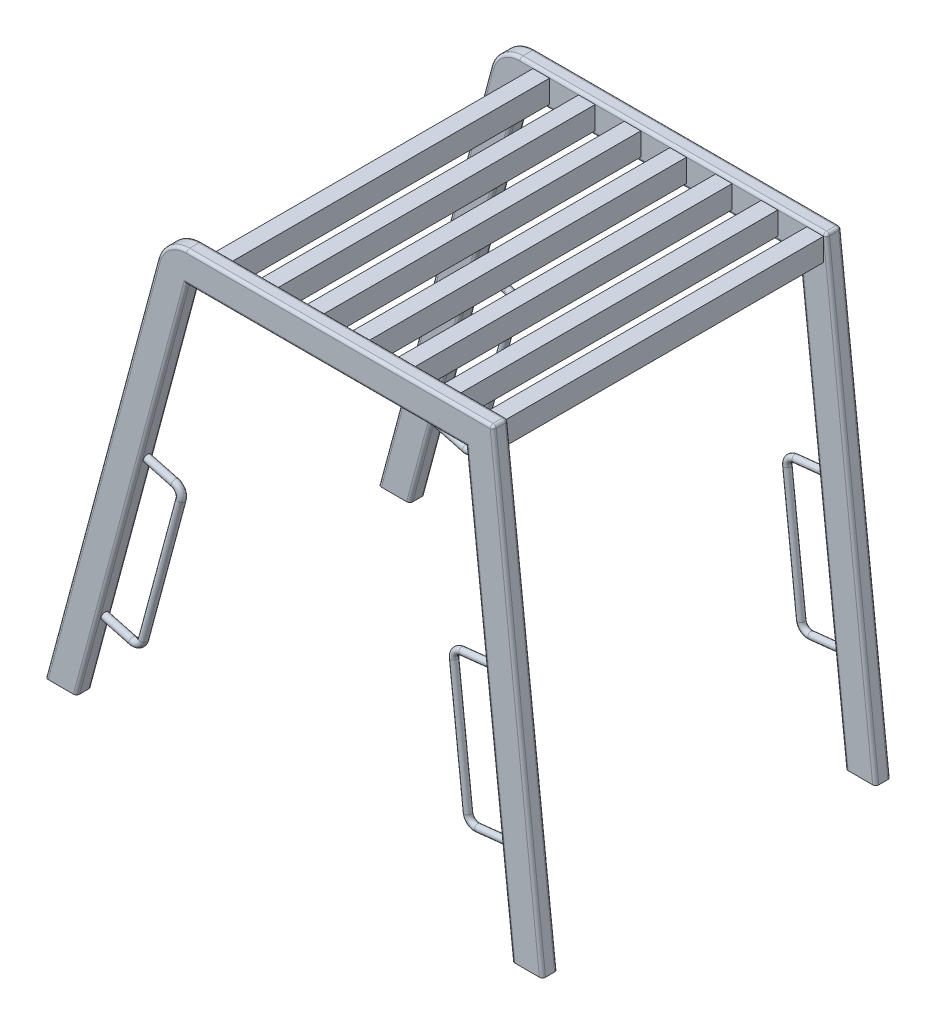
ISO-10303-21;
HEADER;
FILE_DESCRIPTION(('STEP AP214'),'2;1');
FILE_NAME('part.step','',(''),(''),'','','');
FILE_SCHEMA(('AUTOMOTIVE_DESIGN { 1 0 10303 214 1 1 1 1 }'));
ENDSEC;
DATA;
#1=APPLICATION_CONTEXT('core data for automotive mechanical design processes');
#2=APPLICATION_PROTOCOL_DEFINITION('international standard','automotive_design',2000,#1);
#3=PRODUCT_CONTEXT('',#1,'mechanical');
#4=PRODUCT('Part','Part','',(#3));
#5=PRODUCT_RELATED_PRODUCT_CATEGORY('part','',(#4));
#6=PRODUCT_DEFINITION_FORMATION('','',#4);
#7=PRODUCT_DEFINITION_CONTEXT('part definition',#1,'design');
#8=PRODUCT_DEFINITION('design','',#6,#7);
#9=PRODUCT_DEFINITION_SHAPE('','',#8);
#10=(LENGTH_UNIT() NAMED_UNIT(*) SI_UNIT(.MILLI.,.METRE.));
#11=(NAMED_UNIT(*) PLANE_ANGLE_UNIT() SI_UNIT($,.RADIAN.));
#12=(NAMED_UNIT(*) SI_UNIT($,.STERADIAN.) SOLID_ANGLE_UNIT());
#13=UNCERTAINTY_MEASURE_WITH_UNIT(LENGTH_MEASURE(1.E-05),#10,'distance_accuracy_value','');
#14=(GEOMETRIC_REPRESENTATION_CONTEXT(3) GLOBAL_UNCERTAINTY_ASSIGNED_CONTEXT((#13)) GLOBAL_UNIT_ASSIGNED_CONTEXT((#10,
#11,#12)) REPRESENTATION_CONTEXT('',''));
#15=CARTESIAN_POINT('',(0.,0.,0.));
#16=DIRECTION('',(0.,0.,1.));
#17=DIRECTION('',(1.,0.,0.));
#18=AXIS2_PLACEMENT_3D('',#15,#16,#17);
#19=CARTESIAN_POINT('',(0.,0.,1095.));
#20=DIRECTION('',(0.,0.,1.));
#21=DIRECTION('',(1.,0.,0.));
#22=AXIS2_PLACEMENT_3D('',#19,#20,#21);
#23=PLANE('',#22);
#24=DIRECTION('',(0.,-1.,0.));
#25=VECTOR('',#24,1.);
#26=CARTESIAN_POINT('',(508.158700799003,1440.,1095.00000000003));
#27=LINE('',#26,#25);
#28=CARTESIAN_POINT('',(508.158700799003,1440.,1095.));
#29=VERTEX_POINT('',#28);
#30=CARTESIAN_POINT('',(508.158700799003,1365.48196212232,1095.));
#31=VERTEX_POINT('',#30);
#32=EDGE_CURVE('E52',#29,#31,#27,.T.);
#33=ORIENTED_EDGE('',*,*,#32,.T.);
#34=DIRECTION('',(1.,0.,0.));
#35=VECTOR('',#34,1.);
#36=CARTESIAN_POINT('',(508.158700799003,1365.48196212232,1095.00000000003));
#37=LINE('',#36,#35);
#38=CARTESIAN_POINT('',(562.609965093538,1365.48196212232,1095.));
#39=VERTEX_POINT('',#38);
#40=EDGE_CURVE('E56',#31,#39,#37,.T.);
#41=ORIENTED_EDGE('',*,*,#40,.T.);
#42=DIRECTION('',(0.,1.,0.));
#43=VECTOR('',#42,1.);
#44=CARTESIAN_POINT('',(562.609965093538,1440.,1095.00000000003));
#45=LINE('',#44,#43);
#46=CARTESIAN_POINT('',(562.609965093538,1440.,1095.00000000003));
#47=VERTEX_POINT('',#46);
#48=EDGE_CURVE('E454',#39,#47,#45,.T.);
#49=ORIENTED_EDGE('',*,*,#48,.T.);
#50=DIRECTION('',(1.,0.,0.));
#51=VECTOR('',#50,1.);
#52=CARTESIAN_POINT('',(1471.57690072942,1440.,1095.));
#53=LINE('',#52,#51);
#54=CARTESIAN_POINT('',(658.158700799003,1440.,1095.));
#55=VERTEX_POINT('',#54);
#56=EDGE_CURVE('E443',#47,#55,#53,.T.);
#57=ORIENTED_EDGE('',*,*,#56,.T.);
#58=DIRECTION('',(0.,-1.,0.));
#59=VECTOR('',#58,1.);
#60=CARTESIAN_POINT('',(658.158700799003,1440.,1095.00000000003));
#61=LINE('',#60,#59);
#62=CARTESIAN_POINT('',(658.158700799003,1365.48196212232,1095.));
#63=VERTEX_POINT('',#62);
#64=EDGE_CURVE('E518',#55,#63,#61,.T.);
#65=ORIENTED_EDGE('',*,*,#64,.T.);
#66=DIRECTION('',(1.,0.,0.));
#67=VECTOR('',#66,1.);
#68=CARTESIAN_POINT('',(658.158700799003,1365.48196212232,1095.00000000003));
#69=LINE('',#68,#67);
#70=CARTESIAN_POINT('',(712.609965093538,1365.48196212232,1095.));
#71=VERTEX_POINT('',#70);
#72=EDGE_CURVE('E510',#63,#71,#69,.T.);
#73=ORIENTED_EDGE('',*,*,#72,.T.);
#74=DIRECTION('',(0.,1.,0.));
#75=VECTOR('',#74,1.);
#76=CARTESIAN_POINT('',(712.609965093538,1440.,1095.00000000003));
#77=LINE('',#76,#75);
#78=CARTESIAN_POINT('',(712.609965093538,1440.,1095.00000000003));
#79=VERTEX_POINT('',#78);
#80=EDGE_CURVE('E501',#71,#79,#77,.T.);
#81=ORIENTED_EDGE('',*,*,#80,.T.);
#82=CARTESIAN_POINT('',(808.158700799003,1440.,1095.));
#83=VERTEX_POINT('',#82);
#84=EDGE_CURVE('E452',#79,#83,#53,.T.);
#85=ORIENTED_EDGE('',*,*,#84,.T.);
#86=DIRECTION('',(0.,-1.,0.));
#87=VECTOR('',#86,1.);
#88=CARTESIAN_POINT('',(808.158700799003,1440.,1095.00000000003));
#89=LINE('',#88,#87);
#90=CARTESIAN_POINT('',(808.158700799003,1365.48196212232,1095.));
#91=VERTEX_POINT('',#90);
#92=EDGE_CURVE('E552',#83,#91,#89,.T.);
#93=ORIENTED_EDGE('',*,*,#92,.T.);
#94=DIRECTION('',(1.,0.,0.));
#95=VECTOR('',#94,1.);
#96=CARTESIAN_POINT('',(808.158700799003,1365.48196212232,1095.00000000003));
#97=LINE('',#96,#95);
#98=CARTESIAN_POINT('',(862.609965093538,1365.48196212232,1095.));
#99=VERTEX_POINT('',#98);
#100=EDGE_CURVE('E544',#91,#99,#97,.T.);
#101=ORIENTED_EDGE('',*,*,#100,.T.);
#102=DIRECTION('',(0.,1.,0.));
#103=VECTOR('',#102,1.);
#104=CARTESIAN_POINT('',(862.609965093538,1440.,1095.00000000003));
#105=LINE('',#104,#103);
#106=CARTESIAN_POINT('',(862.609965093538,1440.,1095.00000000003));
#107=VERTEX_POINT('',#106);
#108=EDGE_CURVE('E535',#99,#107,#105,.T.);
#109=ORIENTED_EDGE('',*,*,#108,.T.);
#110=CARTESIAN_POINT('',(958.158700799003,1440.,1095.));
#111=VERTEX_POINT('',#110);
#112=EDGE_CURVE('E2044',#107,#111,#53,.T.);
#113=ORIENTED_EDGE('',*,*,#112,.T.);
#114=DIRECTION('',(0.,-1.,0.));
#115=VECTOR('',#114,1.);
#116=CARTESIAN_POINT('',(958.158700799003,1440.,1095.00000000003));
#117=LINE('',#116,#115);
#118=CARTESIAN_POINT('',(958.158700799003,1365.48196212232,1095.));
#119=VERTEX_POINT('',#118);
#120=EDGE_CURVE('E586',#111,#119,#117,.T.);
#121=ORIENTED_EDGE('',*,*,#120,.T.);
#122=DIRECTION('',(1.,0.,0.));
#123=VECTOR('',#122,1.);
#124=CARTESIAN_POINT('',(958.158700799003,1365.48196212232,1095.00000000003));
#125=LINE('',#124,#123);
#126=CARTESIAN_POINT('',(1012.60996509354,1365.48196212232,1095.));
#127=VERTEX_POINT('',#126);
#128=EDGE_CURVE('E578',#119,#127,#125,.T.);
#129=ORIENTED_EDGE('',*,*,#128,.T.);
#130=DIRECTION('',(0.,1.,0.));
#131=VECTOR('',#130,1.);
#132=CARTESIAN_POINT('',(1012.60996509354,1440.,1095.00000000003));
#133=LINE('',#132,#131);
#134=CARTESIAN_POINT('',(1012.60996509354,1440.,1095.00000000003));
#135=VERTEX_POINT('',#134);
#136=EDGE_CURVE('E569',#127,#135,#133,.T.);
#137=ORIENTED_EDGE('',*,*,#136,.T.);
#138=CARTESIAN_POINT('',(1108.158700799,1440.,1095.));
#139=VERTEX_POINT('',#138);
#140=EDGE_CURVE('E2043',#135,#139,#53,.T.);
#141=ORIENTED_EDGE('',*,*,#140,.T.);
#142=DIRECTION('',(0.,-1.,0.));
#143=VECTOR('',#142,1.);
#144=CARTESIAN_POINT('',(1108.158700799,1440.,1095.00000000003));
#145=LINE('',#144,#143);
#146=CARTESIAN_POINT('',(1108.158700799,1365.48196212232,1095.));
#147=VERTEX_POINT('',#146);
#148=EDGE_CURVE('E620',#139,#147,#145,.T.);
#149=ORIENTED_EDGE('',*,*,#148,.T.);
#150=DIRECTION('',(1.,0.,0.));
#151=VECTOR('',#150,1.);
#152=CARTESIAN_POINT('',(1108.158700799,1365.48196212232,1095.00000000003));
#153=LINE('',#152,#151);
#154=CARTESIAN_POINT('',(1162.60996509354,1365.48196212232,1095.));
#155=VERTEX_POINT('',#154);
#156=EDGE_CURVE('E612',#147,#155,#153,.T.);
#157=ORIENTED_EDGE('',*,*,#156,.T.);
#158=DIRECTION('',(0.,1.,0.));
#159=VECTOR('',#158,1.);
#160=CARTESIAN_POINT('',(1162.60996509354,1440.,1095.00000000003));
#161=LINE('',#160,#159);
#162=CARTESIAN_POINT('',(1162.60996509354,1440.,1095.00000000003));
#163=VERTEX_POINT('',#162);
#164=EDGE_CURVE('E603',#155,#163,#161,.T.);
#165=ORIENTED_EDGE('',*,*,#164,.T.);
#166=CARTESIAN_POINT('',(1258.158700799,1440.,1095.));
#167=VERTEX_POINT('',#166);
#168=EDGE_CURVE('E2040',#163,#167,#53,.T.);
#169=ORIENTED_EDGE('',*,*,#168,.T.);
#170=DIRECTION('',(0.,-1.,0.));
#171=VECTOR('',#170,1.);
#172=CARTESIAN_POINT('',(1258.158700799,1440.,1095.00000000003));
#173=LINE('',#172,#171);
#174=CARTESIAN_POINT('',(1258.158700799,1365.48196212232,1095.));
#175=VERTEX_POINT('',#174);
#176=EDGE_CURVE('E654',#167,#175,#173,.T.);
#177=ORIENTED_EDGE('',*,*,#176,.T.);
#178=DIRECTION('',(1.,0.,0.));
#179=VECTOR('',#178,1.);
#180=CARTESIAN_POINT('',(1258.158700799,1365.48196212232,1095.00000000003));
#181=LINE('',#180,#179);
#182=CARTESIAN_POINT('',(1312.60996509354,1365.48196212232,1095.));
#183=VERTEX_POINT('',#182);
#184=EDGE_CURVE('E646',#175,#183,#181,.T.);
#185=ORIENTED_EDGE('',*,*,#184,.T.);
#186=DIRECTION('',(0.,1.,0.));
#187=VECTOR('',#186,1.);
#188=CARTESIAN_POINT('',(1312.60996509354,1440.,1095.00000000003));
#189=LINE('',#188,#187);
#190=CARTESIAN_POINT('',(1312.60996509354,1440.,1095.00000000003));
#191=VERTEX_POINT('',#190);
#192=EDGE_CURVE('E637',#183,#191,#189,.T.);
#193=ORIENTED_EDGE('',*,*,#192,.T.);
#194=CARTESIAN_POINT('',(1408.158700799,1440.,1095.));
#195=VERTEX_POINT('',#194);
#196=EDGE_CURVE('E962',#191,#195,#53,.T.);
#197=ORIENTED_EDGE('',*,*,#196,.T.);
#198=DIRECTION('',(0.,-1.,0.));
#199=VECTOR('',#198,1.);
#200=CARTESIAN_POINT('',(1408.158700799,1440.,1095.00000000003));
#201=LINE('',#200,#199);
#202=CARTESIAN_POINT('',(1408.158700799,1365.48196212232,1095.));
#203=VERTEX_POINT('',#202);
#204=EDGE_CURVE('E870',#195,#203,#201,.T.);
#205=ORIENTED_EDGE('',*,*,#204,.T.);
#206=DIRECTION('',(1.,0.,0.));
#207=VECTOR('',#206,1.);
#208=CARTESIAN_POINT('',(1408.158700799,1365.48196212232,1095.00000000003));
#209=LINE('',#208,#207);
#210=CARTESIAN_POINT('',(1462.60996509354,1365.48196212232,1095.));
#211=VERTEX_POINT('',#210);
#212=EDGE_CURVE('E886',#203,#211,#209,.T.);
#213=ORIENTED_EDGE('',*,*,#212,.T.);
#214=DIRECTION('',(0.,1.,0.));
#215=VECTOR('',#214,1.);
#216=CARTESIAN_POINT('',(1462.60996509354,1440.,1095.00000000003));
#217=LINE('',#216,#215);
#218=CARTESIAN_POINT('',(1462.60996509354,1440.,1095.00000000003));
#219=VERTEX_POINT('',#218);
#220=EDGE_CURVE('E883',#211,#219,#217,.T.);
#221=ORIENTED_EDGE('',*,*,#220,.T.);
#222=DIRECTION('',(0.108610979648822,-0.994084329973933,0.));
#223=VECTOR('',#222,1.);
#224=CARTESIAN_POINT('',(1624.42944909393,-41.0861097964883,1095.));
#225=LINE('',#224,#223);
#226=CARTESIAN_POINT('',(1624.31078365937,-40.,1095.));
#227=VERTEX_POINT('',#226);
#228=EDGE_CURVE('E961',#219,#227,#225,.T.);
#229=ORIENTED_EDGE('',*,*,#228,.T.);
#230=DIRECTION('',(-1.,0.,0.));
#231=VECTOR('',#230,1.);
#232=CARTESIAN_POINT('',(0.,-40.0000000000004,1095.));
#233=LINE('',#232,#231);
#234=CARTESIAN_POINT('',(1543.834713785,-40.,1095.));
#235=VERTEX_POINT('',#234);
#236=EDGE_CURVE('E922',#227,#235,#233,.T.);
#237=ORIENTED_EDGE('',*,*,#236,.T.);
#238=DIRECTION('',(0.10861097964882,-0.994084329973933,0.));
#239=VECTOR('',#238,1.);
#240=CARTESIAN_POINT('',(1521.30436811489,166.213622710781,1095.));
#241=LINE('',#240,#239);
#242=CARTESIAN_POINT('',(1390.87448000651,1360.,1095.));
#243=VERTEX_POINT('',#242);
#244=EDGE_CURVE('E959',#235,#243,#241,.F.);
#245=ORIENTED_EDGE('',*,*,#244,.T.);
#246=DIRECTION('',(1.,0.,0.));
#247=VECTOR('',#246,1.);
#248=CARTESIAN_POINT('',(3.29439973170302E-13,1360.,1095.));
#249=LINE('',#248,#247);
#250=CARTESIAN_POINT('',(457.58575794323,1360.,1095.));
#251=VERTEX_POINT('',#250);
#252=EDGE_CURVE('E955',#243,#251,#249,.F.);
#253=ORIENTED_EDGE('',*,*,#252,.T.);
#254=DIRECTION('',(0.258819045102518,0.965925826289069,0.));
#255=VECTOR('',#254,1.);
#256=CARTESIAN_POINT('',(86.9333243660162,-23.2937140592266,1095.));
#257=LINE('',#256,#255);
#258=CARTESIAN_POINT('',(93.1748562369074,0.,1095.));
#259=VERTEX_POINT('',#258);
#260=EDGE_CURVE('E957',#251,#259,#257,.F.);
#261=ORIENTED_EDGE('',*,*,#260,.T.);
#262=DIRECTION('',(1.,0.,0.));
#263=VECTOR('',#262,1.);
#264=CARTESIAN_POINT('',(0.,0.,1095.));
#265=LINE('',#264,#263);
#266=CARTESIAN_POINT('',(10.3527618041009,0.,1095.));
#267=VERTEX_POINT('',#266);
#268=EDGE_CURVE('E926',#267,#259,#265,.T.);
#269=ORIENTED_EDGE('',*,*,#268,.F.);
#270=DIRECTION('',(0.258819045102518,0.965925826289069,0.));
#271=VECTOR('',#270,1.);
#272=CARTESIAN_POINT('',(378.325703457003,1373.29371405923,1095.));
#273=LINE('',#272,#271);
#274=CARTESIAN_POINT('',(378.325703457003,1373.29371405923,1095.));
#275=VERTEX_POINT('',#274);
#276=EDGE_CURVE('E966',#267,#275,#273,.T.);
#277=ORIENTED_EDGE('',*,*,#276,.T.);
#278=CARTESIAN_POINT('',(465.259027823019,1350.,1095.));
#279=DIRECTION('',(0.,0.,1.));
#280=DIRECTION('',(1.,0.,0.));
#281=AXIS2_PLACEMENT_3D('',#278,#279,#280);
#282=CIRCLE('',#281,90.0000000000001);
#283=CARTESIAN_POINT('',(465.259027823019,1440.,1095.));
#284=VERTEX_POINT('',#283);
#285=EDGE_CURVE('E964',#275,#284,#282,.F.);
#286=ORIENTED_EDGE('',*,*,#285,.T.);
#287=EDGE_CURVE('E451',#284,#29,#53,.T.);
#288=ORIENTED_EDGE('',*,*,#287,.T.);
#289=EDGE_LOOP('',(#33,#41,#49,#57,#65,#73,#81,#85,#93,#101,#109,#113,#121,#129,#137,#141,#149,
#157,#165,#169,#177,#185,#193,#197,#205,#213,#221,#229,#237,#245,#253,#261,#269,#277,#286,#288));
#290=FACE_BOUND('',#289,.T.);
#291=ADVANCED_FACE('F35',(#290),#23,.F.);
#292=CARTESIAN_POINT('',(0.,0.,50.));
#293=DIRECTION('',(0.,0.,1.));
#294=DIRECTION('',(1.,0.,0.));
#295=AXIS2_PLACEMENT_3D('',#292,#293,#294);
#296=PLANE('',#295);
#297=DIRECTION('',(1.,0.,0.));
#298=VECTOR('',#297,1.);
#299=CARTESIAN_POINT('',(508.158700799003,1365.48196212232,50.));
#300=LINE('',#299,#298);
#301=CARTESIAN_POINT('',(508.158700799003,1365.48196212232,50.));
#302=VERTEX_POINT('',#301);
#303=CARTESIAN_POINT('',(562.609965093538,1365.48196212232,50.));
#304=VERTEX_POINT('',#303);
#305=EDGE_CURVE('E484',#302,#304,#300,.T.);
#306=ORIENTED_EDGE('',*,*,#305,.F.);
#307=DIRECTION('',(0.,-1.,0.));
#308=VECTOR('',#307,1.);
#309=CARTESIAN_POINT('',(508.158700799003,1440.,50.));
#310=LINE('',#309,#308);
#311=CARTESIAN_POINT('',(508.158700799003,1440.,50.));
#312=VERTEX_POINT('',#311);
#313=EDGE_CURVE('E488',#312,#302,#310,.T.);
#314=ORIENTED_EDGE('',*,*,#313,.F.);
#315=DIRECTION('',(1.,0.,0.));
#316=VECTOR('',#315,1.);
#317=CARTESIAN_POINT('',(0.,1440.,50.));
#318=LINE('',#317,#316);
#319=CARTESIAN_POINT('',(465.259027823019,1440.,50.));
#320=VERTEX_POINT('',#319);
#321=EDGE_CURVE('E768',#312,#320,#318,.F.);
#322=ORIENTED_EDGE('',*,*,#321,.T.);
#323=CARTESIAN_POINT('',(465.259027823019,1350.,50.));
#324=DIRECTION('',(0.,0.,1.));
#325=DIRECTION('',(1.,0.,0.));
#326=AXIS2_PLACEMENT_3D('',#323,#324,#325);
#327=CIRCLE('',#326,90.0000000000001);
#328=CARTESIAN_POINT('',(378.325703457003,1373.29371405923,50.));
#329=VERTEX_POINT('',#328);
#330=EDGE_CURVE('E772',#320,#329,#327,.T.);
#331=ORIENTED_EDGE('',*,*,#330,.T.);
#332=DIRECTION('',(0.258819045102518,0.965925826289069,0.));
#333=VECTOR('',#332,1.);
#334=CARTESIAN_POINT('',(9.65925826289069,-2.58819045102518,50.));
#335=LINE('',#334,#333);
#336=CARTESIAN_POINT('',(10.3527618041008,0.,50.));
#337=VERTEX_POINT('',#336);
#338=EDGE_CURVE('E775',#329,#337,#335,.F.);
#339=ORIENTED_EDGE('',*,*,#338,.T.);
#340=DIRECTION('',(1.,0.,0.));
#341=VECTOR('',#340,1.);
#342=CARTESIAN_POINT('',(0.,0.,50.));
#343=LINE('',#342,#341);
#344=CARTESIAN_POINT('',(93.1748562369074,0.,50.));
#345=VERTEX_POINT('',#344);
#346=EDGE_CURVE('E695',#337,#345,#343,.T.);
#347=ORIENTED_EDGE('',*,*,#346,.T.);
#348=DIRECTION('',(0.258819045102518,0.965925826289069,0.));
#349=VECTOR('',#348,1.);
#350=CARTESIAN_POINT('',(455.599769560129,1352.58819045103,50.));
#351=LINE('',#350,#349);
#352=CARTESIAN_POINT('',(457.58575794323,1360.,50.));
#353=VERTEX_POINT('',#352);
#354=EDGE_CURVE('E759',#345,#353,#351,.T.);
#355=ORIENTED_EDGE('',*,*,#354,.T.);
#356=DIRECTION('',(1.,0.,0.));
#357=VECTOR('',#356,1.);
#358=CARTESIAN_POINT('',(1381.90754437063,1360.,50.));
#359=LINE('',#358,#357);
#360=CARTESIAN_POINT('',(1390.87448000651,1360.,50.));
#361=VERTEX_POINT('',#360);
#362=EDGE_CURVE('E761',#353,#361,#359,.T.);
#363=ORIENTED_EDGE('',*,*,#362,.T.);
#364=DIRECTION('',(0.10861097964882,-0.994084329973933,0.));
#365=VECTOR('',#364,1.);
#366=CARTESIAN_POINT('',(1543.71604835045,-38.9138902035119,50.));
#367=LINE('',#366,#365);
#368=CARTESIAN_POINT('',(1543.834713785,-40.,50.));
#369=VERTEX_POINT('',#368);
#370=EDGE_CURVE('E763',#361,#369,#367,.T.);
#371=ORIENTED_EDGE('',*,*,#370,.T.);
#372=DIRECTION('',(-1.,0.,0.));
#373=VECTOR('',#372,1.);
#374=CARTESIAN_POINT('',(0.,-40.0000000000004,50.));
#375=LINE('',#374,#373);
#376=CARTESIAN_POINT('',(1624.31078365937,-40.,50.));
#377=VERTEX_POINT('',#376);
#378=EDGE_CURVE('E698',#377,#369,#375,.T.);
#379=ORIENTED_EDGE('',*,*,#378,.F.);
#380=DIRECTION('',(0.108610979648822,-0.994084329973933,0.));
#381=VECTOR('',#380,1.);
#382=CARTESIAN_POINT('',(1600.83111451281,174.90250108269,50.));
#383=LINE('',#382,#381);
#384=CARTESIAN_POINT('',(1462.60996509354,1440.,50.));
#385=VERTEX_POINT('',#384);
#386=EDGE_CURVE('E766',#377,#385,#383,.F.);
#387=ORIENTED_EDGE('',*,*,#386,.T.);
#388=DIRECTION('',(0.,1.,0.));
#389=VECTOR('',#388,1.);
#390=CARTESIAN_POINT('',(1462.60996509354,1440.,50.));
#391=LINE('',#390,#389);
#392=CARTESIAN_POINT('',(1462.60996509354,1365.48196212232,50.0000000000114));
#393=VERTEX_POINT('',#392);
#394=EDGE_CURVE('E858',#393,#385,#391,.T.);
#395=ORIENTED_EDGE('',*,*,#394,.F.);
#396=DIRECTION('',(1.,0.,0.));
#397=VECTOR('',#396,1.);
#398=CARTESIAN_POINT('',(1408.158700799,1365.48196212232,50.));
#399=LINE('',#398,#397);
#400=CARTESIAN_POINT('',(1408.158700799,1365.48196212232,50.0000000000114));
#401=VERTEX_POINT('',#400);
#402=EDGE_CURVE('E855',#401,#393,#399,.T.);
#403=ORIENTED_EDGE('',*,*,#402,.F.);
#404=DIRECTION('',(0.,-1.,0.));
#405=VECTOR('',#404,1.);
#406=CARTESIAN_POINT('',(1408.158700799,1440.,50.));
#407=LINE('',#406,#405);
#408=CARTESIAN_POINT('',(1408.158700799,1440.,50.));
#409=VERTEX_POINT('',#408);
#410=EDGE_CURVE('E666',#409,#401,#407,.T.);
#411=ORIENTED_EDGE('',*,*,#410,.F.);
#412=CARTESIAN_POINT('',(1312.60996509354,1440.,50.));
#413=VERTEX_POINT('',#412);
#414=EDGE_CURVE('E769',#409,#413,#318,.F.);
#415=ORIENTED_EDGE('',*,*,#414,.T.);
#416=DIRECTION('',(0.,1.,0.));
#417=VECTOR('',#416,1.);
#418=CARTESIAN_POINT('',(1312.60996509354,1440.,50.));
#419=LINE('',#418,#417);
#420=CARTESIAN_POINT('',(1312.60996509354,1365.48196212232,50.));
#421=VERTEX_POINT('',#420);
#422=EDGE_CURVE('E643',#421,#413,#419,.T.);
#423=ORIENTED_EDGE('',*,*,#422,.F.);
#424=DIRECTION('',(1.,0.,0.));
#425=VECTOR('',#424,1.);
#426=CARTESIAN_POINT('',(1258.158700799,1365.48196212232,50.));
#427=LINE('',#426,#425);
#428=CARTESIAN_POINT('',(1258.158700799,1365.48196212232,50.));
#429=VERTEX_POINT('',#428);
#430=EDGE_CURVE('E651',#429,#421,#427,.T.);
#431=ORIENTED_EDGE('',*,*,#430,.F.);
#432=DIRECTION('',(0.,-1.,0.));
#433=VECTOR('',#432,1.);
#434=CARTESIAN_POINT('',(1258.158700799,1440.,50.));
#435=LINE('',#434,#433);
#436=CARTESIAN_POINT('',(1258.158700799,1440.,50.));
#437=VERTEX_POINT('',#436);
#438=EDGE_CURVE('E656',#437,#429,#435,.T.);
#439=ORIENTED_EDGE('',*,*,#438,.F.);
#440=CARTESIAN_POINT('',(1162.60996509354,1440.,50.));
#441=VERTEX_POINT('',#440);
#442=EDGE_CURVE('E773',#437,#441,#318,.F.);
#443=ORIENTED_EDGE('',*,*,#442,.T.);
#444=DIRECTION('',(0.,1.,0.));
#445=VECTOR('',#444,1.);
#446=CARTESIAN_POINT('',(1162.60996509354,1440.,50.));
#447=LINE('',#446,#445);
#448=CARTESIAN_POINT('',(1162.60996509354,1365.48196212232,50.));
#449=VERTEX_POINT('',#448);
#450=EDGE_CURVE('E609',#449,#441,#447,.T.);
#451=ORIENTED_EDGE('',*,*,#450,.F.);
#452=DIRECTION('',(1.,0.,0.));
#453=VECTOR('',#452,1.);
#454=CARTESIAN_POINT('',(1108.158700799,1365.48196212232,50.));
#455=LINE('',#454,#453);
#456=CARTESIAN_POINT('',(1108.158700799,1365.48196212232,50.));
#457=VERTEX_POINT('',#456);
#458=EDGE_CURVE('E617',#457,#449,#455,.T.);
#459=ORIENTED_EDGE('',*,*,#458,.F.);
#460=DIRECTION('',(0.,-1.,0.));
#461=VECTOR('',#460,1.);
#462=CARTESIAN_POINT('',(1108.158700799,1440.,50.));
#463=LINE('',#462,#461);
#464=CARTESIAN_POINT('',(1108.158700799,1440.,50.));
#465=VERTEX_POINT('',#464);
#466=EDGE_CURVE('E622',#465,#457,#463,.T.);
#467=ORIENTED_EDGE('',*,*,#466,.F.);
#468=CARTESIAN_POINT('',(1012.60996509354,1440.,50.));
#469=VERTEX_POINT('',#468);
#470=EDGE_CURVE('E2066',#465,#469,#318,.F.);
#471=ORIENTED_EDGE('',*,*,#470,.T.);
#472=DIRECTION('',(0.,1.,0.));
#473=VECTOR('',#472,1.);
#474=CARTESIAN_POINT('',(1012.60996509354,1440.,50.));
#475=LINE('',#474,#473);
#476=CARTESIAN_POINT('',(1012.60996509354,1365.48196212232,50.));
#477=VERTEX_POINT('',#476);
#478=EDGE_CURVE('E575',#477,#469,#475,.T.);
#479=ORIENTED_EDGE('',*,*,#478,.F.);
#480=DIRECTION('',(1.,0.,0.));
#481=VECTOR('',#480,1.);
#482=CARTESIAN_POINT('',(958.158700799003,1365.48196212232,50.));
#483=LINE('',#482,#481);
#484=CARTESIAN_POINT('',(958.158700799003,1365.48196212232,50.));
#485=VERTEX_POINT('',#484);
#486=EDGE_CURVE('E583',#485,#477,#483,.T.);
#487=ORIENTED_EDGE('',*,*,#486,.F.);
#488=DIRECTION('',(0.,-1.,0.));
#489=VECTOR('',#488,1.);
#490=CARTESIAN_POINT('',(958.158700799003,1440.,50.));
#491=LINE('',#490,#489);
#492=CARTESIAN_POINT('',(958.158700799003,1440.,50.));
#493=VERTEX_POINT('',#492);
#494=EDGE_CURVE('E588',#493,#485,#491,.T.);
#495=ORIENTED_EDGE('',*,*,#494,.F.);
#496=CARTESIAN_POINT('',(862.609965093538,1440.,50.));
#497=VERTEX_POINT('',#496);
#498=EDGE_CURVE('E2065',#493,#497,#318,.F.);
#499=ORIENTED_EDGE('',*,*,#498,.T.);
#500=DIRECTION('',(0.,1.,0.));
#501=VECTOR('',#500,1.);
#502=CARTESIAN_POINT('',(862.609965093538,1440.,50.));
#503=LINE('',#502,#501);
#504=CARTESIAN_POINT('',(862.609965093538,1365.48196212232,50.));
#505=VERTEX_POINT('',#504);
#506=EDGE_CURVE('E541',#505,#497,#503,.T.);
#507=ORIENTED_EDGE('',*,*,#506,.F.);
#508=DIRECTION('',(1.,0.,0.));
#509=VECTOR('',#508,1.);
#510=CARTESIAN_POINT('',(808.158700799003,1365.48196212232,50.));
#511=LINE('',#510,#509);
#512=CARTESIAN_POINT('',(808.158700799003,1365.48196212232,50.));
#513=VERTEX_POINT('',#512);
#514=EDGE_CURVE('E549',#513,#505,#511,.T.);
#515=ORIENTED_EDGE('',*,*,#514,.F.);
#516=DIRECTION('',(0.,-1.,0.));
#517=VECTOR('',#516,1.);
#518=CARTESIAN_POINT('',(808.158700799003,1440.,50.));
#519=LINE('',#518,#517);
#520=CARTESIAN_POINT('',(808.158700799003,1440.,50.));
#521=VERTEX_POINT('',#520);
#522=EDGE_CURVE('E554',#521,#513,#519,.T.);
#523=ORIENTED_EDGE('',*,*,#522,.F.);
#524=CARTESIAN_POINT('',(712.609965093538,1440.,50.));
#525=VERTEX_POINT('',#524);
#526=EDGE_CURVE('E2067',#521,#525,#318,.F.);
#527=ORIENTED_EDGE('',*,*,#526,.T.);
#528=DIRECTION('',(0.,1.,0.));
#529=VECTOR('',#528,1.);
#530=CARTESIAN_POINT('',(712.609965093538,1440.,50.));
#531=LINE('',#530,#529);
#532=CARTESIAN_POINT('',(712.609965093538,1365.48196212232,50.));
#533=VERTEX_POINT('',#532);
#534=EDGE_CURVE('E507',#533,#525,#531,.T.);
#535=ORIENTED_EDGE('',*,*,#534,.F.);
#536=DIRECTION('',(1.,0.,0.));
#537=VECTOR('',#536,1.);
#538=CARTESIAN_POINT('',(658.158700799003,1365.48196212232,50.));
#539=LINE('',#538,#537);
#540=CARTESIAN_POINT('',(658.158700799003,1365.48196212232,50.));
#541=VERTEX_POINT('',#540);
#542=EDGE_CURVE('E515',#541,#533,#539,.T.);
#543=ORIENTED_EDGE('',*,*,#542,.F.);
#544=DIRECTION('',(0.,-1.,0.));
#545=VECTOR('',#544,1.);
#546=CARTESIAN_POINT('',(658.158700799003,1440.,50.));
#547=LINE('',#546,#545);
#548=CARTESIAN_POINT('',(658.158700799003,1440.,50.));
#549=VERTEX_POINT('',#548);
#550=EDGE_CURVE('E520',#549,#541,#547,.T.);
#551=ORIENTED_EDGE('',*,*,#550,.F.);
#552=CARTESIAN_POINT('',(562.609965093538,1440.,50.));
#553=VERTEX_POINT('',#552);
#554=EDGE_CURVE('E2070',#549,#553,#318,.F.);
#555=ORIENTED_EDGE('',*,*,#554,.T.);
#556=DIRECTION('',(0.,1.,0.));
#557=VECTOR('',#556,1.);
#558=CARTESIAN_POINT('',(562.609965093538,1440.,50.));
#559=LINE('',#558,#557);
#560=EDGE_CURVE('E473',#304,#553,#559,.T.);
#561=ORIENTED_EDGE('',*,*,#560,.F.);
#562=EDGE_LOOP('',(#306,#314,#322,#331,#339,#347,#355,#363,#371,#379,#387,#395,#403,#411,#415,
#423,#431,#439,#443,#451,#459,#467,#471,#479,#487,#495,#499,#507,#515,#523,#527,#535,#543,#551,
#555,#561));
#563=FACE_BOUND('',#562,.T.);
#564=ADVANCED_FACE('F1141',(#563),#296,.T.);
#565=CARTESIAN_POINT('',(1511.36352481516,165.127512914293,1145.));
#566=DIRECTION('',(0.994084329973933,0.10861097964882,0.));
#567=DIRECTION('',(-0.10861097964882,0.994084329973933,0.));
#568=AXIS2_PLACEMENT_3D('',#565,#566,#567);
#569=PLANE('',#568);
#570=DIRECTION('',(0.,0.,-1.));
#571=VECTOR('',#570,1.);
#572=CARTESIAN_POINT('',(1533.77520505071,-40.,1145.));
#573=LINE('',#572,#571);
#574=CARTESIAN_POINT('',(1533.77520505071,-40.,1135.));
#575=VERTEX_POINT('',#574);
#576=CARTESIAN_POINT('',(1533.77520505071,-40.,1105.));
#577=VERTEX_POINT('',#576);
#578=EDGE_CURVE('E937',#575,#577,#573,.T.);
#579=ORIENTED_EDGE('',*,*,#578,.F.);
#580=DIRECTION('',(0.10861097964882,-0.994084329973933,0.));
#581=VECTOR('',#580,1.);
#582=CARTESIAN_POINT('',(1381.90754437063,1350.,1135.));
#583=LINE('',#582,#581);
#584=CARTESIAN_POINT('',(1381.90754437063,1350.,1135.));
#585=VERTEX_POINT('',#584);
#586=EDGE_CURVE('E1023',#575,#585,#583,.F.);
#587=ORIENTED_EDGE('',*,*,#586,.T.);
#588=DIRECTION('',(0.,0.,-1.));
#589=VECTOR('',#588,1.);
#590=CARTESIAN_POINT('',(1381.90754437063,1350.,1145.));
#591=LINE('',#590,#589);
#592=CARTESIAN_POINT('',(1381.90754437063,1350.,1105.));
#593=VERTEX_POINT('',#592);
#594=EDGE_CURVE('E940',#585,#593,#591,.T.);
#595=ORIENTED_EDGE('',*,*,#594,.T.);
#596=DIRECTION('',(0.10861097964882,-0.994084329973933,0.));
#597=VECTOR('',#596,1.);
#598=CARTESIAN_POINT('',(1511.36352481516,165.127512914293,1105.));
#599=LINE('',#598,#597);
#600=EDGE_CURVE('E1020',#593,#577,#599,.T.);
#601=ORIENTED_EDGE('',*,*,#600,.T.);
#602=EDGE_LOOP('',(#579,#587,#595,#601));
#603=FACE_BOUND('',#602,.T.);
#604=CARTESIAN_POINT('',(1447.64292618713,748.343397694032,1120.));
#605=DIRECTION('',(-0.994084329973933,-0.10861097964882,0.));
#606=DIRECTION('',(0.10861097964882,-0.994084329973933,0.));
#607=AXIS2_PLACEMENT_3D('',#604,#605,#606);
#608=CIRCLE('',#607,11.);
#609=CARTESIAN_POINT('',(1448.83764696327,737.408470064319,1120.));
#610=VERTEX_POINT('',#609);
#611=EDGE_CURVE('E11',#610,#610,#608,.T.);
#612=ORIENTED_EDGE('',*,*,#611,.F.);
#613=EDGE_LOOP('',(#612));
#614=FACE_BOUND('',#613,.T.);
#615=ADVANCED_FACE('F1270',(#603,#614),#569,.F.);
#616=CARTESIAN_POINT('',(96.5925826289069,-25.8819045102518,1145.));
#617=DIRECTION('',(-0.965925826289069,0.258819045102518,0.));
#618=DIRECTION('',(-0.258819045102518,-0.965925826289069,0.));
#619=AXIS2_PLACEMENT_3D('',#616,#617,#618);
#620=PLANE('',#619);
#621=DIRECTION('',(0.,0.,-1.));
#622=VECTOR('',#621,1.);
#623=CARTESIAN_POINT('',(103.527618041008,0.,1145.));
#624=LINE('',#623,#622);
#625=CARTESIAN_POINT('',(103.527618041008,0.,1135.));
#626=VERTEX_POINT('',#625);
#627=CARTESIAN_POINT('',(103.527618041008,0.,1105.));
#628=VERTEX_POINT('',#627);
#629=EDGE_CURVE('E946',#626,#628,#624,.T.);
#630=ORIENTED_EDGE('',*,*,#629,.T.);
#631=DIRECTION('',(0.258819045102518,0.965925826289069,0.));
#632=VECTOR('',#631,1.);
#633=CARTESIAN_POINT('',(96.5925826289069,-25.8819045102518,1105.));
#634=LINE('',#633,#632);
#635=CARTESIAN_POINT('',(465.259027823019,1350.,1105.));
#636=VERTEX_POINT('',#635);
#637=EDGE_CURVE('E1027',#628,#636,#634,.T.);
#638=ORIENTED_EDGE('',*,*,#637,.T.);
#639=DIRECTION('',(0.,0.,-1.));
#640=VECTOR('',#639,1.);
#641=CARTESIAN_POINT('',(465.259027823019,1350.,1145.));
#642=LINE('',#641,#640);
#643=CARTESIAN_POINT('',(465.259027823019,1350.,1135.));
#644=VERTEX_POINT('',#643);
#645=EDGE_CURVE('E943',#644,#636,#642,.T.);
#646=ORIENTED_EDGE('',*,*,#645,.F.);
#647=DIRECTION('',(0.258819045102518,0.965925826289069,0.));
#648=VECTOR('',#647,1.);
#649=CARTESIAN_POINT('',(103.527618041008,0.,1135.));
#650=LINE('',#649,#648);
#651=EDGE_CURVE('E1025',#644,#626,#650,.F.);
#652=ORIENTED_EDGE('',*,*,#651,.T.);
#653=EDGE_LOOP('',(#630,#638,#646,#652));
#654=FACE_BOUND('',#653,.T.);
#655=CARTESIAN_POINT('',(309.484518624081,768.641617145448,1120.));
#656=DIRECTION('',(-0.965925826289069,0.258819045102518,0.));
#657=DIRECTION('',(-0.258819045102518,-0.965925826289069,0.));
#658=AXIS2_PLACEMENT_3D('',#655,#656,#657);
#659=CIRCLE('',#658,12.);
#660=CARTESIAN_POINT('',(306.37869008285,757.050507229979,1120.));
#661=VERTEX_POINT('',#660);
#662=EDGE_CURVE('E39',#661,#661,#659,.T.);
#663=ORIENTED_EDGE('',*,*,#662,.T.);
#664=EDGE_LOOP('',(#663));
#665=FACE_BOUND('',#664,.T.);
#666=CARTESIAN_POINT('',(170.670209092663,250.579561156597,1120.));
#667=DIRECTION('',(0.965925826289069,-0.258819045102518,0.));
#668=DIRECTION('',(0.258819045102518,0.965925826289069,0.));
#669=AXIS2_PLACEMENT_3D('',#666,#667,#668);
#670=CIRCLE('',#669,12.);
#671=CARTESIAN_POINT('',(173.776037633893,262.170671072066,1120.));
#672=VERTEX_POINT('',#671);
#673=EDGE_CURVE('E44',#672,#672,#670,.T.);
#674=ORIENTED_EDGE('',*,*,#673,.F.);
#675=EDGE_LOOP('',(#674));
#676=FACE_BOUND('',#675,.T.);
#677=ADVANCED_FACE('F1289',(#654,#665,#676),#620,.F.);
#678=CARTESIAN_POINT('',(465.259027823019,1350.,1145.));
#679=DIRECTION('',(0.,0.,-1.));
#680=DIRECTION('',(-1.,0.,0.));
#681=AXIS2_PLACEMENT_3D('',#678,#679,#680);
#682=CYLINDRICAL_SURFACE('',#681,100.);
#683=DIRECTION('',(0.,0.,-1.));
#684=VECTOR('',#683,1.);
#685=CARTESIAN_POINT('',(465.259027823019,1450.,1145.));
#686=LINE('',#685,#684);
#687=CARTESIAN_POINT('',(465.259027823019,1450.,1135.));
#688=VERTEX_POINT('',#687);
#689=CARTESIAN_POINT('',(465.259027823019,1450.,1105.));
#690=VERTEX_POINT('',#689);
#691=EDGE_CURVE('E925',#688,#690,#686,.T.);
#692=ORIENTED_EDGE('',*,*,#691,.T.);
#693=CARTESIAN_POINT('',(465.259027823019,1350.,1105.));
#694=DIRECTION('',(0.,0.,1.));
#695=DIRECTION('',(1.,0.,0.));
#696=AXIS2_PLACEMENT_3D('',#693,#694,#695);
#697=CIRCLE('',#696,100.);
#698=CARTESIAN_POINT('',(368.666445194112,1375.88190451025,1105.));
#699=VERTEX_POINT('',#698);
#700=EDGE_CURVE('E998',#690,#699,#697,.T.);
#701=ORIENTED_EDGE('',*,*,#700,.T.);
#702=DIRECTION('',(0.,0.,-1.));
#703=VECTOR('',#702,1.);
#704=CARTESIAN_POINT('',(368.666445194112,1375.88190451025,1145.));
#705=LINE('',#704,#703);
#706=CARTESIAN_POINT('',(368.666445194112,1375.88190451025,1135.));
#707=VERTEX_POINT('',#706);
#708=EDGE_CURVE('E952',#707,#699,#705,.T.);
#709=ORIENTED_EDGE('',*,*,#708,.F.);
#710=CARTESIAN_POINT('',(465.259027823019,1350.,1135.));
#711=DIRECTION('',(0.,0.,1.));
#712=DIRECTION('',(1.,0.,0.));
#713=AXIS2_PLACEMENT_3D('',#710,#711,#712);
#714=CIRCLE('',#713,100.);
#715=EDGE_CURVE('E996',#707,#688,#714,.F.);
#716=ORIENTED_EDGE('',*,*,#715,.T.);
#717=EDGE_LOOP('',(#692,#701,#709,#716));
#718=FACE_BOUND('',#717,.T.);
#719=ADVANCED_FACE('F1098',(#718),#682,.T.);
#720=CARTESIAN_POINT('',(0.,0.,1145.));
#721=DIRECTION('',(-0.965925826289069,0.258819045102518,0.));
#722=DIRECTION('',(-0.258819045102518,-0.965925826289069,0.));
#723=AXIS2_PLACEMENT_3D('',#720,#721,#722);
#724=PLANE('',#723);
#725=ORIENTED_EDGE('',*,*,#708,.T.);
#726=DIRECTION('',(0.258819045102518,0.965925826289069,0.));
#727=VECTOR('',#726,1.);
#728=CARTESIAN_POINT('',(0.,0.,1105.));
#729=LINE('',#728,#727);
#730=CARTESIAN_POINT('',(0.,0.,1105.));
#731=VERTEX_POINT('',#730);
#732=EDGE_CURVE('E971',#699,#731,#729,.F.);
#733=ORIENTED_EDGE('',*,*,#732,.T.);
#734=DIRECTION('',(0.,0.,-1.));
#735=VECTOR('',#734,1.);
#736=CARTESIAN_POINT('',(0.,0.,1145.));
#737=LINE('',#736,#735);
#738=CARTESIAN_POINT('',(0.,0.,1135.));
#739=VERTEX_POINT('',#738);
#740=EDGE_CURVE('E949',#739,#731,#737,.T.);
#741=ORIENTED_EDGE('',*,*,#740,.F.);
#742=DIRECTION('',(0.258819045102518,0.965925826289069,0.));
#743=VECTOR('',#742,1.);
#744=CARTESIAN_POINT('',(0.,0.,1135.));
#745=LINE('',#744,#743);
#746=EDGE_CURVE('E969',#739,#707,#745,.T.);
#747=ORIENTED_EDGE('',*,*,#746,.T.);
#748=EDGE_LOOP('',(#725,#733,#741,#747));
#749=FACE_BOUND('',#748,.T.);
#750=ADVANCED_FACE('F1102',(#749),#724,.T.);
#751=CARTESIAN_POINT('',(0.,0.,1145.));
#752=DIRECTION('',(0.,1.,0.));
#753=DIRECTION('',(0.,0.,1.));
#754=AXIS2_PLACEMENT_3D('',#751,#752,#753);
#755=PLANE('',#754);
#756=ORIENTED_EDGE('',*,*,#740,.T.);
#757=CARTESIAN_POINT('',(10.3527618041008,0.,1105.));
#758=DIRECTION('',(0.,1.,0.));
#759=DIRECTION('',(-1.,0.,0.));
#760=AXIS2_PLACEMENT_3D('',#757,#758,#759);
#761=ELLIPSE('',#760,10.3527618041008,10.);
#762=EDGE_CURVE('E979',#731,#267,#761,.F.);
#763=ORIENTED_EDGE('',*,*,#762,.T.);
#764=ORIENTED_EDGE('',*,*,#268,.T.);
#765=CARTESIAN_POINT('',(93.1748562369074,0.,1105.));
#766=DIRECTION('',(0.,1.,0.));
#767=DIRECTION('',(1.,0.,0.));
#768=AXIS2_PLACEMENT_3D('',#765,#766,#767);
#769=ELLIPSE('',#768,10.3527618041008,10.);
#770=EDGE_CURVE('E975',#259,#628,#769,.F.);
#771=ORIENTED_EDGE('',*,*,#770,.T.);
#772=ORIENTED_EDGE('',*,*,#629,.F.);
#773=CARTESIAN_POINT('',(93.1748562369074,0.,1135.));
#774=DIRECTION('',(0.,1.,0.));
#775=DIRECTION('',(-1.,0.,0.));
#776=AXIS2_PLACEMENT_3D('',#773,#774,#775);
#777=ELLIPSE('',#776,10.3527618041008,10.);
#778=CARTESIAN_POINT('',(93.1748562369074,0.,1145.));
#779=VERTEX_POINT('',#778);
#780=EDGE_CURVE('E973',#626,#779,#777,.F.);
#781=ORIENTED_EDGE('',*,*,#780,.T.);
#782=DIRECTION('',(1.,0.,0.));
#783=VECTOR('',#782,1.);
#784=CARTESIAN_POINT('',(0.,0.,1145.));
#785=LINE('',#784,#783);
#786=CARTESIAN_POINT('',(10.3527618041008,0.,1145.));
#787=VERTEX_POINT('',#786);
#788=EDGE_CURVE('E918',#787,#779,#785,.T.);
#789=ORIENTED_EDGE('',*,*,#788,.F.);
#790=CARTESIAN_POINT('',(10.3527618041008,0.,1135.));
#791=DIRECTION('',(0.,1.,0.));
#792=DIRECTION('',(1.,0.,0.));
#793=AXIS2_PLACEMENT_3D('',#790,#791,#792);
#794=ELLIPSE('',#793,10.3527618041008,10.);
#795=EDGE_CURVE('E977',#787,#739,#794,.F.);
#796=ORIENTED_EDGE('',*,*,#795,.T.);
#797=EDGE_LOOP('',(#756,#763,#764,#771,#772,#781,#789,#796));
#798=FACE_BOUND('',#797,.T.);
#799=ADVANCED_FACE('F1082',(#798),#755,.F.);
#800=CARTESIAN_POINT('',(3.27017620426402E-13,1350.,1145.));
#801=DIRECTION('',(0.,1.,0.));
#802=DIRECTION('',(-1.,0.,0.));
#803=AXIS2_PLACEMENT_3D('',#800,#801,#802);
#804=PLANE('',#803);
#805=ORIENTED_EDGE('',*,*,#645,.T.);
#806=DIRECTION('',(1.,0.,0.));
#807=VECTOR('',#806,1.);
#808=CARTESIAN_POINT('',(3.27017620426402E-13,1350.,1105.));
#809=LINE('',#808,#807);
#810=EDGE_CURVE('E909',#636,#593,#809,.T.);
#811=ORIENTED_EDGE('',*,*,#810,.T.);
#812=ORIENTED_EDGE('',*,*,#594,.F.);
#813=DIRECTION('',(1.,0.,0.));
#814=VECTOR('',#813,1.);
#815=CARTESIAN_POINT('',(465.259027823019,1350.,1135.));
#816=LINE('',#815,#814);
#817=EDGE_CURVE('E1029',#585,#644,#816,.F.);
#818=ORIENTED_EDGE('',*,*,#817,.T.);
#819=EDGE_LOOP('',(#805,#811,#812,#818));
#820=FACE_BOUND('',#819,.T.);
#821=ADVANCED_FACE('F1285',(#820),#804,.F.);
#822=CARTESIAN_POINT('',(0.,-40.0000000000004,1145.));
#823=DIRECTION('',(0.,-1.,0.));
#824=DIRECTION('',(1.,0.,0.));
#825=AXIS2_PLACEMENT_3D('',#822,#823,#824);
#826=PLANE('',#825);
#827=ORIENTED_EDGE('',*,*,#236,.F.);
#828=CARTESIAN_POINT('',(1624.31078365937,-40.,1105.));
#829=DIRECTION('',(0.,-1.,0.));
#830=DIRECTION('',(-1.,0.,0.));
#831=AXIS2_PLACEMENT_3D('',#828,#829,#830);
#832=ELLIPSE('',#831,10.0595087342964,10.);
#833=CARTESIAN_POINT('',(1634.37029239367,-40.,1105.));
#834=VERTEX_POINT('',#833);
#835=EDGE_CURVE('E1018',#227,#834,#832,.T.);
#836=ORIENTED_EDGE('',*,*,#835,.T.);
#837=DIRECTION('',(0.,0.,-1.));
#838=VECTOR('',#837,1.);
#839=CARTESIAN_POINT('',(1634.37029239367,-40.,1145.));
#840=LINE('',#839,#838);
#841=CARTESIAN_POINT('',(1634.37029239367,-40.,1135.));
#842=VERTEX_POINT('',#841);
#843=EDGE_CURVE('E934',#842,#834,#840,.T.);
#844=ORIENTED_EDGE('',*,*,#843,.F.);
#845=CARTESIAN_POINT('',(1624.31078365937,-40.,1135.));
#846=DIRECTION('',(0.,-1.,0.));
#847=DIRECTION('',(1.,0.,0.));
#848=AXIS2_PLACEMENT_3D('',#845,#846,#847);
#849=ELLIPSE('',#848,10.0595087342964,10.);
#850=CARTESIAN_POINT('',(1624.31078365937,-40.,1145.));
#851=VERTEX_POINT('',#850);
#852=EDGE_CURVE('E1016',#842,#851,#849,.T.);
#853=ORIENTED_EDGE('',*,*,#852,.T.);
#854=DIRECTION('',(-1.,0.,0.));
#855=VECTOR('',#854,1.);
#856=CARTESIAN_POINT('',(0.,-40.0000000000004,1145.));
#857=LINE('',#856,#855);
#858=CARTESIAN_POINT('',(1543.834713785,-40.,1145.));
#859=VERTEX_POINT('',#858);
#860=EDGE_CURVE('E921',#851,#859,#857,.T.);
#861=ORIENTED_EDGE('',*,*,#860,.T.);
#862=CARTESIAN_POINT('',(1543.834713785,-40.,1135.));
#863=DIRECTION('',(0.,-1.,0.));
#864=DIRECTION('',(-1.,0.,0.));
#865=AXIS2_PLACEMENT_3D('',#862,#863,#864);
#866=ELLIPSE('',#865,10.0595087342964,10.);
#867=EDGE_CURVE('E1014',#859,#575,#866,.T.);
#868=ORIENTED_EDGE('',*,*,#867,.T.);
#869=ORIENTED_EDGE('',*,*,#578,.T.);
#870=CARTESIAN_POINT('',(1543.834713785,-40.,1105.));
#871=DIRECTION('',(0.,-1.,0.));
#872=DIRECTION('',(1.,0.,0.));
#873=AXIS2_PLACEMENT_3D('',#870,#871,#872);
#874=ELLIPSE('',#873,10.0595087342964,10.);
#875=EDGE_CURVE('E1012',#577,#235,#874,.T.);
#876=ORIENTED_EDGE('',*,*,#875,.T.);
#877=EDGE_LOOP('',(#827,#836,#844,#853,#861,#868,#869,#876));
#878=FACE_BOUND('',#877,.T.);
#879=ADVANCED_FACE('F1281',(#878),#826,.T.);
#880=CARTESIAN_POINT('',(1610.77195781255,175.988610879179,1145.));
#881=DIRECTION('',(0.994084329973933,0.108610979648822,0.));
#882=DIRECTION('',(-0.108610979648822,0.994084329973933,0.));
#883=AXIS2_PLACEMENT_3D('',#880,#881,#882);
#884=PLANE('',#883);
#885=ORIENTED_EDGE('',*,*,#843,.T.);
#886=DIRECTION('',(0.108610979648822,-0.994084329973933,0.));
#887=VECTOR('',#886,1.);
#888=CARTESIAN_POINT('',(1471.57690072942,1450.,1105.));
#889=LINE('',#888,#887);
#890=CARTESIAN_POINT('',(1472.55080839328,1441.08610979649,1105.));
#891=VERTEX_POINT('',#890);
#892=EDGE_CURVE('E1010',#834,#891,#889,.F.);
#893=ORIENTED_EDGE('',*,*,#892,.T.);
#894=DIRECTION('',(0.,0.,-1.));
#895=VECTOR('',#894,1.);
#896=CARTESIAN_POINT('',(1472.55080839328,1441.08610979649,1145.));
#897=LINE('',#896,#895);
#898=CARTESIAN_POINT('',(1472.55080839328,1441.08610979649,1135.));
#899=VERTEX_POINT('',#898);
#900=EDGE_CURVE('E1008',#891,#899,#897,.F.);
#901=ORIENTED_EDGE('',*,*,#900,.T.);
#902=DIRECTION('',(0.108610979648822,-0.994084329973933,0.));
#903=VECTOR('',#902,1.);
#904=CARTESIAN_POINT('',(1610.77195781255,175.988610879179,1135.));
#905=LINE('',#904,#903);
#906=EDGE_CURVE('E1006',#899,#842,#905,.T.);
#907=ORIENTED_EDGE('',*,*,#906,.T.);
#908=EDGE_LOOP('',(#885,#893,#901,#907));
#909=FACE_BOUND('',#908,.T.);
#910=ADVANCED_FACE('F1278',(#909),#884,.T.);
#911=CARTESIAN_POINT('',(0.,1450.,1145.));
#912=DIRECTION('',(0.,1.,0.));
#913=DIRECTION('',(0.,0.,1.));
#914=AXIS2_PLACEMENT_3D('',#911,#912,#913);
#915=PLANE('',#914);
#916=DIRECTION('',(0.,0.,-1.));
#917=VECTOR('',#916,1.);
#918=CARTESIAN_POINT('',(1462.60996509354,1450.,1145.));
#919=LINE('',#918,#917);
#920=CARTESIAN_POINT('',(1462.60996509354,1450.,1135.));
#921=VERTEX_POINT('',#920);
#922=CARTESIAN_POINT('',(1462.60996509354,1450.,1105.));
#923=VERTEX_POINT('',#922);
#924=EDGE_CURVE('E1000',#921,#923,#919,.T.);
#925=ORIENTED_EDGE('',*,*,#924,.T.);
#926=DIRECTION('',(1.,0.,0.));
#927=VECTOR('',#926,1.);
#928=CARTESIAN_POINT('',(465.259027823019,1450.,1105.));
#929=LINE('',#928,#927);
#930=EDGE_CURVE('E1004',#923,#690,#929,.F.);
#931=ORIENTED_EDGE('',*,*,#930,.T.);
#932=ORIENTED_EDGE('',*,*,#691,.F.);
#933=DIRECTION('',(1.,0.,0.));
#934=VECTOR('',#933,1.);
#935=CARTESIAN_POINT('',(0.,1450.,1135.));
#936=LINE('',#935,#934);
#937=EDGE_CURVE('E1002',#688,#921,#936,.T.);
#938=ORIENTED_EDGE('',*,*,#937,.T.);
#939=EDGE_LOOP('',(#925,#931,#932,#938));
#940=FACE_BOUND('',#939,.T.);
#941=ADVANCED_FACE('F1115',(#940),#915,.T.);
#942=CARTESIAN_POINT('',(0.,0.,1145.));
#943=DIRECTION('',(0.,0.,1.));
#944=DIRECTION('',(1.,0.,0.));
#945=AXIS2_PLACEMENT_3D('',#942,#943,#944);
#946=PLANE('',#945);
#947=CARTESIAN_POINT('',(465.259027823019,1350.,1145.));
#948=DIRECTION('',(0.,0.,1.));
#949=DIRECTION('',(1.,0.,0.));
#950=AXIS2_PLACEMENT_3D('',#947,#948,#949);
#951=CIRCLE('',#950,90.0000000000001);
#952=CARTESIAN_POINT('',(465.259027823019,1440.,1145.));
#953=VERTEX_POINT('',#952);
#954=CARTESIAN_POINT('',(378.325703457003,1373.29371405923,1145.));
#955=VERTEX_POINT('',#954);
#956=EDGE_CURVE('E992',#953,#955,#951,.T.);
#957=ORIENTED_EDGE('',*,*,#956,.T.);
#958=DIRECTION('',(0.258819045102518,0.965925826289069,0.));
#959=VECTOR('',#958,1.);
#960=CARTESIAN_POINT('',(9.65925826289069,-2.58819045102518,1145.));
#961=LINE('',#960,#959);
#962=EDGE_CURVE('E994',#955,#787,#961,.F.);
#963=ORIENTED_EDGE('',*,*,#962,.T.);
#964=ORIENTED_EDGE('',*,*,#788,.T.);
#965=DIRECTION('',(0.258819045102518,0.965925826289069,0.));
#966=VECTOR('',#965,1.);
#967=CARTESIAN_POINT('',(455.599769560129,1352.58819045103,1145.));
#968=LINE('',#967,#966);
#969=CARTESIAN_POINT('',(457.58575794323,1360.,1145.));
#970=VERTEX_POINT('',#969);
#971=EDGE_CURVE('E981',#779,#970,#968,.T.);
#972=ORIENTED_EDGE('',*,*,#971,.T.);
#973=DIRECTION('',(1.,0.,0.));
#974=VECTOR('',#973,1.);
#975=CARTESIAN_POINT('',(1381.90754437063,1360.,1145.));
#976=LINE('',#975,#974);
#977=CARTESIAN_POINT('',(1390.87448000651,1360.,1145.));
#978=VERTEX_POINT('',#977);
#979=EDGE_CURVE('E983',#970,#978,#976,.T.);
#980=ORIENTED_EDGE('',*,*,#979,.T.);
#981=DIRECTION('',(0.10861097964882,-0.994084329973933,0.));
#982=VECTOR('',#981,1.);
#983=CARTESIAN_POINT('',(1543.71604835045,-38.9138902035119,1145.));
#984=LINE('',#983,#982);
#985=EDGE_CURVE('E985',#978,#859,#984,.T.);
#986=ORIENTED_EDGE('',*,*,#985,.T.);
#987=ORIENTED_EDGE('',*,*,#860,.F.);
#988=DIRECTION('',(0.108610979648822,-0.994084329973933,0.));
#989=VECTOR('',#988,1.);
#990=CARTESIAN_POINT('',(1600.83111451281,174.90250108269,1145.));
#991=LINE('',#990,#989);
#992=CARTESIAN_POINT('',(1462.60996509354,1440.,1145.));
#993=VERTEX_POINT('',#992);
#994=EDGE_CURVE('E988',#851,#993,#991,.F.);
#995=ORIENTED_EDGE('',*,*,#994,.T.);
#996=DIRECTION('',(1.,0.,0.));
#997=VECTOR('',#996,1.);
#998=CARTESIAN_POINT('',(0.,1440.,1145.));
#999=LINE('',#998,#997);
#1000=EDGE_CURVE('E990',#993,#953,#999,.F.);
#1001=ORIENTED_EDGE('',*,*,#1000,.T.);
#1002=EDGE_LOOP('',(#957,#963,#964,#972,#980,#986,#987,#995,#1001));
#1003=FACE_BOUND('',#1002,.T.);
#1004=ADVANCED_FACE('F1274',(#1003),#946,.T.);
#1005=CARTESIAN_POINT('',(9.65925826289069,-2.58819045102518,1135.));
#1006=DIRECTION('',(0.258819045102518,0.965925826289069,0.));
#1007=DIRECTION('',(-0.965925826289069,0.258819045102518,0.));
#1008=AXIS2_PLACEMENT_3D('',#1005,#1006,#1007);
#1009=CYLINDRICAL_SURFACE('',#1008,10.);
#1010=ORIENTED_EDGE('',*,*,#795,.F.);
#1011=ORIENTED_EDGE('',*,*,#962,.F.);
#1012=CARTESIAN_POINT('',(378.325703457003,1373.29371405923,1135.));
#1013=DIRECTION('',(0.25881904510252,0.965925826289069,0.));
#1014=DIRECTION('',(-0.965925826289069,0.25881904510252,0.));
#1015=AXIS2_PLACEMENT_3D('',#1012,#1013,#1014);
#1016=CIRCLE('',#1015,10.);
#1017=EDGE_CURVE('E929',#707,#955,#1016,.T.);
#1018=ORIENTED_EDGE('',*,*,#1017,.F.);
#1019=ORIENTED_EDGE('',*,*,#746,.F.);
#1020=EDGE_LOOP('',(#1010,#1011,#1018,#1019));
#1021=FACE_BOUND('',#1020,.T.);
#1022=ADVANCED_FACE('F1106',(#1021),#1009,.T.);
#1023=CARTESIAN_POINT('',(465.259027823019,1350.,1135.));
#1024=DIRECTION('',(0.,0.,1.));
#1025=DIRECTION('',(1.,0.,0.));
#1026=AXIS2_PLACEMENT_3D('',#1023,#1024,#1025);
#1027=TOROIDAL_SURFACE('',#1026,90.0000000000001,10.);
#1028=ORIENTED_EDGE('',*,*,#1017,.T.);
#1029=ORIENTED_EDGE('',*,*,#956,.F.);
#1030=CARTESIAN_POINT('',(465.259027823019,1440.,1135.));
#1031=DIRECTION('',(1.,0.,0.));
#1032=DIRECTION('',(0.,0.,-1.));
#1033=AXIS2_PLACEMENT_3D('',#1030,#1031,#1032);
#1034=CIRCLE('',#1033,10.);
#1035=EDGE_CURVE('E1055',#688,#953,#1034,.T.);
#1036=ORIENTED_EDGE('',*,*,#1035,.F.);
#1037=ORIENTED_EDGE('',*,*,#715,.F.);
#1038=EDGE_LOOP('',(#1028,#1029,#1036,#1037));
#1039=FACE_BOUND('',#1038,.T.);
#1040=ADVANCED_FACE('F1112',(#1039),#1027,.T.);
#1041=CARTESIAN_POINT('',(1600.83111451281,174.902501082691,1135.));
#1042=DIRECTION('',(0.108610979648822,-0.994084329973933,0.));
#1043=DIRECTION('',(0.994084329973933,0.108610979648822,0.));
#1044=AXIS2_PLACEMENT_3D('',#1041,#1042,#1043);
#1045=CYLINDRICAL_SURFACE('',#1044,10.);
#1046=ORIENTED_EDGE('',*,*,#852,.F.);
#1047=ORIENTED_EDGE('',*,*,#906,.F.);
#1048=CARTESIAN_POINT('',(1462.60996509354,1440.,1135.));
#1049=DIRECTION('',(-0.108610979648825,0.994084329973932,0.));
#1050=DIRECTION('',(-0.994084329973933,-0.108610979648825,0.));
#1051=AXIS2_PLACEMENT_3D('',#1048,#1049,#1050);
#1052=CIRCLE('',#1051,10.);
#1053=EDGE_CURVE('E1052',#993,#899,#1052,.T.);
#1054=ORIENTED_EDGE('',*,*,#1053,.F.);
#1055=ORIENTED_EDGE('',*,*,#994,.F.);
#1056=EDGE_LOOP('',(#1046,#1047,#1054,#1055));
#1057=FACE_BOUND('',#1056,.T.);
#1058=ADVANCED_FACE('F1325',(#1057),#1045,.T.);
#1059=CARTESIAN_POINT('',(0.,1440.,1135.));
#1060=DIRECTION('',(1.,0.,0.));
#1061=DIRECTION('',(0.,0.,-1.));
#1062=AXIS2_PLACEMENT_3D('',#1059,#1060,#1061);
#1063=CYLINDRICAL_SURFACE('',#1062,10.);
#1064=ORIENTED_EDGE('',*,*,#1035,.T.);
#1065=ORIENTED_EDGE('',*,*,#1000,.F.);
#1066=CARTESIAN_POINT('',(1462.60996509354,1440.,1135.));
#1067=DIRECTION('',(1.,0.,0.));
#1068=DIRECTION('',(0.,0.,-1.));
#1069=AXIS2_PLACEMENT_3D('',#1066,#1067,#1068);
#1070=CIRCLE('',#1069,10.);
#1071=EDGE_CURVE('E1049',#921,#993,#1070,.T.);
#1072=ORIENTED_EDGE('',*,*,#1071,.F.);
#1073=ORIENTED_EDGE('',*,*,#937,.F.);
#1074=EDGE_LOOP('',(#1064,#1065,#1072,#1073));
#1075=FACE_BOUND('',#1074,.T.);
#1076=ADVANCED_FACE('F1321',(#1075),#1063,.T.);
#1077=CARTESIAN_POINT('',(1462.60996509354,1440.,1135.));
#1078=DIRECTION('',(0.,0.,1.));
#1079=DIRECTION('',(1.,0.,0.));
#1080=AXIS2_PLACEMENT_3D('',#1077,#1078,#1079);
#1081=SPHERICAL_SURFACE('',#1080,10.);
#1082=ORIENTED_EDGE('',*,*,#1071,.T.);
#1083=ORIENTED_EDGE('',*,*,#1053,.T.);
#1084=CARTESIAN_POINT('',(1462.60996509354,1440.,1135.));
#1085=DIRECTION('',(0.,0.,1.));
#1086=DIRECTION('',(1.,0.,0.));
#1087=AXIS2_PLACEMENT_3D('',#1084,#1085,#1086);
#1088=CIRCLE('',#1087,10.);
#1089=EDGE_CURVE('E1046',#921,#899,#1088,.F.);
#1090=ORIENTED_EDGE('',*,*,#1089,.F.);
#1091=EDGE_LOOP('',(#1082,#1083,#1090));
#1092=FACE_BOUND('',#1091,.T.);
#1093=ADVANCED_FACE('F1318',(#1092),#1081,.T.);
#1094=CARTESIAN_POINT('',(1600.83111451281,174.90250108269,1105.));
#1095=DIRECTION('',(-0.108610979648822,0.994084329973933,0.));
#1096=DIRECTION('',(-0.994084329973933,-0.108610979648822,0.));
#1097=AXIS2_PLACEMENT_3D('',#1094,#1095,#1096);
#1098=CYLINDRICAL_SURFACE('',#1097,10.);
#1099=ORIENTED_EDGE('',*,*,#835,.F.);
#1100=ORIENTED_EDGE('',*,*,#228,.F.);
#1101=CARTESIAN_POINT('',(1462.60996509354,1440.,1105.));
#1102=DIRECTION('',(-0.108610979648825,0.994084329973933,0.));
#1103=DIRECTION('',(-0.994084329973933,-0.108610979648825,0.));
#1104=AXIS2_PLACEMENT_3D('',#1101,#1102,#1103);
#1105=CIRCLE('',#1104,10.);
#1106=EDGE_CURVE('E1043',#891,#219,#1105,.T.);
#1107=ORIENTED_EDGE('',*,*,#1106,.F.);
#1108=ORIENTED_EDGE('',*,*,#892,.F.);
#1109=EDGE_LOOP('',(#1099,#1100,#1107,#1108));
#1110=FACE_BOUND('',#1109,.T.);
#1111=ADVANCED_FACE('F1129',(#1110),#1098,.T.);
#1112=CARTESIAN_POINT('',(1462.60996509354,1440.,1145.));
#1113=DIRECTION('',(0.,0.,-1.));
#1114=DIRECTION('',(-1.,0.,0.));
#1115=AXIS2_PLACEMENT_3D('',#1112,#1113,#1114);
#1116=CYLINDRICAL_SURFACE('',#1115,10.);
#1117=ORIENTED_EDGE('',*,*,#1089,.T.);
#1118=ORIENTED_EDGE('',*,*,#900,.F.);
#1119=CARTESIAN_POINT('',(1462.60996509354,1440.,1105.));
#1120=DIRECTION('',(0.,0.,-1.));
#1121=DIRECTION('',(-1.,0.,0.));
#1122=AXIS2_PLACEMENT_3D('',#1119,#1120,#1121);
#1123=CIRCLE('',#1122,10.);
#1124=EDGE_CURVE('E1040',#923,#891,#1123,.T.);
#1125=ORIENTED_EDGE('',*,*,#1124,.F.);
#1126=ORIENTED_EDGE('',*,*,#924,.F.);
#1127=EDGE_LOOP('',(#1117,#1118,#1125,#1126));
#1128=FACE_BOUND('',#1127,.T.);
#1129=ADVANCED_FACE('F1312',(#1128),#1116,.T.);
#1130=CARTESIAN_POINT('',(1462.60996509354,1440.,1105.));
#1131=DIRECTION('',(0.,0.,1.));
#1132=DIRECTION('',(1.,0.,0.));
#1133=AXIS2_PLACEMENT_3D('',#1130,#1131,#1132);
#1134=SPHERICAL_SURFACE('',#1133,10.);
#1135=ORIENTED_EDGE('',*,*,#1124,.T.);
#1136=ORIENTED_EDGE('',*,*,#1106,.T.);
#1137=CARTESIAN_POINT('',(1462.60996509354,1440.,1105.));
#1138=DIRECTION('',(1.,0.,0.));
#1139=DIRECTION('',(0.,0.,-1.));
#1140=AXIS2_PLACEMENT_3D('',#1137,#1138,#1139);
#1141=CIRCLE('',#1140,10.);
#1142=EDGE_CURVE('E1038',#923,#219,#1141,.F.);
#1143=ORIENTED_EDGE('',*,*,#1142,.F.);
#1144=EDGE_LOOP('',(#1135,#1136,#1143));
#1145=FACE_BOUND('',#1144,.T.);
#1146=ADVANCED_FACE('F1125',(#1145),#1134,.T.);
#1147=CARTESIAN_POINT('',(0.,1440.,1105.));
#1148=DIRECTION('',(-1.,0.,0.));
#1149=DIRECTION('',(0.,0.,1.));
#1150=AXIS2_PLACEMENT_3D('',#1147,#1148,#1149);
#1151=CYLINDRICAL_SURFACE('',#1150,10.);
#1152=ORIENTED_EDGE('',*,*,#1142,.T.);
#1153=DIRECTION('',(-1.,0.,0.));
#1154=VECTOR('',#1153,1.);
#1155=CARTESIAN_POINT('',(1408.158700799,1440.,1095.00000000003));
#1156=LINE('',#1155,#1154);
#1157=EDGE_CURVE('E879',#219,#195,#1156,.T.);
#1158=ORIENTED_EDGE('',*,*,#1157,.T.);
#1159=ORIENTED_EDGE('',*,*,#196,.F.);
#1160=DIRECTION('',(-1.,0.,0.));
#1161=VECTOR('',#1160,1.);
#1162=CARTESIAN_POINT('',(1258.158700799,1440.,1095.00000000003));
#1163=LINE('',#1162,#1161);
#1164=EDGE_CURVE('E625',#191,#167,#1163,.T.);
#1165=ORIENTED_EDGE('',*,*,#1164,.T.);
#1166=ORIENTED_EDGE('',*,*,#168,.F.);
#1167=DIRECTION('',(-1.,0.,0.));
#1168=VECTOR('',#1167,1.);
#1169=CARTESIAN_POINT('',(1108.158700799,1440.,1095.00000000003));
#1170=LINE('',#1169,#1168);
#1171=EDGE_CURVE('E591',#163,#139,#1170,.T.);
#1172=ORIENTED_EDGE('',*,*,#1171,.T.);
#1173=ORIENTED_EDGE('',*,*,#140,.F.);
#1174=DIRECTION('',(-1.,0.,0.));
#1175=VECTOR('',#1174,1.);
#1176=CARTESIAN_POINT('',(958.158700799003,1440.,1095.00000000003));
#1177=LINE('',#1176,#1175);
#1178=EDGE_CURVE('E557',#135,#111,#1177,.T.);
#1179=ORIENTED_EDGE('',*,*,#1178,.T.);
#1180=ORIENTED_EDGE('',*,*,#112,.F.);
#1181=DIRECTION('',(-1.,0.,0.));
#1182=VECTOR('',#1181,1.);
#1183=CARTESIAN_POINT('',(808.158700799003,1440.,1095.00000000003));
#1184=LINE('',#1183,#1182);
#1185=EDGE_CURVE('E523',#107,#83,#1184,.T.);
#1186=ORIENTED_EDGE('',*,*,#1185,.T.);
#1187=ORIENTED_EDGE('',*,*,#84,.F.);
#1188=DIRECTION('',(-1.,0.,0.));
#1189=VECTOR('',#1188,1.);
#1190=CARTESIAN_POINT('',(658.158700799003,1440.,1095.00000000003));
#1191=LINE('',#1190,#1189);
#1192=EDGE_CURVE('E449',#79,#55,#1191,.T.);
#1193=ORIENTED_EDGE('',*,*,#1192,.T.);
#1194=ORIENTED_EDGE('',*,*,#56,.F.);
#1195=DIRECTION('',(-1.,0.,0.));
#1196=VECTOR('',#1195,1.);
#1197=CARTESIAN_POINT('',(508.158700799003,1440.,1095.00000000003));
#1198=LINE('',#1197,#1196);
#1199=EDGE_CURVE('E447',#47,#29,#1198,.T.);
#1200=ORIENTED_EDGE('',*,*,#1199,.T.);
#1201=ORIENTED_EDGE('',*,*,#287,.F.);
#1202=CARTESIAN_POINT('',(465.259027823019,1440.,1105.));
#1203=DIRECTION('',(-1.,0.,0.));
#1204=DIRECTION('',(0.,0.,1.));
#1205=AXIS2_PLACEMENT_3D('',#1202,#1203,#1204);
#1206=CIRCLE('',#1205,10.);
#1207=EDGE_CURVE('E1034',#690,#284,#1206,.T.);
#1208=ORIENTED_EDGE('',*,*,#1207,.F.);
#1209=ORIENTED_EDGE('',*,*,#930,.F.);
#1210=EDGE_LOOP('',(#1152,#1158,#1159,#1165,#1166,#1172,#1173,#1179,#1180,#1186,#1187,#1193,
#1194,#1200,#1201,#1208,#1209));
#1211=FACE_BOUND('',#1210,.T.);
#1212=ADVANCED_FACE('F444',(#1211),#1151,.T.);
#1213=CARTESIAN_POINT('',(465.259027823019,1350.,1105.));
#1214=DIRECTION('',(0.,0.,1.));
#1215=DIRECTION('',(1.,0.,0.));
#1216=AXIS2_PLACEMENT_3D('',#1213,#1214,#1215);
#1217=TOROIDAL_SURFACE('',#1216,90.0000000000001,10.);
#1218=ORIENTED_EDGE('',*,*,#1207,.T.);
#1219=ORIENTED_EDGE('',*,*,#285,.F.);
#1220=CARTESIAN_POINT('',(378.325703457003,1373.29371405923,1105.));
#1221=DIRECTION('',(-0.25881904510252,-0.965925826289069,0.));
#1222=DIRECTION('',(0.965925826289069,-0.25881904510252,0.));
#1223=AXIS2_PLACEMENT_3D('',#1220,#1221,#1222);
#1224=CIRCLE('',#1223,10.);
#1225=EDGE_CURVE('E1032',#699,#275,#1224,.T.);
#1226=ORIENTED_EDGE('',*,*,#1225,.F.);
#1227=ORIENTED_EDGE('',*,*,#700,.F.);
#1228=EDGE_LOOP('',(#1218,#1219,#1226,#1227));
#1229=FACE_BOUND('',#1228,.T.);
#1230=ADVANCED_FACE('F1095',(#1229),#1217,.T.);
#1231=CARTESIAN_POINT('',(9.65925826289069,-2.58819045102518,1105.));
#1232=DIRECTION('',(-0.258819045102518,-0.965925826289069,0.));
#1233=DIRECTION('',(0.965925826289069,-0.258819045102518,0.));
#1234=AXIS2_PLACEMENT_3D('',#1231,#1232,#1233);
#1235=CYLINDRICAL_SURFACE('',#1234,10.);
#1236=ORIENTED_EDGE('',*,*,#762,.F.);
#1237=ORIENTED_EDGE('',*,*,#732,.F.);
#1238=ORIENTED_EDGE('',*,*,#1225,.T.);
#1239=ORIENTED_EDGE('',*,*,#276,.F.);
#1240=EDGE_LOOP('',(#1236,#1237,#1238,#1239));
#1241=FACE_BOUND('',#1240,.T.);
#1242=ADVANCED_FACE('F1088',(#1241),#1235,.T.);
#1243=CARTESIAN_POINT('',(86.9333243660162,-23.2937140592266,1135.));
#1244=DIRECTION('',(-0.258819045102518,-0.965925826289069,0.));
#1245=DIRECTION('',(0.965925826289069,-0.258819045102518,0.));
#1246=AXIS2_PLACEMENT_3D('',#1243,#1244,#1245);
#1247=CYLINDRICAL_SURFACE('',#1246,10.);
#1248=ORIENTED_EDGE('',*,*,#780,.F.);
#1249=ORIENTED_EDGE('',*,*,#651,.F.);
#1250=CARTESIAN_POINT('',(457.58575794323,1360.,1135.));
#1251=DIRECTION('',(-0.793353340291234,-0.608761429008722,0.));
#1252=DIRECTION('',(-0.608761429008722,0.793353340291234,0.));
#1253=AXIS2_PLACEMENT_3D('',#1250,#1251,#1252);
#1254=ELLIPSE('',#1253,12.6047241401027,10.);
#1255=EDGE_CURVE('E1035',#970,#644,#1254,.F.);
#1256=ORIENTED_EDGE('',*,*,#1255,.F.);
#1257=ORIENTED_EDGE('',*,*,#971,.F.);
#1258=EDGE_LOOP('',(#1248,#1249,#1256,#1257));
#1259=FACE_BOUND('',#1258,.T.);
#1260=ADVANCED_FACE('F1305',(#1259),#1247,.T.);
#1261=CARTESIAN_POINT('',(3.29439973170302E-13,1360.,1135.));
#1262=DIRECTION('',(-1.,0.,0.));
#1263=DIRECTION('',(0.,-1.,0.));
#1264=AXIS2_PLACEMENT_3D('',#1261,#1262,#1263);
#1265=CYLINDRICAL_SURFACE('',#1264,10.);
#1266=ORIENTED_EDGE('',*,*,#1255,.T.);
#1267=ORIENTED_EDGE('',*,*,#817,.F.);
#1268=CARTESIAN_POINT('',(1390.87448000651,1360.,1135.));
#1269=DIRECTION('',(-0.744516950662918,0.667603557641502,0.));
#1270=DIRECTION('',(0.667603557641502,0.744516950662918,0.));
#1271=AXIS2_PLACEMENT_3D('',#1268,#1269,#1270);
#1272=ELLIPSE('',#1271,13.4315276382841,10.);
#1273=EDGE_CURVE('E1060',#978,#585,#1272,.F.);
#1274=ORIENTED_EDGE('',*,*,#1273,.F.);
#1275=ORIENTED_EDGE('',*,*,#979,.F.);
#1276=EDGE_LOOP('',(#1266,#1267,#1274,#1275));
#1277=FACE_BOUND('',#1276,.T.);
#1278=ADVANCED_FACE('F1337',(#1277),#1265,.T.);
#1279=CARTESIAN_POINT('',(1521.30436811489,166.213622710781,1135.));
#1280=DIRECTION('',(-0.10861097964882,0.994084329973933,0.));
#1281=DIRECTION('',(-0.994084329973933,-0.10861097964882,0.));
#1282=AXIS2_PLACEMENT_3D('',#1279,#1280,#1281);
#1283=CYLINDRICAL_SURFACE('',#1282,10.);
#1284=ORIENTED_EDGE('',*,*,#1273,.T.);
#1285=ORIENTED_EDGE('',*,*,#586,.F.);
#1286=ORIENTED_EDGE('',*,*,#867,.F.);
#1287=ORIENTED_EDGE('',*,*,#985,.F.);
#1288=EDGE_LOOP('',(#1284,#1285,#1286,#1287));
#1289=FACE_BOUND('',#1288,.T.);
#1290=ADVANCED_FACE('F1334',(#1289),#1283,.T.);
#1291=CARTESIAN_POINT('',(86.9333243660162,-23.2937140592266,1105.));
#1292=DIRECTION('',(0.258819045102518,0.965925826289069,0.));
#1293=DIRECTION('',(-0.965925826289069,0.258819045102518,0.));
#1294=AXIS2_PLACEMENT_3D('',#1291,#1292,#1293);
#1295=CYLINDRICAL_SURFACE('',#1294,10.);
#1296=ORIENTED_EDGE('',*,*,#770,.F.);
#1297=ORIENTED_EDGE('',*,*,#260,.F.);
#1298=CARTESIAN_POINT('',(457.58575794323,1360.,1105.));
#1299=DIRECTION('',(0.793353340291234,0.608761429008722,0.));
#1300=DIRECTION('',(-0.608761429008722,0.793353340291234,0.));
#1301=AXIS2_PLACEMENT_3D('',#1298,#1299,#1300);
#1302=ELLIPSE('',#1301,12.6047241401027,10.);
#1303=EDGE_CURVE('E1063',#636,#251,#1302,.T.);
#1304=ORIENTED_EDGE('',*,*,#1303,.F.);
#1305=ORIENTED_EDGE('',*,*,#637,.F.);
#1306=EDGE_LOOP('',(#1296,#1297,#1304,#1305));
#1307=FACE_BOUND('',#1306,.T.);
#1308=ADVANCED_FACE('F37',(#1307),#1295,.T.);
#1309=CARTESIAN_POINT('',(3.29439973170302E-13,1360.,1105.));
#1310=DIRECTION('',(1.,0.,0.));
#1311=DIRECTION('',(0.,1.,0.));
#1312=AXIS2_PLACEMENT_3D('',#1309,#1310,#1311);
#1313=CYLINDRICAL_SURFACE('',#1312,10.);
#1314=ORIENTED_EDGE('',*,*,#1303,.T.);
#1315=ORIENTED_EDGE('',*,*,#252,.F.);
#1316=CARTESIAN_POINT('',(1390.87448000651,1360.,1105.));
#1317=DIRECTION('',(0.744516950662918,-0.667603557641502,0.));
#1318=DIRECTION('',(-0.667603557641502,-0.744516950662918,0.));
#1319=AXIS2_PLACEMENT_3D('',#1316,#1317,#1318);
#1320=ELLIPSE('',#1319,13.4315276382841,10.);
#1321=EDGE_CURVE('E1066',#593,#243,#1320,.T.);
#1322=ORIENTED_EDGE('',*,*,#1321,.F.);
#1323=ORIENTED_EDGE('',*,*,#810,.F.);
#1324=EDGE_LOOP('',(#1314,#1315,#1322,#1323));
#1325=FACE_BOUND('',#1324,.T.);
#1326=ADVANCED_FACE('F1073',(#1325),#1313,.T.);
#1327=CARTESIAN_POINT('',(1521.3043681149,166.213622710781,1105.));
#1328=DIRECTION('',(0.10861097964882,-0.994084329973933,0.));
#1329=DIRECTION('',(0.994084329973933,0.10861097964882,0.));
#1330=AXIS2_PLACEMENT_3D('',#1327,#1328,#1329);
#1331=CYLINDRICAL_SURFACE('',#1330,10.);
#1332=ORIENTED_EDGE('',*,*,#1321,.T.);
#1333=ORIENTED_EDGE('',*,*,#244,.F.);
#1334=ORIENTED_EDGE('',*,*,#875,.F.);
#1335=ORIENTED_EDGE('',*,*,#600,.F.);
#1336=EDGE_LOOP('',(#1332,#1333,#1334,#1335));
#1337=FACE_BOUND('',#1336,.T.);
#1338=ADVANCED_FACE('F1345',(#1337),#1331,.T.);
#1339=CARTESIAN_POINT('',(400.966354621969,744.129133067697,1120.));
#1340=DIRECTION('',(-0.965925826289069,0.258819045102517,0.));
#1341=DIRECTION('',(-0.258819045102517,-0.965925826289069,0.));
#1342=AXIS2_PLACEMENT_3D('',#1339,#1340,#1341);
#1343=CYLINDRICAL_SURFACE('',#1342,12.);
#1344=CARTESIAN_POINT('',(400.966354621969,744.129133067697,1120.));
#1345=DIRECTION('',(-0.965925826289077,0.258819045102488,0.));
#1346=DIRECTION('',(-0.258819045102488,-0.965925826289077,0.));
#1347=AXIS2_PLACEMENT_3D('',#1344,#1345,#1346);
#1348=CIRCLE('',#1347,12.);
#1349=CARTESIAN_POINT('',(404.072183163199,755.720242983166,1120.));
#1350=VERTEX_POINT('',#1349);
#1351=EDGE_CURVE('E915',#1350,#1350,#1348,.T.);
#1352=ORIENTED_EDGE('',*,*,#1351,.T.);
#1353=EDGE_LOOP('',(#1352));
#1354=FACE_BOUND('',#1353,.T.);
#1355=ORIENTED_EDGE('',*,*,#662,.F.);
#1356=EDGE_LOOP('',(#1355));
#1357=FACE_BOUND('',#1356,.T.);
#1358=ADVANCED_FACE('F1347',(#1354,#1357),#1343,.T.);
#1359=CARTESIAN_POINT('',(393.201783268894,715.151358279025,1120.));
#1360=DIRECTION('',(0.,0.,1.));
#1361=DIRECTION('',(1.,0.,0.));
#1362=AXIS2_PLACEMENT_3D('',#1359,#1360,#1361);
#1363=TOROIDAL_SURFACE('',#1362,30.,12.);
#1364=CARTESIAN_POINT('',(422.179558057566,707.386786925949,1120.));
#1365=DIRECTION('',(0.258819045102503,0.965925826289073,0.));
#1366=DIRECTION('',(-0.965925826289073,0.258819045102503,0.));
#1367=AXIS2_PLACEMENT_3D('',#1364,#1365,#1366);
#1368=CIRCLE('',#1367,12.);
#1369=CARTESIAN_POINT('',(433.770667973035,704.280958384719,1120.));
#1370=VERTEX_POINT('',#1369);
#1371=EDGE_CURVE('E912',#1370,#1370,#1368,.T.);
#1372=CARTESIAN_POINT('',(393.201783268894,715.151358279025,1120.));
#1373=DIRECTION('',(0.,0.,1.));
#1374=DIRECTION('',(1.,0.,0.));
#1375=AXIS2_PLACEMENT_3D('',#1372,#1373,#1374);
#1376=CIRCLE('',#1375,42.);
#1377=EDGE_CURVE('',#1370,#1350,#1376,.T.);
#1378=ORIENTED_EDGE('',*,*,#1371,.T.);
#1379=ORIENTED_EDGE('',*,*,#1351,.F.);
#1380=ORIENTED_EDGE('',*,*,#1377,.T.);
#1381=ORIENTED_EDGE('',*,*,#1377,.F.);
#1382=EDGE_LOOP('',(#1378,#1380,#1379,#1381));
#1383=FACE_BOUND('',#1382,.T.);
#1384=ADVANCED_FACE('F1908',(#1383),#1363,.T.);
#1385=CARTESIAN_POINT('',(298.894391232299,247.280280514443,1120.));
#1386=DIRECTION('',(0.258819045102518,0.965925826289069,0.));
#1387=DIRECTION('',(-0.965925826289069,0.258819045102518,0.));
#1388=AXIS2_PLACEMENT_3D('',#1385,#1386,#1387);
#1389=CYLINDRICAL_SURFACE('',#1388,12.);
#1390=CARTESIAN_POINT('',(298.894391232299,247.280280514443,1120.));
#1391=DIRECTION('',(0.258819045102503,0.965925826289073,0.));
#1392=DIRECTION('',(-0.965925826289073,0.258819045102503,0.));
#1393=AXIS2_PLACEMENT_3D('',#1390,#1391,#1392);
#1394=CIRCLE('',#1393,12.);
#1395=CARTESIAN_POINT('',(310.485501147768,244.174451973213,1120.));
#1396=VERTEX_POINT('',#1395);
#1397=EDGE_CURVE('E906',#1396,#1396,#1394,.T.);
#1398=ORIENTED_EDGE('',*,*,#1397,.T.);
#1399=EDGE_LOOP('',(#1398));
#1400=FACE_BOUND('',#1399,.T.);
#1401=ORIENTED_EDGE('',*,*,#1371,.F.);
#1402=EDGE_LOOP('',(#1401));
#1403=FACE_BOUND('',#1402,.T.);
#1404=ADVANCED_FACE('F1898',(#1400,#1403),#1389,.T.);
#1405=CARTESIAN_POINT('',(269.916616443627,255.044851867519,1120.));
#1406=DIRECTION('',(0.,0.,1.));
#1407=DIRECTION('',(1.,0.,0.));
#1408=AXIS2_PLACEMENT_3D('',#1405,#1406,#1407);
#1409=TOROIDAL_SURFACE('',#1408,30.,12.);
#1410=CARTESIAN_POINT('',(262.152045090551,226.067077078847,1120.));
#1411=DIRECTION('',(0.965925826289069,-0.258819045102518,0.));
#1412=DIRECTION('',(0.258819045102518,0.965925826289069,0.));
#1413=AXIS2_PLACEMENT_3D('',#1410,#1411,#1412);
#1414=CIRCLE('',#1413,12.);
#1415=CARTESIAN_POINT('',(259.046216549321,214.475967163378,1120.));
#1416=VERTEX_POINT('',#1415);
#1417=EDGE_CURVE('E903',#1416,#1416,#1414,.T.);
#1418=CARTESIAN_POINT('',(269.916616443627,255.044851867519,1120.));
#1419=DIRECTION('',(0.,0.,1.));
#1420=DIRECTION('',(1.,0.,0.));
#1421=AXIS2_PLACEMENT_3D('',#1418,#1419,#1420);
#1422=CIRCLE('',#1421,42.);
#1423=EDGE_CURVE('',#1416,#1396,#1422,.T.);
#1424=ORIENTED_EDGE('',*,*,#1417,.T.);
#1425=ORIENTED_EDGE('',*,*,#1397,.F.);
#1426=ORIENTED_EDGE('',*,*,#1423,.T.);
#1427=ORIENTED_EDGE('',*,*,#1423,.F.);
#1428=EDGE_LOOP('',(#1424,#1426,#1425,#1427));
#1429=FACE_BOUND('',#1428,.T.);
#1430=ADVANCED_FACE('F1888',(#1429),#1409,.T.);
#1431=CARTESIAN_POINT('',(262.152045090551,226.067077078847,1120.));
#1432=DIRECTION('',(-0.965925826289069,0.258819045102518,0.));
#1433=DIRECTION('',(-0.258819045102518,-0.965925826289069,0.));
#1434=AXIS2_PLACEMENT_3D('',#1431,#1432,#1433);
#1435=CYLINDRICAL_SURFACE('',#1434,12.);
#1436=ORIENTED_EDGE('',*,*,#1417,.F.);
#1437=EDGE_LOOP('',(#1436));
#1438=FACE_BOUND('',#1437,.T.);
#1439=ORIENTED_EDGE('',*,*,#673,.T.);
#1440=EDGE_LOOP('',(#1439));
#1441=FACE_BOUND('',#1440,.T.);
#1442=ADVANCED_FACE('F1878',(#1438,#1441),#1435,.T.);
#1443=CARTESIAN_POINT('',(1397.78413096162,260.039540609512,1120.));
#1444=DIRECTION('',(0.994084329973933,0.108610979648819,0.));
#1445=DIRECTION('',(-0.108610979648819,0.994084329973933,0.));
#1446=AXIS2_PLACEMENT_3D('',#1443,#1444,#1445);
#1447=CYLINDRICAL_SURFACE('',#1446,11.);
#1448=CARTESIAN_POINT('',(1397.78413096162,260.039540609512,1120.));
#1449=DIRECTION('',(0.994084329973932,0.108610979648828,0.));
#1450=DIRECTION('',(-0.108610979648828,0.994084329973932,0.));
#1451=AXIS2_PLACEMENT_3D('',#1448,#1449,#1450);
#1452=CIRCLE('',#1451,11.);
#1453=CARTESIAN_POINT('',(1398.97885173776,249.104612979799,1120.));
#1454=VERTEX_POINT('',#1453);
#1455=EDGE_CURVE('E897',#1454,#1454,#1452,.T.);
#1456=ORIENTED_EDGE('',*,*,#1455,.T.);
#1457=EDGE_LOOP('',(#1456));
#1458=FACE_BOUND('',#1457,.T.);
#1459=CARTESIAN_POINT('',(1497.82784745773,270.97004794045,1120.));
#1460=DIRECTION('',(0.994084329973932,0.108610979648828,0.));
#1461=DIRECTION('',(-0.108610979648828,0.994084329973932,0.));
#1462=AXIS2_PLACEMENT_3D('',#1459,#1460,#1461);
#1463=CIRCLE('',#1462,11.);
#1464=CARTESIAN_POINT('',(1496.63312668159,281.904975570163,1120.));
#1465=VERTEX_POINT('',#1464);
#1466=EDGE_CURVE('E900',#1465,#1465,#1463,.T.);
#1467=ORIENTED_EDGE('',*,*,#1466,.F.);
#1468=EDGE_LOOP('',(#1467));
#1469=FACE_BOUND('',#1468,.T.);
#1470=ADVANCED_FACE('F1868',(#1458,#1469),#1447,.T.);
#1471=CARTESIAN_POINT('',(1394.52580157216,289.86207050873,1120.));
#1472=DIRECTION('',(0.,0.,1.));
#1473=DIRECTION('',(1.,0.,0.));
#1474=AXIS2_PLACEMENT_3D('',#1471,#1472,#1473);
#1475=TOROIDAL_SURFACE('',#1474,30.0000000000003,11.);
#1476=CARTESIAN_POINT('',(1364.70327167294,286.603741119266,1120.));
#1477=DIRECTION('',(0.108610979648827,-0.994084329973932,0.));
#1478=DIRECTION('',(0.994084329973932,0.108610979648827,0.));
#1479=AXIS2_PLACEMENT_3D('',#1476,#1477,#1478);
#1480=CIRCLE('',#1479,11.);
#1481=CARTESIAN_POINT('',(1353.76834404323,285.409020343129,1120.));
#1482=VERTEX_POINT('',#1481);
#1483=EDGE_CURVE('E894',#1482,#1482,#1480,.T.);
#1484=CARTESIAN_POINT('',(1394.52580157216,289.86207050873,1120.));
#1485=DIRECTION('',(0.,0.,1.));
#1486=DIRECTION('',(1.,0.,0.));
#1487=AXIS2_PLACEMENT_3D('',#1484,#1485,#1486);
#1488=CIRCLE('',#1487,41.0000000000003);
#1489=EDGE_CURVE('',#1482,#1454,#1488,.T.);
#1490=ORIENTED_EDGE('',*,*,#1483,.T.);
#1491=ORIENTED_EDGE('',*,*,#1455,.F.);
#1492=ORIENTED_EDGE('',*,*,#1489,.T.);
#1493=ORIENTED_EDGE('',*,*,#1489,.F.);
#1494=EDGE_LOOP('',(#1490,#1492,#1491,#1493));
#1495=FACE_BOUND('',#1494,.T.);
#1496=ADVANCED_FACE('F1858',(#1495),#1475,.T.);
#1497=CARTESIAN_POINT('',(1319.08666022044,704.119159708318,1120.));
#1498=DIRECTION('',(0.108610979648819,-0.994084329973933,0.));
#1499=DIRECTION('',(0.994084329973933,0.108610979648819,0.));
#1500=AXIS2_PLACEMENT_3D('',#1497,#1498,#1499);
#1501=CYLINDRICAL_SURFACE('',#1500,11.);
#1502=CARTESIAN_POINT('',(1319.08666022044,704.119159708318,1120.));
#1503=DIRECTION('',(0.108610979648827,-0.994084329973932,0.));
#1504=DIRECTION('',(0.994084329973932,0.108610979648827,0.));
#1505=AXIS2_PLACEMENT_3D('',#1502,#1503,#1504);
#1506=CIRCLE('',#1505,11.);
#1507=CARTESIAN_POINT('',(1308.15173259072,702.924438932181,1120.));
#1508=VERTEX_POINT('',#1507);
#1509=EDGE_CURVE('E890',#1508,#1508,#1506,.T.);
#1510=ORIENTED_EDGE('',*,*,#1509,.T.);
#1511=EDGE_LOOP('',(#1510));
#1512=FACE_BOUND('',#1511,.T.);
#1513=ORIENTED_EDGE('',*,*,#1483,.F.);
#1514=EDGE_LOOP('',(#1513));
#1515=FACE_BOUND('',#1514,.T.);
#1516=ADVANCED_FACE('F1848',(#1512,#1515),#1501,.T.);
#1517=CARTESIAN_POINT('',(1348.90919011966,707.377489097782,1120.));
#1518=DIRECTION('',(0.,0.,1.));
#1519=DIRECTION('',(1.,0.,0.));
#1520=AXIS2_PLACEMENT_3D('',#1517,#1518,#1519);
#1521=TOROIDAL_SURFACE('',#1520,30.0000000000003,11.);
#1522=CARTESIAN_POINT('',(1345.65086073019,737.200018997,1120.));
#1523=DIRECTION('',(-0.994084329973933,-0.10861097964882,0.));
#1524=DIRECTION('',(0.10861097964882,-0.994084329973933,0.));
#1525=AXIS2_PLACEMENT_3D('',#1522,#1523,#1524);
#1526=CIRCLE('',#1525,11.);
#1527=CARTESIAN_POINT('',(1344.45613995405,748.134946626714,1120.));
#1528=VERTEX_POINT('',#1527);
#1529=EDGE_CURVE('E882',#1528,#1528,#1526,.T.);
#1530=CARTESIAN_POINT('',(1348.90919011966,707.377489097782,1120.));
#1531=DIRECTION('',(0.,0.,1.));
#1532=DIRECTION('',(1.,0.,0.));
#1533=AXIS2_PLACEMENT_3D('',#1530,#1531,#1532);
#1534=CIRCLE('',#1533,41.0000000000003);
#1535=EDGE_CURVE('',#1528,#1508,#1534,.T.);
#1536=ORIENTED_EDGE('',*,*,#1529,.T.);
#1537=ORIENTED_EDGE('',*,*,#1509,.F.);
#1538=ORIENTED_EDGE('',*,*,#1535,.T.);
#1539=ORIENTED_EDGE('',*,*,#1535,.F.);
#1540=EDGE_LOOP('',(#1536,#1538,#1537,#1539));
#1541=FACE_BOUND('',#1540,.T.);
#1542=ADVANCED_FACE('F1838',(#1541),#1521,.T.);
#1543=CARTESIAN_POINT('',(1345.65086073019,737.200018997,1120.));
#1544=DIRECTION('',(0.994084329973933,0.108610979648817,0.));
#1545=DIRECTION('',(-0.108610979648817,0.994084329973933,0.));
#1546=AXIS2_PLACEMENT_3D('',#1543,#1544,#1545);
#1547=CYLINDRICAL_SURFACE('',#1546,11.);
#1548=ORIENTED_EDGE('',*,*,#1529,.F.);
#1549=EDGE_LOOP('',(#1548));
#1550=FACE_BOUND('',#1549,.T.);
#1551=ORIENTED_EDGE('',*,*,#611,.T.);
#1552=EDGE_LOOP('',(#1551));
#1553=FACE_BOUND('',#1552,.T.);
#1554=ADVANCED_FACE('F1828',(#1550,#1553),#1547,.T.);
#1555=CARTESIAN_POINT('',(1497.82784745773,270.97004794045,1120.));
#1556=DIRECTION('',(0.994084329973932,0.108610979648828,0.));
#1557=DIRECTION('',(-0.108610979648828,0.994084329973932,0.));
#1558=AXIS2_PLACEMENT_3D('',#1555,#1556,#1557);
#1559=PLANE('',#1558);
#1560=ORIENTED_EDGE('',*,*,#1466,.T.);
#1561=EDGE_LOOP('',(#1560));
#1562=FACE_BOUND('',#1561,.T.);
#1563=ADVANCED_FACE('F1795',(#1562),#1559,.T.);
#1564=CARTESIAN_POINT('',(1408.158700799,1365.48196212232,500000.));
#1565=DIRECTION('',(0.,1.,0.));
#1566=DIRECTION('',(0.,0.,1.));
#1567=AXIS2_PLACEMENT_3D('',#1564,#1565,#1566);
#1568=PLANE('',#1567);
#1569=ORIENTED_EDGE('',*,*,#212,.F.);
#1570=DIRECTION('',(0.,0.,-1.));
#1571=VECTOR('',#1570,1.);
#1572=CARTESIAN_POINT('',(1408.158700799,1365.48196212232,500000.));
#1573=LINE('',#1572,#1571);
#1574=EDGE_CURVE('E867',#203,#401,#1573,.T.);
#1575=ORIENTED_EDGE('',*,*,#1574,.T.);
#1576=ORIENTED_EDGE('',*,*,#402,.T.);
#1577=DIRECTION('',(0.,0.,-1.));
#1578=VECTOR('',#1577,1.);
#1579=CARTESIAN_POINT('',(1462.60996509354,1365.48196212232,500000.));
#1580=LINE('',#1579,#1578);
#1581=EDGE_CURVE('E871',#211,#393,#1580,.T.);
#1582=ORIENTED_EDGE('',*,*,#1581,.F.);
#1583=EDGE_LOOP('',(#1569,#1575,#1576,#1582));
#1584=FACE_BOUND('',#1583,.T.);
#1585=ADVANCED_FACE('F1786',(#1584),#1568,.F.);
#1586=CARTESIAN_POINT('',(1408.158700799,1440.,500000.));
#1587=DIRECTION('',(1.,0.,0.));
#1588=DIRECTION('',(0.,0.,-1.));
#1589=AXIS2_PLACEMENT_3D('',#1586,#1587,#1588);
#1590=PLANE('',#1589);
#1591=ORIENTED_EDGE('',*,*,#204,.F.);
#1592=DIRECTION('',(0.,0.,-1.));
#1593=VECTOR('',#1592,1.);
#1594=CARTESIAN_POINT('',(1408.158700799,1440.,500000.));
#1595=LINE('',#1594,#1593);
#1596=EDGE_CURVE('E864',#195,#409,#1595,.T.);
#1597=ORIENTED_EDGE('',*,*,#1596,.T.);
#1598=ORIENTED_EDGE('',*,*,#410,.T.);
#1599=ORIENTED_EDGE('',*,*,#1574,.F.);
#1600=EDGE_LOOP('',(#1591,#1597,#1598,#1599));
#1601=FACE_BOUND('',#1600,.T.);
#1602=ADVANCED_FACE('F1803',(#1601),#1590,.F.);
#1603=CARTESIAN_POINT('',(1462.60996509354,1440.,500000.));
#1604=DIRECTION('',(-1.,0.,0.));
#1605=DIRECTION('',(0.,0.,1.));
#1606=AXIS2_PLACEMENT_3D('',#1603,#1604,#1605);
#1607=PLANE('',#1606);
#1608=ORIENTED_EDGE('',*,*,#220,.F.);
#1609=ORIENTED_EDGE('',*,*,#1581,.T.);
#1610=ORIENTED_EDGE('',*,*,#394,.T.);
#1611=DIRECTION('',(0.,0.,-1.));
#1612=VECTOR('',#1611,1.);
#1613=CARTESIAN_POINT('',(1462.60996509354,1440.,500000.));
#1614=LINE('',#1613,#1612);
#1615=EDGE_CURVE('E874',#219,#385,#1614,.T.);
#1616=ORIENTED_EDGE('',*,*,#1615,.F.);
#1617=EDGE_LOOP('',(#1608,#1609,#1610,#1616));
#1618=FACE_BOUND('',#1617,.T.);
#1619=ADVANCED_FACE('F1139',(#1618),#1607,.F.);
#1620=CARTESIAN_POINT('',(1408.158700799,1440.,500000.));
#1621=DIRECTION('',(0.,-1.,0.));
#1622=DIRECTION('',(0.,0.,-1.));
#1623=AXIS2_PLACEMENT_3D('',#1620,#1621,#1622);
#1624=PLANE('',#1623);
#1625=ORIENTED_EDGE('',*,*,#1157,.F.);
#1626=ORIENTED_EDGE('',*,*,#1615,.T.);
#1627=DIRECTION('',(-1.,0.,0.));
#1628=VECTOR('',#1627,1.);
#1629=CARTESIAN_POINT('',(1408.158700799,1440.,50.));
#1630=LINE('',#1629,#1628);
#1631=EDGE_CURVE('E861',#385,#409,#1630,.T.);
#1632=ORIENTED_EDGE('',*,*,#1631,.T.);
#1633=ORIENTED_EDGE('',*,*,#1596,.F.);
#1634=EDGE_LOOP('',(#1625,#1626,#1632,#1633));
#1635=FACE_BOUND('',#1634,.T.);
#1636=ADVANCED_FACE('F1138',(#1635),#1624,.F.);
#1637=CARTESIAN_POINT('',(1511.36352481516,165.127512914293,50.));
#1638=DIRECTION('',(0.994084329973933,0.10861097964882,0.));
#1639=DIRECTION('',(-0.10861097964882,0.994084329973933,0.));
#1640=AXIS2_PLACEMENT_3D('',#1637,#1638,#1639);
#1641=PLANE('',#1640);
#1642=DIRECTION('',(0.,0.,-1.));
#1643=VECTOR('',#1642,1.);
#1644=CARTESIAN_POINT('',(1533.77520505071,-40.,50.));
#1645=LINE('',#1644,#1643);
#1646=CARTESIAN_POINT('',(1533.77520505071,-40.,40.));
#1647=VERTEX_POINT('',#1646);
#1648=CARTESIAN_POINT('',(1533.77520505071,-40.,10.));
#1649=VERTEX_POINT('',#1648);
#1650=EDGE_CURVE('E714',#1647,#1649,#1645,.T.);
#1651=ORIENTED_EDGE('',*,*,#1650,.F.);
#1652=DIRECTION('',(0.10861097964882,-0.994084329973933,0.));
#1653=VECTOR('',#1652,1.);
#1654=CARTESIAN_POINT('',(1381.90754437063,1350.,40.));
#1655=LINE('',#1654,#1653);
#1656=CARTESIAN_POINT('',(1381.90754437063,1350.,40.));
#1657=VERTEX_POINT('',#1656);
#1658=EDGE_CURVE('E804',#1647,#1657,#1655,.F.);
#1659=ORIENTED_EDGE('',*,*,#1658,.T.);
#1660=DIRECTION('',(0.,0.,-1.));
#1661=VECTOR('',#1660,1.);
#1662=CARTESIAN_POINT('',(1381.90754437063,1350.,50.));
#1663=LINE('',#1662,#1661);
#1664=CARTESIAN_POINT('',(1381.90754437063,1350.,9.99999999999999));
#1665=VERTEX_POINT('',#1664);
#1666=EDGE_CURVE('E717',#1657,#1665,#1663,.T.);
#1667=ORIENTED_EDGE('',*,*,#1666,.T.);
#1668=DIRECTION('',(0.10861097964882,-0.994084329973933,0.));
#1669=VECTOR('',#1668,1.);
#1670=CARTESIAN_POINT('',(1511.36352481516,165.127512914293,10.));
#1671=LINE('',#1670,#1669);
#1672=EDGE_CURVE('E801',#1665,#1649,#1671,.T.);
#1673=ORIENTED_EDGE('',*,*,#1672,.T.);
#1674=EDGE_LOOP('',(#1651,#1659,#1667,#1673));
#1675=FACE_BOUND('',#1674,.T.);
#1676=CARTESIAN_POINT('',(1447.64292618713,748.343397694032,25.));
#1677=DIRECTION('',(-0.994084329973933,-0.10861097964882,0.));
#1678=DIRECTION('',(0.10861097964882,-0.994084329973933,0.));
#1679=AXIS2_PLACEMENT_3D('',#1676,#1677,#1678);
#1680=CIRCLE('',#1679,11.);
#1681=CARTESIAN_POINT('',(1448.83764696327,737.408470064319,25.));
#1682=VERTEX_POINT('',#1681);
#1683=EDGE_CURVE('E663',#1682,#1682,#1680,.T.);
#1684=ORIENTED_EDGE('',*,*,#1683,.F.);
#1685=EDGE_LOOP('',(#1684));
#1686=FACE_BOUND('',#1685,.T.);
#1687=ADVANCED_FACE('F1250',(#1675,#1686),#1641,.F.);
#1688=CARTESIAN_POINT('',(96.5925826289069,-25.8819045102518,50.));
#1689=DIRECTION('',(-0.965925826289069,0.258819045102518,0.));
#1690=DIRECTION('',(-0.258819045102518,-0.965925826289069,0.));
#1691=AXIS2_PLACEMENT_3D('',#1688,#1689,#1690);
#1692=PLANE('',#1691);
#1693=DIRECTION('',(0.,0.,-1.));
#1694=VECTOR('',#1693,1.);
#1695=CARTESIAN_POINT('',(103.527618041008,0.,50.));
#1696=LINE('',#1695,#1694);
#1697=CARTESIAN_POINT('',(103.527618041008,0.,40.));
#1698=VERTEX_POINT('',#1697);
#1699=CARTESIAN_POINT('',(103.527618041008,0.,10.));
#1700=VERTEX_POINT('',#1699);
#1701=EDGE_CURVE('E723',#1698,#1700,#1696,.T.);
#1702=ORIENTED_EDGE('',*,*,#1701,.T.);
#1703=DIRECTION('',(0.258819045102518,0.965925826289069,0.));
#1704=VECTOR('',#1703,1.);
#1705=CARTESIAN_POINT('',(96.5925826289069,-25.8819045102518,10.));
#1706=LINE('',#1705,#1704);
#1707=CARTESIAN_POINT('',(465.259027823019,1350.,9.99999999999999));
#1708=VERTEX_POINT('',#1707);
#1709=EDGE_CURVE('E808',#1700,#1708,#1706,.T.);
#1710=ORIENTED_EDGE('',*,*,#1709,.T.);
#1711=DIRECTION('',(0.,0.,-1.));
#1712=VECTOR('',#1711,1.);
#1713=CARTESIAN_POINT('',(465.259027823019,1350.,50.));
#1714=LINE('',#1713,#1712);
#1715=CARTESIAN_POINT('',(465.259027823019,1350.,40.));
#1716=VERTEX_POINT('',#1715);
#1717=EDGE_CURVE('E720',#1716,#1708,#1714,.T.);
#1718=ORIENTED_EDGE('',*,*,#1717,.F.);
#1719=DIRECTION('',(0.258819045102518,0.965925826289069,0.));
#1720=VECTOR('',#1719,1.);
#1721=CARTESIAN_POINT('',(103.527618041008,0.,40.));
#1722=LINE('',#1721,#1720);
#1723=EDGE_CURVE('E806',#1716,#1698,#1722,.F.);
#1724=ORIENTED_EDGE('',*,*,#1723,.T.);
#1725=EDGE_LOOP('',(#1702,#1710,#1718,#1724));
#1726=FACE_BOUND('',#1725,.T.);
#1727=CARTESIAN_POINT('',(309.484518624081,768.641617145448,25.));
#1728=DIRECTION('',(-0.965925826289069,0.258819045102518,0.));
#1729=DIRECTION('',(-0.258819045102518,-0.965925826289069,0.));
#1730=AXIS2_PLACEMENT_3D('',#1727,#1728,#1729);
#1731=CIRCLE('',#1730,12.);
#1732=CARTESIAN_POINT('',(306.37869008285,757.050507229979,25.));
#1733=VERTEX_POINT('',#1732);
#1734=EDGE_CURVE('E694',#1733,#1733,#1731,.T.);
#1735=ORIENTED_EDGE('',*,*,#1734,.T.);
#1736=EDGE_LOOP('',(#1735));
#1737=FACE_BOUND('',#1736,.T.);
#1738=CARTESIAN_POINT('',(170.670209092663,250.579561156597,25.));
#1739=DIRECTION('',(0.965925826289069,-0.258819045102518,0.));
#1740=DIRECTION('',(0.258819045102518,0.965925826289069,0.));
#1741=AXIS2_PLACEMENT_3D('',#1738,#1739,#1740);
#1742=CIRCLE('',#1741,12.);
#1743=CARTESIAN_POINT('',(173.776037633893,262.170671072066,25.));
#1744=VERTEX_POINT('',#1743);
#1745=EDGE_CURVE('E667',#1744,#1744,#1742,.T.);
#1746=ORIENTED_EDGE('',*,*,#1745,.F.);
#1747=EDGE_LOOP('',(#1746));
#1748=FACE_BOUND('',#1747,.T.);
#1749=ADVANCED_FACE('F1212',(#1726,#1737,#1748),#1692,.F.);
#1750=CARTESIAN_POINT('',(465.259027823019,1350.,50.));
#1751=DIRECTION('',(0.,0.,-1.));
#1752=DIRECTION('',(-1.,0.,0.));
#1753=AXIS2_PLACEMENT_3D('',#1750,#1751,#1752);
#1754=CYLINDRICAL_SURFACE('',#1753,100.);
#1755=DIRECTION('',(0.,0.,-1.));
#1756=VECTOR('',#1755,1.);
#1757=CARTESIAN_POINT('',(465.259027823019,1450.,50.));
#1758=LINE('',#1757,#1756);
#1759=CARTESIAN_POINT('',(465.259027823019,1450.,40.));
#1760=VERTEX_POINT('',#1759);
#1761=CARTESIAN_POINT('',(465.259027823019,1450.,10.));
#1762=VERTEX_POINT('',#1761);
#1763=EDGE_CURVE('E702',#1760,#1762,#1758,.T.);
#1764=ORIENTED_EDGE('',*,*,#1763,.T.);
#1765=CARTESIAN_POINT('',(465.259027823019,1350.,10.));
#1766=DIRECTION('',(0.,0.,1.));
#1767=DIRECTION('',(1.,0.,0.));
#1768=AXIS2_PLACEMENT_3D('',#1765,#1766,#1767);
#1769=CIRCLE('',#1768,100.);
#1770=CARTESIAN_POINT('',(368.666445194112,1375.88190451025,10.));
#1771=VERTEX_POINT('',#1770);
#1772=EDGE_CURVE('E779',#1762,#1771,#1769,.T.);
#1773=ORIENTED_EDGE('',*,*,#1772,.T.);
#1774=DIRECTION('',(0.,0.,-1.));
#1775=VECTOR('',#1774,1.);
#1776=CARTESIAN_POINT('',(368.666445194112,1375.88190451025,50.));
#1777=LINE('',#1776,#1775);
#1778=CARTESIAN_POINT('',(368.666445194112,1375.88190451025,40.));
#1779=VERTEX_POINT('',#1778);
#1780=EDGE_CURVE('E729',#1779,#1771,#1777,.T.);
#1781=ORIENTED_EDGE('',*,*,#1780,.F.);
#1782=CARTESIAN_POINT('',(465.259027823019,1350.,40.));
#1783=DIRECTION('',(0.,0.,1.));
#1784=DIRECTION('',(1.,0.,0.));
#1785=AXIS2_PLACEMENT_3D('',#1782,#1783,#1784);
#1786=CIRCLE('',#1785,100.);
#1787=EDGE_CURVE('E777',#1779,#1760,#1786,.F.);
#1788=ORIENTED_EDGE('',*,*,#1787,.T.);
#1789=EDGE_LOOP('',(#1764,#1773,#1781,#1788));
#1790=FACE_BOUND('',#1789,.T.);
#1791=ADVANCED_FACE('F1758',(#1790),#1754,.T.);
#1792=CARTESIAN_POINT('',(0.,0.,50.));
#1793=DIRECTION('',(-0.965925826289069,0.258819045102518,0.));
#1794=DIRECTION('',(-0.258819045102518,-0.965925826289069,0.));
#1795=AXIS2_PLACEMENT_3D('',#1792,#1793,#1794);
#1796=PLANE('',#1795);
#1797=ORIENTED_EDGE('',*,*,#1780,.T.);
#1798=DIRECTION('',(0.258819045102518,0.965925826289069,0.));
#1799=VECTOR('',#1798,1.);
#1800=CARTESIAN_POINT('',(0.,0.,10.));
#1801=LINE('',#1800,#1799);
#1802=CARTESIAN_POINT('',(0.,0.,10.));
#1803=VERTEX_POINT('',#1802);
#1804=EDGE_CURVE('E749',#1771,#1803,#1801,.F.);
#1805=ORIENTED_EDGE('',*,*,#1804,.T.);
#1806=DIRECTION('',(0.,0.,-1.));
#1807=VECTOR('',#1806,1.);
#1808=CARTESIAN_POINT('',(0.,0.,50.));
#1809=LINE('',#1808,#1807);
#1810=CARTESIAN_POINT('',(0.,0.,40.));
#1811=VERTEX_POINT('',#1810);
#1812=EDGE_CURVE('E726',#1811,#1803,#1809,.T.);
#1813=ORIENTED_EDGE('',*,*,#1812,.F.);
#1814=DIRECTION('',(0.258819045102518,0.965925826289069,0.));
#1815=VECTOR('',#1814,1.);
#1816=CARTESIAN_POINT('',(0.,0.,40.));
#1817=LINE('',#1816,#1815);
#1818=EDGE_CURVE('E747',#1811,#1779,#1817,.T.);
#1819=ORIENTED_EDGE('',*,*,#1818,.T.);
#1820=EDGE_LOOP('',(#1797,#1805,#1813,#1819));
#1821=FACE_BOUND('',#1820,.T.);
#1822=ADVANCED_FACE('F1186',(#1821),#1796,.T.);
#1823=CARTESIAN_POINT('',(0.,0.,50.));
#1824=DIRECTION('',(0.,1.,0.));
#1825=DIRECTION('',(0.,0.,1.));
#1826=AXIS2_PLACEMENT_3D('',#1823,#1824,#1825);
#1827=PLANE('',#1826);
#1828=ORIENTED_EDGE('',*,*,#1812,.T.);
#1829=CARTESIAN_POINT('',(10.3527618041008,0.,10.));
#1830=DIRECTION('',(0.,1.,0.));
#1831=DIRECTION('',(-1.,0.,0.));
#1832=AXIS2_PLACEMENT_3D('',#1829,#1830,#1831);
#1833=ELLIPSE('',#1832,10.3527618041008,10.);
#1834=CARTESIAN_POINT('',(10.3527618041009,0.,0.));
#1835=VERTEX_POINT('',#1834);
#1836=EDGE_CURVE('E757',#1803,#1835,#1833,.F.);
#1837=ORIENTED_EDGE('',*,*,#1836,.T.);
#1838=DIRECTION('',(1.,0.,0.));
#1839=VECTOR('',#1838,1.);
#1840=CARTESIAN_POINT('',(0.,0.,0.));
#1841=LINE('',#1840,#1839);
#1842=CARTESIAN_POINT('',(93.1748562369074,0.,0.));
#1843=VERTEX_POINT('',#1842);
#1844=EDGE_CURVE('E703',#1835,#1843,#1841,.T.);
#1845=ORIENTED_EDGE('',*,*,#1844,.T.);
#1846=CARTESIAN_POINT('',(93.1748562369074,0.,10.));
#1847=DIRECTION('',(0.,1.,0.));
#1848=DIRECTION('',(1.,0.,0.));
#1849=AXIS2_PLACEMENT_3D('',#1846,#1847,#1848);
#1850=ELLIPSE('',#1849,10.3527618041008,10.);
#1851=EDGE_CURVE('E753',#1843,#1700,#1850,.F.);
#1852=ORIENTED_EDGE('',*,*,#1851,.T.);
#1853=ORIENTED_EDGE('',*,*,#1701,.F.);
#1854=CARTESIAN_POINT('',(93.1748562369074,0.,40.));
#1855=DIRECTION('',(0.,1.,0.));
#1856=DIRECTION('',(-1.,0.,0.));
#1857=AXIS2_PLACEMENT_3D('',#1854,#1855,#1856);
#1858=ELLIPSE('',#1857,10.3527618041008,10.);
#1859=EDGE_CURVE('E751',#1698,#345,#1858,.F.);
#1860=ORIENTED_EDGE('',*,*,#1859,.T.);
#1861=ORIENTED_EDGE('',*,*,#346,.F.);
#1862=CARTESIAN_POINT('',(10.3527618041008,0.,40.));
#1863=DIRECTION('',(0.,1.,0.));
#1864=DIRECTION('',(1.,0.,0.));
#1865=AXIS2_PLACEMENT_3D('',#1862,#1863,#1864);
#1866=ELLIPSE('',#1865,10.3527618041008,10.);
#1867=EDGE_CURVE('E755',#337,#1811,#1866,.F.);
#1868=ORIENTED_EDGE('',*,*,#1867,.T.);
#1869=EDGE_LOOP('',(#1828,#1837,#1845,#1852,#1853,#1860,#1861,#1868));
#1870=FACE_BOUND('',#1869,.T.);
#1871=ADVANCED_FACE('F1183',(#1870),#1827,.F.);
#1872=CARTESIAN_POINT('',(3.27017620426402E-13,1350.,50.));
#1873=DIRECTION('',(0.,1.,0.));
#1874=DIRECTION('',(-1.,0.,0.));
#1875=AXIS2_PLACEMENT_3D('',#1872,#1873,#1874);
#1876=PLANE('',#1875);
#1877=ORIENTED_EDGE('',*,*,#1717,.T.);
#1878=DIRECTION('',(1.,0.,0.));
#1879=VECTOR('',#1878,1.);
#1880=CARTESIAN_POINT('',(3.27017620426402E-13,1350.,10.));
#1881=LINE('',#1880,#1879);
#1882=EDGE_CURVE('E685',#1708,#1665,#1881,.T.);
#1883=ORIENTED_EDGE('',*,*,#1882,.T.);
#1884=ORIENTED_EDGE('',*,*,#1666,.F.);
#1885=DIRECTION('',(1.,0.,0.));
#1886=VECTOR('',#1885,1.);
#1887=CARTESIAN_POINT('',(465.259027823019,1350.,40.));
#1888=LINE('',#1887,#1886);
#1889=EDGE_CURVE('E810',#1657,#1716,#1888,.F.);
#1890=ORIENTED_EDGE('',*,*,#1889,.T.);
#1891=EDGE_LOOP('',(#1877,#1883,#1884,#1890));
#1892=FACE_BOUND('',#1891,.T.);
#1893=ADVANCED_FACE('F1216',(#1892),#1876,.F.);
#1894=CARTESIAN_POINT('',(0.,-40.0000000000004,50.));
#1895=DIRECTION('',(0.,-1.,0.));
#1896=DIRECTION('',(1.,0.,0.));
#1897=AXIS2_PLACEMENT_3D('',#1894,#1895,#1896);
#1898=PLANE('',#1897);
#1899=DIRECTION('',(-1.,0.,0.));
#1900=VECTOR('',#1899,1.);
#1901=CARTESIAN_POINT('',(0.,-40.0000000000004,0.));
#1902=LINE('',#1901,#1900);
#1903=CARTESIAN_POINT('',(1624.31078365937,-40.,0.));
#1904=VERTEX_POINT('',#1903);
#1905=CARTESIAN_POINT('',(1543.834713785,-40.,0.));
#1906=VERTEX_POINT('',#1905);
#1907=EDGE_CURVE('E699',#1904,#1906,#1902,.T.);
#1908=ORIENTED_EDGE('',*,*,#1907,.F.);
#1909=CARTESIAN_POINT('',(1624.31078365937,-40.,10.));
#1910=DIRECTION('',(0.,-1.,0.));
#1911=DIRECTION('',(-1.,0.,0.));
#1912=AXIS2_PLACEMENT_3D('',#1909,#1910,#1911);
#1913=ELLIPSE('',#1912,10.0595087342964,10.);
#1914=CARTESIAN_POINT('',(1634.37029239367,-40.,10.));
#1915=VERTEX_POINT('',#1914);
#1916=EDGE_CURVE('E799',#1904,#1915,#1913,.T.);
#1917=ORIENTED_EDGE('',*,*,#1916,.T.);
#1918=DIRECTION('',(0.,0.,-1.));
#1919=VECTOR('',#1918,1.);
#1920=CARTESIAN_POINT('',(1634.37029239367,-40.,50.));
#1921=LINE('',#1920,#1919);
#1922=CARTESIAN_POINT('',(1634.37029239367,-40.,40.));
#1923=VERTEX_POINT('',#1922);
#1924=EDGE_CURVE('E711',#1923,#1915,#1921,.T.);
#1925=ORIENTED_EDGE('',*,*,#1924,.F.);
#1926=CARTESIAN_POINT('',(1624.31078365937,-40.,40.));
#1927=DIRECTION('',(0.,-1.,0.));
#1928=DIRECTION('',(1.,0.,0.));
#1929=AXIS2_PLACEMENT_3D('',#1926,#1927,#1928);
#1930=ELLIPSE('',#1929,10.0595087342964,10.);
#1931=EDGE_CURVE('E797',#1923,#377,#1930,.T.);
#1932=ORIENTED_EDGE('',*,*,#1931,.T.);
#1933=ORIENTED_EDGE('',*,*,#378,.T.);
#1934=CARTESIAN_POINT('',(1543.834713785,-40.,40.));
#1935=DIRECTION('',(0.,-1.,0.));
#1936=DIRECTION('',(-1.,0.,0.));
#1937=AXIS2_PLACEMENT_3D('',#1934,#1935,#1936);
#1938=ELLIPSE('',#1937,10.0595087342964,10.);
#1939=EDGE_CURVE('E795',#369,#1647,#1938,.T.);
#1940=ORIENTED_EDGE('',*,*,#1939,.T.);
#1941=ORIENTED_EDGE('',*,*,#1650,.T.);
#1942=CARTESIAN_POINT('',(1543.834713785,-40.,10.));
#1943=DIRECTION('',(0.,-1.,0.));
#1944=DIRECTION('',(1.,0.,0.));
#1945=AXIS2_PLACEMENT_3D('',#1942,#1943,#1944);
#1946=ELLIPSE('',#1945,10.0595087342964,10.);
#1947=EDGE_CURVE('E793',#1649,#1906,#1946,.T.);
#1948=ORIENTED_EDGE('',*,*,#1947,.T.);
#1949=EDGE_LOOP('',(#1908,#1917,#1925,#1932,#1933,#1940,#1941,#1948));
#1950=FACE_BOUND('',#1949,.T.);
#1951=ADVANCED_FACE('F1230',(#1950),#1898,.T.);
#1952=CARTESIAN_POINT('',(1610.77195781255,175.988610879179,50.));
#1953=DIRECTION('',(0.994084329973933,0.108610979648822,0.));
#1954=DIRECTION('',(-0.108610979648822,0.994084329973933,0.));
#1955=AXIS2_PLACEMENT_3D('',#1952,#1953,#1954);
#1956=PLANE('',#1955);
#1957=ORIENTED_EDGE('',*,*,#1924,.T.);
#1958=DIRECTION('',(0.108610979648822,-0.994084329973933,0.));
#1959=VECTOR('',#1958,1.);
#1960=CARTESIAN_POINT('',(1471.57690072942,1450.,10.));
#1961=LINE('',#1960,#1959);
#1962=CARTESIAN_POINT('',(1472.55080839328,1441.08610979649,10.));
#1963=VERTEX_POINT('',#1962);
#1964=EDGE_CURVE('E791',#1915,#1963,#1961,.F.);
#1965=ORIENTED_EDGE('',*,*,#1964,.T.);
#1966=DIRECTION('',(0.,0.,-1.));
#1967=VECTOR('',#1966,1.);
#1968=CARTESIAN_POINT('',(1472.55080839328,1441.08610979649,50.));
#1969=LINE('',#1968,#1967);
#1970=CARTESIAN_POINT('',(1472.55080839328,1441.08610979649,40.));
#1971=VERTEX_POINT('',#1970);
#1972=EDGE_CURVE('E789',#1963,#1971,#1969,.F.);
#1973=ORIENTED_EDGE('',*,*,#1972,.T.);
#1974=DIRECTION('',(0.108610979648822,-0.994084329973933,0.));
#1975=VECTOR('',#1974,1.);
#1976=CARTESIAN_POINT('',(1610.77195781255,175.988610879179,40.));
#1977=LINE('',#1976,#1975);
#1978=EDGE_CURVE('E787',#1971,#1923,#1977,.T.);
#1979=ORIENTED_EDGE('',*,*,#1978,.T.);
#1980=EDGE_LOOP('',(#1957,#1965,#1973,#1979));
#1981=FACE_BOUND('',#1980,.T.);
#1982=ADVANCED_FACE('F1236',(#1981),#1956,.T.);
#1983=CARTESIAN_POINT('',(0.,1450.,50.));
#1984=DIRECTION('',(0.,1.,0.));
#1985=DIRECTION('',(0.,0.,1.));
#1986=AXIS2_PLACEMENT_3D('',#1983,#1984,#1985);
#1987=PLANE('',#1986);
#1988=DIRECTION('',(0.,0.,-1.));
#1989=VECTOR('',#1988,1.);
#1990=CARTESIAN_POINT('',(1462.60996509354,1450.,50.));
#1991=LINE('',#1990,#1989);
#1992=CARTESIAN_POINT('',(1462.60996509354,1450.,40.));
#1993=VERTEX_POINT('',#1992);
#1994=CARTESIAN_POINT('',(1462.60996509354,1450.,10.));
#1995=VERTEX_POINT('',#1994);
#1996=EDGE_CURVE('E781',#1993,#1995,#1991,.T.);
#1997=ORIENTED_EDGE('',*,*,#1996,.T.);
#1998=DIRECTION('',(1.,0.,0.));
#1999=VECTOR('',#1998,1.);
#2000=CARTESIAN_POINT('',(465.259027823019,1450.,10.));
#2001=LINE('',#2000,#1999);
#2002=EDGE_CURVE('E785',#1995,#1762,#2001,.F.);
#2003=ORIENTED_EDGE('',*,*,#2002,.T.);
#2004=ORIENTED_EDGE('',*,*,#1763,.F.);
#2005=DIRECTION('',(1.,0.,0.));
#2006=VECTOR('',#2005,1.);
#2007=CARTESIAN_POINT('',(0.,1450.,40.));
#2008=LINE('',#2007,#2006);
#2009=EDGE_CURVE('E783',#1760,#1993,#2008,.T.);
#2010=ORIENTED_EDGE('',*,*,#2009,.T.);
#2011=EDGE_LOOP('',(#1997,#2003,#2004,#2010));
#2012=FACE_BOUND('',#2011,.T.);
#2013=ADVANCED_FACE('F1165',(#2012),#1987,.T.);
#2014=CARTESIAN_POINT('',(0.,0.,0.));
#2015=DIRECTION('',(0.,0.,1.));
#2016=DIRECTION('',(1.,0.,0.));
#2017=AXIS2_PLACEMENT_3D('',#2014,#2015,#2016);
#2018=PLANE('',#2017);
#2019=ORIENTED_EDGE('',*,*,#1844,.F.);
#2020=DIRECTION('',(0.258819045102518,0.965925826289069,0.));
#2021=VECTOR('',#2020,1.);
#2022=CARTESIAN_POINT('',(378.325703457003,1373.29371405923,0.));
#2023=LINE('',#2022,#2021);
#2024=CARTESIAN_POINT('',(378.325703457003,1373.29371405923,0.));
#2025=VERTEX_POINT('',#2024);
#2026=EDGE_CURVE('E744',#1835,#2025,#2023,.T.);
#2027=ORIENTED_EDGE('',*,*,#2026,.T.);
#2028=CARTESIAN_POINT('',(465.259027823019,1350.,0.));
#2029=DIRECTION('',(0.,0.,1.));
#2030=DIRECTION('',(1.,0.,0.));
#2031=AXIS2_PLACEMENT_3D('',#2028,#2029,#2030);
#2032=CIRCLE('',#2031,90.0000000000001);
#2033=CARTESIAN_POINT('',(465.259027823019,1440.,0.));
#2034=VERTEX_POINT('',#2033);
#2035=EDGE_CURVE('E742',#2025,#2034,#2032,.F.);
#2036=ORIENTED_EDGE('',*,*,#2035,.T.);
#2037=DIRECTION('',(1.,0.,0.));
#2038=VECTOR('',#2037,1.);
#2039=CARTESIAN_POINT('',(1471.57690072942,1440.,0.));
#2040=LINE('',#2039,#2038);
#2041=CARTESIAN_POINT('',(1462.60996509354,1440.,0.));
#2042=VERTEX_POINT('',#2041);
#2043=EDGE_CURVE('E740',#2034,#2042,#2040,.T.);
#2044=ORIENTED_EDGE('',*,*,#2043,.T.);
#2045=DIRECTION('',(0.108610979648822,-0.994084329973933,0.));
#2046=VECTOR('',#2045,1.);
#2047=CARTESIAN_POINT('',(1624.42944909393,-41.0861097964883,0.));
#2048=LINE('',#2047,#2046);
#2049=EDGE_CURVE('E738',#2042,#1904,#2048,.T.);
#2050=ORIENTED_EDGE('',*,*,#2049,.T.);
#2051=ORIENTED_EDGE('',*,*,#1907,.T.);
#2052=DIRECTION('',(0.10861097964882,-0.994084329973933,0.));
#2053=VECTOR('',#2052,1.);
#2054=CARTESIAN_POINT('',(1521.30436811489,166.213622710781,0.));
#2055=LINE('',#2054,#2053);
#2056=CARTESIAN_POINT('',(1390.87448000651,1360.,0.));
#2057=VERTEX_POINT('',#2056);
#2058=EDGE_CURVE('E736',#1906,#2057,#2055,.F.);
#2059=ORIENTED_EDGE('',*,*,#2058,.T.);
#2060=DIRECTION('',(1.,0.,0.));
#2061=VECTOR('',#2060,1.);
#2062=CARTESIAN_POINT('',(3.29439973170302E-13,1360.,0.));
#2063=LINE('',#2062,#2061);
#2064=CARTESIAN_POINT('',(457.58575794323,1360.,0.));
#2065=VERTEX_POINT('',#2064);
#2066=EDGE_CURVE('E732',#2057,#2065,#2063,.F.);
#2067=ORIENTED_EDGE('',*,*,#2066,.T.);
#2068=DIRECTION('',(0.258819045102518,0.965925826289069,0.));
#2069=VECTOR('',#2068,1.);
#2070=CARTESIAN_POINT('',(86.9333243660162,-23.2937140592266,0.));
#2071=LINE('',#2070,#2069);
#2072=EDGE_CURVE('E734',#2065,#1843,#2071,.F.);
#2073=ORIENTED_EDGE('',*,*,#2072,.T.);
#2074=EDGE_LOOP('',(#2019,#2027,#2036,#2044,#2050,#2051,#2059,#2067,#2073));
#2075=FACE_BOUND('',#2074,.T.);
#2076=ADVANCED_FACE('F1201',(#2075),#2018,.F.);
#2077=CARTESIAN_POINT('',(9.65925826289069,-2.58819045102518,40.));
#2078=DIRECTION('',(0.258819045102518,0.965925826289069,0.));
#2079=DIRECTION('',(-0.965925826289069,0.258819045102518,0.));
#2080=AXIS2_PLACEMENT_3D('',#2077,#2078,#2079);
#2081=CYLINDRICAL_SURFACE('',#2080,10.);
#2082=ORIENTED_EDGE('',*,*,#1867,.F.);
#2083=ORIENTED_EDGE('',*,*,#338,.F.);
#2084=CARTESIAN_POINT('',(378.325703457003,1373.29371405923,40.));
#2085=DIRECTION('',(0.25881904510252,0.965925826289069,0.));
#2086=DIRECTION('',(-0.965925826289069,0.25881904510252,0.));
#2087=AXIS2_PLACEMENT_3D('',#2084,#2085,#2086);
#2088=CIRCLE('',#2087,10.);
#2089=EDGE_CURVE('E706',#1779,#329,#2088,.T.);
#2090=ORIENTED_EDGE('',*,*,#2089,.F.);
#2091=ORIENTED_EDGE('',*,*,#1818,.F.);
#2092=EDGE_LOOP('',(#2082,#2083,#2090,#2091));
#2093=FACE_BOUND('',#2092,.T.);
#2094=ADVANCED_FACE('F1179',(#2093),#2081,.T.);
#2095=CARTESIAN_POINT('',(465.259027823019,1350.,40.));
#2096=DIRECTION('',(0.,0.,1.));
#2097=DIRECTION('',(1.,0.,0.));
#2098=AXIS2_PLACEMENT_3D('',#2095,#2096,#2097);
#2099=TOROIDAL_SURFACE('',#2098,90.0000000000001,10.);
#2100=ORIENTED_EDGE('',*,*,#2089,.T.);
#2101=ORIENTED_EDGE('',*,*,#330,.F.);
#2102=CARTESIAN_POINT('',(465.259027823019,1440.,40.));
#2103=DIRECTION('',(1.,0.,0.));
#2104=DIRECTION('',(0.,0.,-1.));
#2105=AXIS2_PLACEMENT_3D('',#2102,#2103,#2104);
#2106=CIRCLE('',#2105,10.);
#2107=EDGE_CURVE('E837',#1760,#320,#2106,.T.);
#2108=ORIENTED_EDGE('',*,*,#2107,.F.);
#2109=ORIENTED_EDGE('',*,*,#1787,.F.);
#2110=EDGE_LOOP('',(#2100,#2101,#2108,#2109));
#2111=FACE_BOUND('',#2110,.T.);
#2112=ADVANCED_FACE('F1173',(#2111),#2099,.T.);
#2113=CARTESIAN_POINT('',(1600.83111451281,174.902501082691,40.));
#2114=DIRECTION('',(0.108610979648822,-0.994084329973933,0.));
#2115=DIRECTION('',(0.994084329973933,0.108610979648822,0.));
#2116=AXIS2_PLACEMENT_3D('',#2113,#2114,#2115);
#2117=CYLINDRICAL_SURFACE('',#2116,10.);
#2118=ORIENTED_EDGE('',*,*,#1931,.F.);
#2119=ORIENTED_EDGE('',*,*,#1978,.F.);
#2120=CARTESIAN_POINT('',(1462.60996509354,1440.,40.));
#2121=DIRECTION('',(-0.108610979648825,0.994084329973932,0.));
#2122=DIRECTION('',(-0.994084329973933,-0.108610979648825,0.));
#2123=AXIS2_PLACEMENT_3D('',#2120,#2121,#2122);
#2124=CIRCLE('',#2123,10.);
#2125=EDGE_CURVE('E834',#385,#1971,#2124,.T.);
#2126=ORIENTED_EDGE('',*,*,#2125,.F.);
#2127=ORIENTED_EDGE('',*,*,#386,.F.);
#2128=EDGE_LOOP('',(#2118,#2119,#2126,#2127));
#2129=FACE_BOUND('',#2128,.T.);
#2130=ADVANCED_FACE('F1155',(#2129),#2117,.T.);
#2131=CARTESIAN_POINT('',(0.,1440.,40.));
#2132=DIRECTION('',(1.,0.,0.));
#2133=DIRECTION('',(0.,0.,-1.));
#2134=AXIS2_PLACEMENT_3D('',#2131,#2132,#2133);
#2135=CYLINDRICAL_SURFACE('',#2134,10.);
#2136=ORIENTED_EDGE('',*,*,#2107,.T.);
#2137=ORIENTED_EDGE('',*,*,#321,.F.);
#2138=DIRECTION('',(-1.,0.,0.));
#2139=VECTOR('',#2138,1.);
#2140=CARTESIAN_POINT('',(508.158700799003,1440.,50.));
#2141=LINE('',#2140,#2139);
#2142=EDGE_CURVE('E470',#553,#312,#2141,.T.);
#2143=ORIENTED_EDGE('',*,*,#2142,.F.);
#2144=ORIENTED_EDGE('',*,*,#554,.F.);
#2145=DIRECTION('',(-1.,0.,0.));
#2146=VECTOR('',#2145,1.);
#2147=CARTESIAN_POINT('',(658.158700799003,1440.,50.));
#2148=LINE('',#2147,#2146);
#2149=EDGE_CURVE('E492',#525,#549,#2148,.T.);
#2150=ORIENTED_EDGE('',*,*,#2149,.F.);
#2151=ORIENTED_EDGE('',*,*,#526,.F.);
#2152=DIRECTION('',(-1.,0.,0.));
#2153=VECTOR('',#2152,1.);
#2154=CARTESIAN_POINT('',(808.158700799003,1440.,50.));
#2155=LINE('',#2154,#2153);
#2156=EDGE_CURVE('E526',#497,#521,#2155,.T.);
#2157=ORIENTED_EDGE('',*,*,#2156,.F.);
#2158=ORIENTED_EDGE('',*,*,#498,.F.);
#2159=DIRECTION('',(-1.,0.,0.));
#2160=VECTOR('',#2159,1.);
#2161=CARTESIAN_POINT('',(958.158700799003,1440.,50.));
#2162=LINE('',#2161,#2160);
#2163=EDGE_CURVE('E560',#469,#493,#2162,.T.);
#2164=ORIENTED_EDGE('',*,*,#2163,.F.);
#2165=ORIENTED_EDGE('',*,*,#470,.F.);
#2166=DIRECTION('',(-1.,0.,0.));
#2167=VECTOR('',#2166,1.);
#2168=CARTESIAN_POINT('',(1108.158700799,1440.,50.));
#2169=LINE('',#2168,#2167);
#2170=EDGE_CURVE('E594',#441,#465,#2169,.T.);
#2171=ORIENTED_EDGE('',*,*,#2170,.F.);
#2172=ORIENTED_EDGE('',*,*,#442,.F.);
#2173=DIRECTION('',(-1.,0.,0.));
#2174=VECTOR('',#2173,1.);
#2175=CARTESIAN_POINT('',(1258.158700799,1440.,50.));
#2176=LINE('',#2175,#2174);
#2177=EDGE_CURVE('E628',#413,#437,#2176,.T.);
#2178=ORIENTED_EDGE('',*,*,#2177,.F.);
#2179=ORIENTED_EDGE('',*,*,#414,.F.);
#2180=ORIENTED_EDGE('',*,*,#1631,.F.);
#2181=CARTESIAN_POINT('',(1462.60996509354,1440.,40.));
#2182=DIRECTION('',(1.,0.,0.));
#2183=DIRECTION('',(0.,0.,-1.));
#2184=AXIS2_PLACEMENT_3D('',#2181,#2182,#2183);
#2185=CIRCLE('',#2184,10.);
#2186=EDGE_CURVE('E831',#1993,#385,#2185,.T.);
#2187=ORIENTED_EDGE('',*,*,#2186,.F.);
#2188=ORIENTED_EDGE('',*,*,#2009,.F.);
#2189=EDGE_LOOP('',(#2136,#2137,#2143,#2144,#2150,#2151,#2157,#2158,#2164,#2165,#2171,#2172,
#2178,#2179,#2180,#2187,#2188));
#2190=FACE_BOUND('',#2189,.T.);
#2191=ADVANCED_FACE('F1151',(#2190),#2135,.T.);
#2192=CARTESIAN_POINT('',(1462.60996509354,1440.,40.));
#2193=DIRECTION('',(0.,0.,1.));
#2194=DIRECTION('',(1.,0.,0.));
#2195=AXIS2_PLACEMENT_3D('',#2192,#2193,#2194);
#2196=SPHERICAL_SURFACE('',#2195,10.);
#2197=ORIENTED_EDGE('',*,*,#2186,.T.);
#2198=ORIENTED_EDGE('',*,*,#2125,.T.);
#2199=CARTESIAN_POINT('',(1462.60996509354,1440.,40.));
#2200=DIRECTION('',(0.,0.,1.));
#2201=DIRECTION('',(1.,0.,0.));
#2202=AXIS2_PLACEMENT_3D('',#2199,#2200,#2201);
#2203=CIRCLE('',#2202,10.);
#2204=EDGE_CURVE('E828',#1993,#1971,#2203,.F.);
#2205=ORIENTED_EDGE('',*,*,#2204,.F.);
#2206=EDGE_LOOP('',(#2197,#2198,#2205));
#2207=FACE_BOUND('',#2206,.T.);
#2208=ADVANCED_FACE('F1157',(#2207),#2196,.T.);
#2209=CARTESIAN_POINT('',(1600.83111451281,174.90250108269,10.));
#2210=DIRECTION('',(-0.108610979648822,0.994084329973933,0.));
#2211=DIRECTION('',(-0.994084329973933,-0.108610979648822,0.));
#2212=AXIS2_PLACEMENT_3D('',#2209,#2210,#2211);
#2213=CYLINDRICAL_SURFACE('',#2212,10.);
#2214=ORIENTED_EDGE('',*,*,#1916,.F.);
#2215=ORIENTED_EDGE('',*,*,#2049,.F.);
#2216=CARTESIAN_POINT('',(1462.60996509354,1440.,10.));
#2217=DIRECTION('',(-0.108610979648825,0.994084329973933,0.));
#2218=DIRECTION('',(-0.994084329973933,-0.108610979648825,0.));
#2219=AXIS2_PLACEMENT_3D('',#2216,#2217,#2218);
#2220=CIRCLE('',#2219,10.);
#2221=EDGE_CURVE('E825',#1963,#2042,#2220,.T.);
#2222=ORIENTED_EDGE('',*,*,#2221,.F.);
#2223=ORIENTED_EDGE('',*,*,#1964,.F.);
#2224=EDGE_LOOP('',(#2214,#2215,#2222,#2223));
#2225=FACE_BOUND('',#2224,.T.);
#2226=ADVANCED_FACE('F1239',(#2225),#2213,.T.);
#2227=CARTESIAN_POINT('',(1462.60996509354,1440.,50.));
#2228=DIRECTION('',(0.,0.,-1.));
#2229=DIRECTION('',(-1.,0.,0.));
#2230=AXIS2_PLACEMENT_3D('',#2227,#2228,#2229);
#2231=CYLINDRICAL_SURFACE('',#2230,10.);
#2232=ORIENTED_EDGE('',*,*,#2204,.T.);
#2233=ORIENTED_EDGE('',*,*,#1972,.F.);
#2234=CARTESIAN_POINT('',(1462.60996509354,1440.,10.));
#2235=DIRECTION('',(0.,0.,-1.));
#2236=DIRECTION('',(-1.,0.,0.));
#2237=AXIS2_PLACEMENT_3D('',#2234,#2235,#2236);
#2238=CIRCLE('',#2237,10.);
#2239=EDGE_CURVE('E822',#1995,#1963,#2238,.T.);
#2240=ORIENTED_EDGE('',*,*,#2239,.F.);
#2241=ORIENTED_EDGE('',*,*,#1996,.F.);
#2242=EDGE_LOOP('',(#2232,#2233,#2240,#2241));
#2243=FACE_BOUND('',#2242,.T.);
#2244=ADVANCED_FACE('F1162',(#2243),#2231,.T.);
#2245=CARTESIAN_POINT('',(1462.60996509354,1440.,10.));
#2246=DIRECTION('',(0.,0.,1.));
#2247=DIRECTION('',(1.,0.,0.));
#2248=AXIS2_PLACEMENT_3D('',#2245,#2246,#2247);
#2249=SPHERICAL_SURFACE('',#2248,10.);
#2250=ORIENTED_EDGE('',*,*,#2239,.T.);
#2251=ORIENTED_EDGE('',*,*,#2221,.T.);
#2252=CARTESIAN_POINT('',(1462.60996509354,1440.,10.));
#2253=DIRECTION('',(1.,0.,0.));
#2254=DIRECTION('',(0.,0.,-1.));
#2255=AXIS2_PLACEMENT_3D('',#2252,#2253,#2254);
#2256=CIRCLE('',#2255,10.);
#2257=EDGE_CURVE('E819',#1995,#2042,#2256,.F.);
#2258=ORIENTED_EDGE('',*,*,#2257,.F.);
#2259=EDGE_LOOP('',(#2250,#2251,#2258));
#2260=FACE_BOUND('',#2259,.T.);
#2261=ADVANCED_FACE('F1242',(#2260),#2249,.T.);
#2262=CARTESIAN_POINT('',(0.,1440.,10.));
#2263=DIRECTION('',(-1.,0.,0.));
#2264=DIRECTION('',(0.,0.,1.));
#2265=AXIS2_PLACEMENT_3D('',#2262,#2263,#2264);
#2266=CYLINDRICAL_SURFACE('',#2265,10.);
#2267=ORIENTED_EDGE('',*,*,#2257,.T.);
#2268=ORIENTED_EDGE('',*,*,#2043,.F.);
#2269=CARTESIAN_POINT('',(465.259027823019,1440.,10.));
#2270=DIRECTION('',(-1.,0.,0.));
#2271=DIRECTION('',(0.,0.,1.));
#2272=AXIS2_PLACEMENT_3D('',#2269,#2270,#2271);
#2273=CIRCLE('',#2272,10.);
#2274=EDGE_CURVE('E815',#1762,#2034,#2273,.T.);
#2275=ORIENTED_EDGE('',*,*,#2274,.F.);
#2276=ORIENTED_EDGE('',*,*,#2002,.F.);
#2277=EDGE_LOOP('',(#2267,#2268,#2275,#2276));
#2278=FACE_BOUND('',#2277,.T.);
#2279=ADVANCED_FACE('F1244',(#2278),#2266,.T.);
#2280=CARTESIAN_POINT('',(465.259027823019,1350.,10.));
#2281=DIRECTION('',(0.,0.,1.));
#2282=DIRECTION('',(1.,0.,0.));
#2283=AXIS2_PLACEMENT_3D('',#2280,#2281,#2282);
#2284=TOROIDAL_SURFACE('',#2283,90.0000000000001,10.);
#2285=ORIENTED_EDGE('',*,*,#2274,.T.);
#2286=ORIENTED_EDGE('',*,*,#2035,.F.);
#2287=CARTESIAN_POINT('',(378.325703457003,1373.29371405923,10.));
#2288=DIRECTION('',(-0.25881904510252,-0.965925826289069,0.));
#2289=DIRECTION('',(0.965925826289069,-0.25881904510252,0.));
#2290=AXIS2_PLACEMENT_3D('',#2287,#2288,#2289);
#2291=CIRCLE('',#2290,10.);
#2292=EDGE_CURVE('E813',#1771,#2025,#2291,.T.);
#2293=ORIENTED_EDGE('',*,*,#2292,.F.);
#2294=ORIENTED_EDGE('',*,*,#1772,.F.);
#2295=EDGE_LOOP('',(#2285,#2286,#2293,#2294));
#2296=FACE_BOUND('',#2295,.T.);
#2297=ADVANCED_FACE('F1196',(#2296),#2284,.T.);
#2298=CARTESIAN_POINT('',(9.65925826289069,-2.58819045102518,10.));
#2299=DIRECTION('',(-0.258819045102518,-0.965925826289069,0.));
#2300=DIRECTION('',(0.965925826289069,-0.258819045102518,0.));
#2301=AXIS2_PLACEMENT_3D('',#2298,#2299,#2300);
#2302=CYLINDRICAL_SURFACE('',#2301,10.);
#2303=ORIENTED_EDGE('',*,*,#1836,.F.);
#2304=ORIENTED_EDGE('',*,*,#1804,.F.);
#2305=ORIENTED_EDGE('',*,*,#2292,.T.);
#2306=ORIENTED_EDGE('',*,*,#2026,.F.);
#2307=EDGE_LOOP('',(#2303,#2304,#2305,#2306));
#2308=FACE_BOUND('',#2307,.T.);
#2309=ADVANCED_FACE('F1191',(#2308),#2302,.T.);
#2310=CARTESIAN_POINT('',(86.9333243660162,-23.2937140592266,40.));
#2311=DIRECTION('',(-0.258819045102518,-0.965925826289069,0.));
#2312=DIRECTION('',(0.965925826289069,-0.258819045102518,0.));
#2313=AXIS2_PLACEMENT_3D('',#2310,#2311,#2312);
#2314=CYLINDRICAL_SURFACE('',#2313,10.);
#2315=ORIENTED_EDGE('',*,*,#1859,.F.);
#2316=ORIENTED_EDGE('',*,*,#1723,.F.);
#2317=CARTESIAN_POINT('',(457.58575794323,1360.,40.));
#2318=DIRECTION('',(-0.793353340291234,-0.608761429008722,0.));
#2319=DIRECTION('',(-0.608761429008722,0.793353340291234,0.));
#2320=AXIS2_PLACEMENT_3D('',#2317,#2318,#2319);
#2321=ELLIPSE('',#2320,12.6047241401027,10.);
#2322=EDGE_CURVE('E816',#353,#1716,#2321,.F.);
#2323=ORIENTED_EDGE('',*,*,#2322,.F.);
#2324=ORIENTED_EDGE('',*,*,#354,.F.);
#2325=EDGE_LOOP('',(#2315,#2316,#2323,#2324));
#2326=FACE_BOUND('',#2325,.T.);
#2327=ADVANCED_FACE('F1609',(#2326),#2314,.T.);
#2328=CARTESIAN_POINT('',(3.29439973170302E-13,1360.,40.));
#2329=DIRECTION('',(-1.,0.,0.));
#2330=DIRECTION('',(0.,-1.,0.));
#2331=AXIS2_PLACEMENT_3D('',#2328,#2329,#2330);
#2332=CYLINDRICAL_SURFACE('',#2331,10.);
#2333=ORIENTED_EDGE('',*,*,#2322,.T.);
#2334=ORIENTED_EDGE('',*,*,#1889,.F.);
#2335=CARTESIAN_POINT('',(1390.87448000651,1360.,40.));
#2336=DIRECTION('',(-0.744516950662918,0.667603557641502,0.));
#2337=DIRECTION('',(0.667603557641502,0.744516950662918,0.));
#2338=AXIS2_PLACEMENT_3D('',#2335,#2336,#2337);
#2339=ELLIPSE('',#2338,13.4315276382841,10.);
#2340=EDGE_CURVE('E842',#361,#1657,#2339,.F.);
#2341=ORIENTED_EDGE('',*,*,#2340,.F.);
#2342=ORIENTED_EDGE('',*,*,#362,.F.);
#2343=EDGE_LOOP('',(#2333,#2334,#2341,#2342));
#2344=FACE_BOUND('',#2343,.T.);
#2345=ADVANCED_FACE('F1221',(#2344),#2332,.T.);
#2346=CARTESIAN_POINT('',(1521.30436811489,166.213622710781,40.));
#2347=DIRECTION('',(-0.10861097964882,0.994084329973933,0.));
#2348=DIRECTION('',(-0.994084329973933,-0.10861097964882,0.));
#2349=AXIS2_PLACEMENT_3D('',#2346,#2347,#2348);
#2350=CYLINDRICAL_SURFACE('',#2349,10.);
#2351=ORIENTED_EDGE('',*,*,#2340,.T.);
#2352=ORIENTED_EDGE('',*,*,#1658,.F.);
#2353=ORIENTED_EDGE('',*,*,#1939,.F.);
#2354=ORIENTED_EDGE('',*,*,#370,.F.);
#2355=EDGE_LOOP('',(#2351,#2352,#2353,#2354));
#2356=FACE_BOUND('',#2355,.T.);
#2357=ADVANCED_FACE('F1227',(#2356),#2350,.T.);
#2358=CARTESIAN_POINT('',(86.9333243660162,-23.2937140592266,10.));
#2359=DIRECTION('',(0.258819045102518,0.965925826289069,0.));
#2360=DIRECTION('',(-0.965925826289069,0.258819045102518,0.));
#2361=AXIS2_PLACEMENT_3D('',#2358,#2359,#2360);
#2362=CYLINDRICAL_SURFACE('',#2361,10.);
#2363=ORIENTED_EDGE('',*,*,#1851,.F.);
#2364=ORIENTED_EDGE('',*,*,#2072,.F.);
#2365=CARTESIAN_POINT('',(457.58575794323,1360.,10.));
#2366=DIRECTION('',(0.793353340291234,0.608761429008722,0.));
#2367=DIRECTION('',(-0.608761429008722,0.793353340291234,0.));
#2368=AXIS2_PLACEMENT_3D('',#2365,#2366,#2367);
#2369=ELLIPSE('',#2368,12.6047241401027,10.);
#2370=EDGE_CURVE('E845',#1708,#2065,#2369,.T.);
#2371=ORIENTED_EDGE('',*,*,#2370,.F.);
#2372=ORIENTED_EDGE('',*,*,#1709,.F.);
#2373=EDGE_LOOP('',(#2363,#2364,#2371,#2372));
#2374=FACE_BOUND('',#2373,.T.);
#2375=ADVANCED_FACE('F1207',(#2374),#2362,.T.);
#2376=CARTESIAN_POINT('',(3.29439973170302E-13,1360.,10.));
#2377=DIRECTION('',(1.,0.,0.));
#2378=DIRECTION('',(0.,1.,0.));
#2379=AXIS2_PLACEMENT_3D('',#2376,#2377,#2378);
#2380=CYLINDRICAL_SURFACE('',#2379,10.);
#2381=ORIENTED_EDGE('',*,*,#2370,.T.);
#2382=ORIENTED_EDGE('',*,*,#2066,.F.);
#2383=CARTESIAN_POINT('',(1390.87448000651,1360.,10.));
#2384=DIRECTION('',(0.744516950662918,-0.667603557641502,0.));
#2385=DIRECTION('',(-0.667603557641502,-0.744516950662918,0.));
#2386=AXIS2_PLACEMENT_3D('',#2383,#2384,#2385);
#2387=ELLIPSE('',#2386,13.4315276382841,10.);
#2388=EDGE_CURVE('E848',#1665,#2057,#2387,.T.);
#2389=ORIENTED_EDGE('',*,*,#2388,.F.);
#2390=ORIENTED_EDGE('',*,*,#1882,.F.);
#2391=EDGE_LOOP('',(#2381,#2382,#2389,#2390));
#2392=FACE_BOUND('',#2391,.T.);
#2393=ADVANCED_FACE('F1255',(#2392),#2380,.T.);
#2394=CARTESIAN_POINT('',(1521.3043681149,166.213622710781,10.));
#2395=DIRECTION('',(0.10861097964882,-0.994084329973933,0.));
#2396=DIRECTION('',(0.994084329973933,0.10861097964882,0.));
#2397=AXIS2_PLACEMENT_3D('',#2394,#2395,#2396);
#2398=CYLINDRICAL_SURFACE('',#2397,10.);
#2399=ORIENTED_EDGE('',*,*,#2388,.T.);
#2400=ORIENTED_EDGE('',*,*,#2058,.F.);
#2401=ORIENTED_EDGE('',*,*,#1947,.F.);
#2402=ORIENTED_EDGE('',*,*,#1672,.F.);
#2403=EDGE_LOOP('',(#2399,#2400,#2401,#2402));
#2404=FACE_BOUND('',#2403,.T.);
#2405=ADVANCED_FACE('F1248',(#2404),#2398,.T.);
#2406=CARTESIAN_POINT('',(400.966354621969,744.129133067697,25.));
#2407=DIRECTION('',(-0.965925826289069,0.258819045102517,0.));
#2408=DIRECTION('',(-0.258819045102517,-0.965925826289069,0.));
#2409=AXIS2_PLACEMENT_3D('',#2406,#2407,#2408);
#2410=CYLINDRICAL_SURFACE('',#2409,12.);
#2411=CARTESIAN_POINT('',(400.966354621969,744.129133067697,25.));
#2412=DIRECTION('',(-0.965925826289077,0.258819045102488,0.));
#2413=DIRECTION('',(-0.258819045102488,-0.965925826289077,0.));
#2414=AXIS2_PLACEMENT_3D('',#2411,#2412,#2413);
#2415=CIRCLE('',#2414,12.);
#2416=CARTESIAN_POINT('',(404.072183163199,755.720242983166,25.));
#2417=VERTEX_POINT('',#2416);
#2418=EDGE_CURVE('E691',#2417,#2417,#2415,.T.);
#2419=ORIENTED_EDGE('',*,*,#2418,.T.);
#2420=EDGE_LOOP('',(#2419));
#2421=FACE_BOUND('',#2420,.T.);
#2422=ORIENTED_EDGE('',*,*,#1734,.F.);
#2423=EDGE_LOOP('',(#2422));
#2424=FACE_BOUND('',#2423,.T.);
#2425=ADVANCED_FACE('F1262',(#2421,#2424),#2410,.T.);
#2426=CARTESIAN_POINT('',(393.201783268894,715.151358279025,25.));
#2427=DIRECTION('',(0.,0.,1.));
#2428=DIRECTION('',(1.,0.,0.));
#2429=AXIS2_PLACEMENT_3D('',#2426,#2427,#2428);
#2430=TOROIDAL_SURFACE('',#2429,30.,12.);
#2431=CARTESIAN_POINT('',(422.179558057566,707.386786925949,25.));
#2432=DIRECTION('',(0.258819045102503,0.965925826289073,0.));
#2433=DIRECTION('',(-0.965925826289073,0.258819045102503,0.));
#2434=AXIS2_PLACEMENT_3D('',#2431,#2432,#2433);
#2435=CIRCLE('',#2434,12.);
#2436=CARTESIAN_POINT('',(433.770667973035,704.280958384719,25.));
#2437=VERTEX_POINT('',#2436);
#2438=EDGE_CURVE('E688',#2437,#2437,#2435,.T.);
#2439=CARTESIAN_POINT('',(393.201783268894,715.151358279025,25.));
#2440=DIRECTION('',(0.,0.,1.));
#2441=DIRECTION('',(1.,0.,0.));
#2442=AXIS2_PLACEMENT_3D('',#2439,#2440,#2441);
#2443=CIRCLE('',#2442,42.);
#2444=EDGE_CURVE('',#2437,#2417,#2443,.T.);
#2445=ORIENTED_EDGE('',*,*,#2438,.T.);
#2446=ORIENTED_EDGE('',*,*,#2418,.F.);
#2447=ORIENTED_EDGE('',*,*,#2444,.T.);
#2448=ORIENTED_EDGE('',*,*,#2444,.F.);
#2449=EDGE_LOOP('',(#2445,#2447,#2446,#2448));
#2450=FACE_BOUND('',#2449,.T.);
#2451=ADVANCED_FACE('F1557',(#2450),#2430,.T.);
#2452=CARTESIAN_POINT('',(298.894391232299,247.280280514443,25.));
#2453=DIRECTION('',(0.258819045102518,0.965925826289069,0.));
#2454=DIRECTION('',(-0.965925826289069,0.258819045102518,0.));
#2455=AXIS2_PLACEMENT_3D('',#2452,#2453,#2454);
#2456=CYLINDRICAL_SURFACE('',#2455,12.);
#2457=CARTESIAN_POINT('',(298.894391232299,247.280280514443,25.));
#2458=DIRECTION('',(0.258819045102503,0.965925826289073,0.));
#2459=DIRECTION('',(-0.965925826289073,0.258819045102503,0.));
#2460=AXIS2_PLACEMENT_3D('',#2457,#2458,#2459);
#2461=CIRCLE('',#2460,12.);
#2462=CARTESIAN_POINT('',(310.485501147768,244.174451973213,25.));
#2463=VERTEX_POINT('',#2462);
#2464=EDGE_CURVE('E682',#2463,#2463,#2461,.T.);
#2465=ORIENTED_EDGE('',*,*,#2464,.T.);
#2466=EDGE_LOOP('',(#2465));
#2467=FACE_BOUND('',#2466,.T.);
#2468=ORIENTED_EDGE('',*,*,#2438,.F.);
#2469=EDGE_LOOP('',(#2468));
#2470=FACE_BOUND('',#2469,.T.);
#2471=ADVANCED_FACE('F1547',(#2467,#2470),#2456,.T.);
#2472=CARTESIAN_POINT('',(269.916616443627,255.044851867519,25.));
#2473=DIRECTION('',(0.,0.,1.));
#2474=DIRECTION('',(1.,0.,0.));
#2475=AXIS2_PLACEMENT_3D('',#2472,#2473,#2474);
#2476=TOROIDAL_SURFACE('',#2475,30.,12.);
#2477=CARTESIAN_POINT('',(262.152045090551,226.067077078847,25.));
#2478=DIRECTION('',(0.965925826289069,-0.258819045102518,0.));
#2479=DIRECTION('',(0.258819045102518,0.965925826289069,0.));
#2480=AXIS2_PLACEMENT_3D('',#2477,#2478,#2479);
#2481=CIRCLE('',#2480,12.);
#2482=CARTESIAN_POINT('',(259.046216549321,214.475967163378,25.));
#2483=VERTEX_POINT('',#2482);
#2484=EDGE_CURVE('E679',#2483,#2483,#2481,.T.);
#2485=CARTESIAN_POINT('',(269.916616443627,255.044851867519,25.));
#2486=DIRECTION('',(0.,0.,1.));
#2487=DIRECTION('',(1.,0.,0.));
#2488=AXIS2_PLACEMENT_3D('',#2485,#2486,#2487);
#2489=CIRCLE('',#2488,42.);
#2490=EDGE_CURVE('',#2483,#2463,#2489,.T.);
#2491=ORIENTED_EDGE('',*,*,#2484,.T.);
#2492=ORIENTED_EDGE('',*,*,#2464,.F.);
#2493=ORIENTED_EDGE('',*,*,#2490,.T.);
#2494=ORIENTED_EDGE('',*,*,#2490,.F.);
#2495=EDGE_LOOP('',(#2491,#2493,#2492,#2494));
#2496=FACE_BOUND('',#2495,.T.);
#2497=ADVANCED_FACE('F1537',(#2496),#2476,.T.);
#2498=CARTESIAN_POINT('',(262.152045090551,226.067077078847,25.));
#2499=DIRECTION('',(-0.965925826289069,0.258819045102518,0.));
#2500=DIRECTION('',(-0.258819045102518,-0.965925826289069,0.));
#2501=AXIS2_PLACEMENT_3D('',#2498,#2499,#2500);
#2502=CYLINDRICAL_SURFACE('',#2501,12.);
#2503=ORIENTED_EDGE('',*,*,#2484,.F.);
#2504=EDGE_LOOP('',(#2503));
#2505=FACE_BOUND('',#2504,.T.);
#2506=ORIENTED_EDGE('',*,*,#1745,.T.);
#2507=EDGE_LOOP('',(#2506));
#2508=FACE_BOUND('',#2507,.T.);
#2509=ADVANCED_FACE('F1527',(#2505,#2508),#2502,.T.);
#2510=CARTESIAN_POINT('',(1397.78413096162,260.039540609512,25.));
#2511=DIRECTION('',(0.994084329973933,0.108610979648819,0.));
#2512=DIRECTION('',(-0.108610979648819,0.994084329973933,0.));
#2513=AXIS2_PLACEMENT_3D('',#2510,#2511,#2512);
#2514=CYLINDRICAL_SURFACE('',#2513,11.);
#2515=CARTESIAN_POINT('',(1397.78413096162,260.039540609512,25.));
#2516=DIRECTION('',(0.994084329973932,0.108610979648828,0.));
#2517=DIRECTION('',(-0.108610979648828,0.994084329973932,0.));
#2518=AXIS2_PLACEMENT_3D('',#2515,#2516,#2517);
#2519=CIRCLE('',#2518,11.);
#2520=CARTESIAN_POINT('',(1398.97885173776,249.104612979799,25.));
#2521=VERTEX_POINT('',#2520);
#2522=EDGE_CURVE('E673',#2521,#2521,#2519,.T.);
#2523=ORIENTED_EDGE('',*,*,#2522,.T.);
#2524=EDGE_LOOP('',(#2523));
#2525=FACE_BOUND('',#2524,.T.);
#2526=CARTESIAN_POINT('',(1497.82784745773,270.97004794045,25.));
#2527=DIRECTION('',(0.994084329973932,0.108610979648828,0.));
#2528=DIRECTION('',(-0.108610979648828,0.994084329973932,0.));
#2529=AXIS2_PLACEMENT_3D('',#2526,#2527,#2528);
#2530=CIRCLE('',#2529,11.);
#2531=CARTESIAN_POINT('',(1496.63312668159,281.904975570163,25.));
#2532=VERTEX_POINT('',#2531);
#2533=EDGE_CURVE('E676',#2532,#2532,#2530,.T.);
#2534=ORIENTED_EDGE('',*,*,#2533,.F.);
#2535=EDGE_LOOP('',(#2534));
#2536=FACE_BOUND('',#2535,.T.);
#2537=ADVANCED_FACE('F1517',(#2525,#2536),#2514,.T.);
#2538=CARTESIAN_POINT('',(1394.52580157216,289.86207050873,25.));
#2539=DIRECTION('',(0.,0.,1.));
#2540=DIRECTION('',(1.,0.,0.));
#2541=AXIS2_PLACEMENT_3D('',#2538,#2539,#2540);
#2542=TOROIDAL_SURFACE('',#2541,30.0000000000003,11.);
#2543=CARTESIAN_POINT('',(1364.70327167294,286.603741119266,25.));
#2544=DIRECTION('',(0.108610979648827,-0.994084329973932,0.));
#2545=DIRECTION('',(0.994084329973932,0.108610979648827,0.));
#2546=AXIS2_PLACEMENT_3D('',#2543,#2544,#2545);
#2547=CIRCLE('',#2546,11.);
#2548=CARTESIAN_POINT('',(1353.76834404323,285.409020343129,25.));
#2549=VERTEX_POINT('',#2548);
#2550=EDGE_CURVE('E670',#2549,#2549,#2547,.T.);
#2551=CARTESIAN_POINT('',(1394.52580157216,289.86207050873,25.));
#2552=DIRECTION('',(0.,0.,1.));
#2553=DIRECTION('',(1.,0.,0.));
#2554=AXIS2_PLACEMENT_3D('',#2551,#2552,#2553);
#2555=CIRCLE('',#2554,41.0000000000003);
#2556=EDGE_CURVE('',#2549,#2521,#2555,.T.);
#2557=ORIENTED_EDGE('',*,*,#2550,.T.);
#2558=ORIENTED_EDGE('',*,*,#2522,.F.);
#2559=ORIENTED_EDGE('',*,*,#2556,.T.);
#2560=ORIENTED_EDGE('',*,*,#2556,.F.);
#2561=EDGE_LOOP('',(#2557,#2559,#2558,#2560));
#2562=FACE_BOUND('',#2561,.T.);
#2563=ADVANCED_FACE('F1507',(#2562),#2542,.T.);
#2564=CARTESIAN_POINT('',(1319.08666022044,704.119159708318,25.));
#2565=DIRECTION('',(0.108610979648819,-0.994084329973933,0.));
#2566=DIRECTION('',(0.994084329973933,0.108610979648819,0.));
#2567=AXIS2_PLACEMENT_3D('',#2564,#2565,#2566);
#2568=CYLINDRICAL_SURFACE('',#2567,11.);
#2569=CARTESIAN_POINT('',(1319.08666022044,704.119159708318,25.));
#2570=DIRECTION('',(0.108610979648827,-0.994084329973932,0.));
#2571=DIRECTION('',(0.994084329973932,0.108610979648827,0.));
#2572=AXIS2_PLACEMENT_3D('',#2569,#2570,#2571);
#2573=CIRCLE('',#2572,11.);
#2574=CARTESIAN_POINT('',(1308.15173259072,702.924438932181,25.));
#2575=VERTEX_POINT('',#2574);
#2576=EDGE_CURVE('E662',#2575,#2575,#2573,.T.);
#2577=ORIENTED_EDGE('',*,*,#2576,.T.);
#2578=EDGE_LOOP('',(#2577));
#2579=FACE_BOUND('',#2578,.T.);
#2580=ORIENTED_EDGE('',*,*,#2550,.F.);
#2581=EDGE_LOOP('',(#2580));
#2582=FACE_BOUND('',#2581,.T.);
#2583=ADVANCED_FACE('F1497',(#2579,#2582),#2568,.T.);
#2584=CARTESIAN_POINT('',(1348.90919011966,707.377489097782,25.));
#2585=DIRECTION('',(0.,0.,1.));
#2586=DIRECTION('',(1.,0.,0.));
#2587=AXIS2_PLACEMENT_3D('',#2584,#2585,#2586);
#2588=TOROIDAL_SURFACE('',#2587,30.0000000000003,11.);
#2589=CARTESIAN_POINT('',(1345.65086073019,737.200018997,25.));
#2590=DIRECTION('',(-0.994084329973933,-0.10861097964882,0.));
#2591=DIRECTION('',(0.10861097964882,-0.994084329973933,0.));
#2592=AXIS2_PLACEMENT_3D('',#2589,#2590,#2591);
#2593=CIRCLE('',#2592,11.);
#2594=CARTESIAN_POINT('',(1344.45613995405,748.134946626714,25.));
#2595=VERTEX_POINT('',#2594);
#2596=EDGE_CURVE('E659',#2595,#2595,#2593,.T.);
#2597=CARTESIAN_POINT('',(1348.90919011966,707.377489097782,25.));
#2598=DIRECTION('',(0.,0.,1.));
#2599=DIRECTION('',(1.,0.,0.));
#2600=AXIS2_PLACEMENT_3D('',#2597,#2598,#2599);
#2601=CIRCLE('',#2600,41.0000000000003);
#2602=EDGE_CURVE('',#2595,#2575,#2601,.T.);
#2603=ORIENTED_EDGE('',*,*,#2596,.T.);
#2604=ORIENTED_EDGE('',*,*,#2576,.F.);
#2605=ORIENTED_EDGE('',*,*,#2602,.T.);
#2606=ORIENTED_EDGE('',*,*,#2602,.F.);
#2607=EDGE_LOOP('',(#2603,#2605,#2604,#2606));
#2608=FACE_BOUND('',#2607,.T.);
#2609=ADVANCED_FACE('F1487',(#2608),#2588,.T.);
#2610=CARTESIAN_POINT('',(1345.65086073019,737.200018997,25.));
#2611=DIRECTION('',(0.994084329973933,0.108610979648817,0.));
#2612=DIRECTION('',(-0.108610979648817,0.994084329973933,0.));
#2613=AXIS2_PLACEMENT_3D('',#2610,#2611,#2612);
#2614=CYLINDRICAL_SURFACE('',#2613,11.);
#2615=ORIENTED_EDGE('',*,*,#2596,.F.);
#2616=EDGE_LOOP('',(#2615));
#2617=FACE_BOUND('',#2616,.T.);
#2618=ORIENTED_EDGE('',*,*,#1683,.T.);
#2619=EDGE_LOOP('',(#2618));
#2620=FACE_BOUND('',#2619,.T.);
#2621=ADVANCED_FACE('F1475',(#2617,#2620),#2614,.T.);
#2622=CARTESIAN_POINT('',(1497.82784745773,270.97004794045,25.));
#2623=DIRECTION('',(0.994084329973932,0.108610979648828,0.));
#2624=DIRECTION('',(-0.108610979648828,0.994084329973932,0.));
#2625=AXIS2_PLACEMENT_3D('',#2622,#2623,#2624);
#2626=PLANE('',#2625);
#2627=ORIENTED_EDGE('',*,*,#2533,.T.);
#2628=EDGE_LOOP('',(#2627));
#2629=FACE_BOUND('',#2628,.T.);
#2630=ADVANCED_FACE('F1469',(#2629),#2626,.T.);
#2631=CARTESIAN_POINT('',(1258.158700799,1440.,500000.));
#2632=DIRECTION('',(1.,0.,0.));
#2633=DIRECTION('',(0.,0.,-1.));
#2634=AXIS2_PLACEMENT_3D('',#2631,#2632,#2633);
#2635=PLANE('',#2634);
#2636=ORIENTED_EDGE('',*,*,#176,.F.);
#2637=DIRECTION('',(0.,0.,-1.));
#2638=VECTOR('',#2637,1.);
#2639=CARTESIAN_POINT('',(1258.158700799,1440.,500000.));
#2640=LINE('',#2639,#2638);
#2641=EDGE_CURVE('E634',#167,#437,#2640,.T.);
#2642=ORIENTED_EDGE('',*,*,#2641,.T.);
#2643=ORIENTED_EDGE('',*,*,#438,.T.);
#2644=DIRECTION('',(0.,0.,-1.));
#2645=VECTOR('',#2644,1.);
#2646=CARTESIAN_POINT('',(1258.158700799,1365.48196212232,500000.));
#2647=LINE('',#2646,#2645);
#2648=EDGE_CURVE('E648',#175,#429,#2647,.T.);
#2649=ORIENTED_EDGE('',*,*,#2648,.F.);
#2650=EDGE_LOOP('',(#2636,#2642,#2643,#2649));
#2651=FACE_BOUND('',#2650,.T.);
#2652=ADVANCED_FACE('F1474',(#2651),#2635,.F.);
#2653=CARTESIAN_POINT('',(1258.158700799,1365.48196212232,500000.));
#2654=DIRECTION('',(0.,1.,0.));
#2655=DIRECTION('',(0.,0.,1.));
#2656=AXIS2_PLACEMENT_3D('',#2653,#2654,#2655);
#2657=PLANE('',#2656);
#2658=ORIENTED_EDGE('',*,*,#184,.F.);
#2659=ORIENTED_EDGE('',*,*,#2648,.T.);
#2660=ORIENTED_EDGE('',*,*,#430,.T.);
#2661=DIRECTION('',(0.,0.,-1.));
#2662=VECTOR('',#2661,1.);
#2663=CARTESIAN_POINT('',(1312.60996509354,1365.48196212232,500000.));
#2664=LINE('',#2663,#2662);
#2665=EDGE_CURVE('E640',#183,#421,#2664,.T.);
#2666=ORIENTED_EDGE('',*,*,#2665,.F.);
#2667=EDGE_LOOP('',(#2658,#2659,#2660,#2666));
#2668=FACE_BOUND('',#2667,.T.);
#2669=ADVANCED_FACE('F2034',(#2668),#2657,.F.);
#2670=CARTESIAN_POINT('',(1312.60996509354,1440.,500000.));
#2671=DIRECTION('',(-1.,0.,0.));
#2672=DIRECTION('',(0.,0.,1.));
#2673=AXIS2_PLACEMENT_3D('',#2670,#2671,#2672);
#2674=PLANE('',#2673);
#2675=ORIENTED_EDGE('',*,*,#192,.F.);
#2676=ORIENTED_EDGE('',*,*,#2665,.T.);
#2677=ORIENTED_EDGE('',*,*,#422,.T.);
#2678=DIRECTION('',(0.,0.,-1.));
#2679=VECTOR('',#2678,1.);
#2680=CARTESIAN_POINT('',(1312.60996509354,1440.,500000.));
#2681=LINE('',#2680,#2679);
#2682=EDGE_CURVE('E631',#191,#413,#2681,.T.);
#2683=ORIENTED_EDGE('',*,*,#2682,.F.);
#2684=EDGE_LOOP('',(#2675,#2676,#2677,#2683));
#2685=FACE_BOUND('',#2684,.T.);
#2686=ADVANCED_FACE('F2030',(#2685),#2674,.F.);
#2687=CARTESIAN_POINT('',(1258.158700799,1440.,500000.));
#2688=DIRECTION('',(0.,-1.,0.));
#2689=DIRECTION('',(0.,0.,-1.));
#2690=AXIS2_PLACEMENT_3D('',#2687,#2688,#2689);
#2691=PLANE('',#2690);
#2692=ORIENTED_EDGE('',*,*,#1164,.F.);
#2693=ORIENTED_EDGE('',*,*,#2682,.T.);
#2694=ORIENTED_EDGE('',*,*,#2177,.T.);
#2695=ORIENTED_EDGE('',*,*,#2641,.F.);
#2696=EDGE_LOOP('',(#2692,#2693,#2694,#2695));
#2697=FACE_BOUND('',#2696,.T.);
#2698=ADVANCED_FACE('F2026',(#2697),#2691,.F.);
#2699=CARTESIAN_POINT('',(1108.158700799,1440.,500000.));
#2700=DIRECTION('',(1.,0.,0.));
#2701=DIRECTION('',(0.,0.,-1.));
#2702=AXIS2_PLACEMENT_3D('',#2699,#2700,#2701);
#2703=PLANE('',#2702);
#2704=ORIENTED_EDGE('',*,*,#148,.F.);
#2705=DIRECTION('',(0.,0.,-1.));
#2706=VECTOR('',#2705,1.);
#2707=CARTESIAN_POINT('',(1108.158700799,1440.,500000.));
#2708=LINE('',#2707,#2706);
#2709=EDGE_CURVE('E600',#139,#465,#2708,.T.);
#2710=ORIENTED_EDGE('',*,*,#2709,.T.);
#2711=ORIENTED_EDGE('',*,*,#466,.T.);
#2712=DIRECTION('',(0.,0.,-1.));
#2713=VECTOR('',#2712,1.);
#2714=CARTESIAN_POINT('',(1108.158700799,1365.48196212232,500000.));
#2715=LINE('',#2714,#2713);
#2716=EDGE_CURVE('E614',#147,#457,#2715,.T.);
#2717=ORIENTED_EDGE('',*,*,#2716,.F.);
#2718=EDGE_LOOP('',(#2704,#2710,#2711,#2717));
#2719=FACE_BOUND('',#2718,.T.);
#2720=ADVANCED_FACE('F2139',(#2719),#2703,.F.);
#2721=CARTESIAN_POINT('',(1108.158700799,1365.48196212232,500000.));
#2722=DIRECTION('',(0.,1.,0.));
#2723=DIRECTION('',(0.,0.,1.));
#2724=AXIS2_PLACEMENT_3D('',#2721,#2722,#2723);
#2725=PLANE('',#2724);
#2726=ORIENTED_EDGE('',*,*,#156,.F.);
#2727=ORIENTED_EDGE('',*,*,#2716,.T.);
#2728=ORIENTED_EDGE('',*,*,#458,.T.);
#2729=DIRECTION('',(0.,0.,-1.));
#2730=VECTOR('',#2729,1.);
#2731=CARTESIAN_POINT('',(1162.60996509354,1365.48196212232,500000.));
#2732=LINE('',#2731,#2730);
#2733=EDGE_CURVE('E606',#155,#449,#2732,.T.);
#2734=ORIENTED_EDGE('',*,*,#2733,.F.);
#2735=EDGE_LOOP('',(#2726,#2727,#2728,#2734));
#2736=FACE_BOUND('',#2735,.T.);
#2737=ADVANCED_FACE('F2135',(#2736),#2725,.F.);
#2738=CARTESIAN_POINT('',(1162.60996509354,1440.,500000.));
#2739=DIRECTION('',(-1.,0.,0.));
#2740=DIRECTION('',(0.,0.,1.));
#2741=AXIS2_PLACEMENT_3D('',#2738,#2739,#2740);
#2742=PLANE('',#2741);
#2743=ORIENTED_EDGE('',*,*,#164,.F.);
#2744=ORIENTED_EDGE('',*,*,#2733,.T.);
#2745=ORIENTED_EDGE('',*,*,#450,.T.);
#2746=DIRECTION('',(0.,0.,-1.));
#2747=VECTOR('',#2746,1.);
#2748=CARTESIAN_POINT('',(1162.60996509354,1440.,500000.));
#2749=LINE('',#2748,#2747);
#2750=EDGE_CURVE('E597',#163,#441,#2749,.T.);
#2751=ORIENTED_EDGE('',*,*,#2750,.F.);
#2752=EDGE_LOOP('',(#2743,#2744,#2745,#2751));
#2753=FACE_BOUND('',#2752,.T.);
#2754=ADVANCED_FACE('F2131',(#2753),#2742,.F.);
#2755=CARTESIAN_POINT('',(1108.158700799,1440.,500000.));
#2756=DIRECTION('',(0.,-1.,0.));
#2757=DIRECTION('',(0.,0.,-1.));
#2758=AXIS2_PLACEMENT_3D('',#2755,#2756,#2757);
#2759=PLANE('',#2758);
#2760=ORIENTED_EDGE('',*,*,#1171,.F.);
#2761=ORIENTED_EDGE('',*,*,#2750,.T.);
#2762=ORIENTED_EDGE('',*,*,#2170,.T.);
#2763=ORIENTED_EDGE('',*,*,#2709,.F.);
#2764=EDGE_LOOP('',(#2760,#2761,#2762,#2763));
#2765=FACE_BOUND('',#2764,.T.);
#2766=ADVANCED_FACE('F2127',(#2765),#2759,.F.);
#2767=CARTESIAN_POINT('',(958.158700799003,1440.,500000.));
#2768=DIRECTION('',(1.,0.,0.));
#2769=DIRECTION('',(0.,0.,-1.));
#2770=AXIS2_PLACEMENT_3D('',#2767,#2768,#2769);
#2771=PLANE('',#2770);
#2772=ORIENTED_EDGE('',*,*,#120,.F.);
#2773=DIRECTION('',(0.,0.,-1.));
#2774=VECTOR('',#2773,1.);
#2775=CARTESIAN_POINT('',(958.158700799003,1440.,500000.));
#2776=LINE('',#2775,#2774);
#2777=EDGE_CURVE('E566',#111,#493,#2776,.T.);
#2778=ORIENTED_EDGE('',*,*,#2777,.T.);
#2779=ORIENTED_EDGE('',*,*,#494,.T.);
#2780=DIRECTION('',(0.,0.,-1.));
#2781=VECTOR('',#2780,1.);
#2782=CARTESIAN_POINT('',(958.158700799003,1365.48196212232,500000.));
#2783=LINE('',#2782,#2781);
#2784=EDGE_CURVE('E580',#119,#485,#2783,.T.);
#2785=ORIENTED_EDGE('',*,*,#2784,.F.);
#2786=EDGE_LOOP('',(#2772,#2778,#2779,#2785));
#2787=FACE_BOUND('',#2786,.T.);
#2788=ADVANCED_FACE('F2123',(#2787),#2771,.F.);
#2789=CARTESIAN_POINT('',(958.158700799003,1365.48196212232,500000.));
#2790=DIRECTION('',(0.,1.,0.));
#2791=DIRECTION('',(0.,0.,1.));
#2792=AXIS2_PLACEMENT_3D('',#2789,#2790,#2791);
#2793=PLANE('',#2792);
#2794=ORIENTED_EDGE('',*,*,#128,.F.);
#2795=ORIENTED_EDGE('',*,*,#2784,.T.);
#2796=ORIENTED_EDGE('',*,*,#486,.T.);
#2797=DIRECTION('',(0.,0.,-1.));
#2798=VECTOR('',#2797,1.);
#2799=CARTESIAN_POINT('',(1012.60996509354,1365.48196212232,500000.));
#2800=LINE('',#2799,#2798);
#2801=EDGE_CURVE('E572',#127,#477,#2800,.T.);
#2802=ORIENTED_EDGE('',*,*,#2801,.F.);
#2803=EDGE_LOOP('',(#2794,#2795,#2796,#2802));
#2804=FACE_BOUND('',#2803,.T.);
#2805=ADVANCED_FACE('F2119',(#2804),#2793,.F.);
#2806=CARTESIAN_POINT('',(1012.60996509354,1440.,500000.));
#2807=DIRECTION('',(-1.,0.,0.));
#2808=DIRECTION('',(0.,0.,1.));
#2809=AXIS2_PLACEMENT_3D('',#2806,#2807,#2808);
#2810=PLANE('',#2809);
#2811=ORIENTED_EDGE('',*,*,#136,.F.);
#2812=ORIENTED_EDGE('',*,*,#2801,.T.);
#2813=ORIENTED_EDGE('',*,*,#478,.T.);
#2814=DIRECTION('',(0.,0.,-1.));
#2815=VECTOR('',#2814,1.);
#2816=CARTESIAN_POINT('',(1012.60996509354,1440.,500000.));
#2817=LINE('',#2816,#2815);
#2818=EDGE_CURVE('E563',#135,#469,#2817,.T.);
#2819=ORIENTED_EDGE('',*,*,#2818,.F.);
#2820=EDGE_LOOP('',(#2811,#2812,#2813,#2819));
#2821=FACE_BOUND('',#2820,.T.);
#2822=ADVANCED_FACE('F2115',(#2821),#2810,.F.);
#2823=CARTESIAN_POINT('',(958.158700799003,1440.,500000.));
#2824=DIRECTION('',(0.,-1.,0.));
#2825=DIRECTION('',(0.,0.,-1.));
#2826=AXIS2_PLACEMENT_3D('',#2823,#2824,#2825);
#2827=PLANE('',#2826);
#2828=ORIENTED_EDGE('',*,*,#1178,.F.);
#2829=ORIENTED_EDGE('',*,*,#2818,.T.);
#2830=ORIENTED_EDGE('',*,*,#2163,.T.);
#2831=ORIENTED_EDGE('',*,*,#2777,.F.);
#2832=EDGE_LOOP('',(#2828,#2829,#2830,#2831));
#2833=FACE_BOUND('',#2832,.T.);
#2834=ADVANCED_FACE('F2112',(#2833),#2827,.F.);
#2835=CARTESIAN_POINT('',(808.158700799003,1440.,500000.));
#2836=DIRECTION('',(1.,0.,0.));
#2837=DIRECTION('',(0.,0.,-1.));
#2838=AXIS2_PLACEMENT_3D('',#2835,#2836,#2837);
#2839=PLANE('',#2838);
#2840=ORIENTED_EDGE('',*,*,#92,.F.);
#2841=DIRECTION('',(0.,0.,-1.));
#2842=VECTOR('',#2841,1.);
#2843=CARTESIAN_POINT('',(808.158700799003,1440.,500000.));
#2844=LINE('',#2843,#2842);
#2845=EDGE_CURVE('E532',#83,#521,#2844,.T.);
#2846=ORIENTED_EDGE('',*,*,#2845,.T.);
#2847=ORIENTED_EDGE('',*,*,#522,.T.);
#2848=DIRECTION('',(0.,0.,-1.));
#2849=VECTOR('',#2848,1.);
#2850=CARTESIAN_POINT('',(808.158700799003,1365.48196212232,500000.));
#2851=LINE('',#2850,#2849);
#2852=EDGE_CURVE('E546',#91,#513,#2851,.T.);
#2853=ORIENTED_EDGE('',*,*,#2852,.F.);
#2854=EDGE_LOOP('',(#2840,#2846,#2847,#2853));
#2855=FACE_BOUND('',#2854,.T.);
#2856=ADVANCED_FACE('F2055',(#2855),#2839,.F.);
#2857=CARTESIAN_POINT('',(808.158700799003,1365.48196212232,500000.));
#2858=DIRECTION('',(0.,1.,0.));
#2859=DIRECTION('',(0.,0.,1.));
#2860=AXIS2_PLACEMENT_3D('',#2857,#2858,#2859);
#2861=PLANE('',#2860);
#2862=ORIENTED_EDGE('',*,*,#100,.F.);
#2863=ORIENTED_EDGE('',*,*,#2852,.T.);
#2864=ORIENTED_EDGE('',*,*,#514,.T.);
#2865=DIRECTION('',(0.,0.,-1.));
#2866=VECTOR('',#2865,1.);
#2867=CARTESIAN_POINT('',(862.609965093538,1365.48196212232,500000.));
#2868=LINE('',#2867,#2866);
#2869=EDGE_CURVE('E538',#99,#505,#2868,.T.);
#2870=ORIENTED_EDGE('',*,*,#2869,.F.);
#2871=EDGE_LOOP('',(#2862,#2863,#2864,#2870));
#2872=FACE_BOUND('',#2871,.T.);
#2873=ADVANCED_FACE('F2058',(#2872),#2861,.F.);
#2874=CARTESIAN_POINT('',(862.609965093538,1440.,500000.));
#2875=DIRECTION('',(-1.,0.,0.));
#2876=DIRECTION('',(0.,0.,1.));
#2877=AXIS2_PLACEMENT_3D('',#2874,#2875,#2876);
#2878=PLANE('',#2877);
#2879=ORIENTED_EDGE('',*,*,#108,.F.);
#2880=ORIENTED_EDGE('',*,*,#2869,.T.);
#2881=ORIENTED_EDGE('',*,*,#506,.T.);
#2882=DIRECTION('',(0.,0.,-1.));
#2883=VECTOR('',#2882,1.);
#2884=CARTESIAN_POINT('',(862.609965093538,1440.,500000.));
#2885=LINE('',#2884,#2883);
#2886=EDGE_CURVE('E529',#107,#497,#2885,.T.);
#2887=ORIENTED_EDGE('',*,*,#2886,.F.);
#2888=EDGE_LOOP('',(#2879,#2880,#2881,#2887));
#2889=FACE_BOUND('',#2888,.T.);
#2890=ADVANCED_FACE('F2062',(#2889),#2878,.F.);
#2891=CARTESIAN_POINT('',(808.158700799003,1440.,500000.));
#2892=DIRECTION('',(0.,-1.,0.));
#2893=DIRECTION('',(0.,0.,-1.));
#2894=AXIS2_PLACEMENT_3D('',#2891,#2892,#2893);
#2895=PLANE('',#2894);
#2896=ORIENTED_EDGE('',*,*,#1185,.F.);
#2897=ORIENTED_EDGE('',*,*,#2886,.T.);
#2898=ORIENTED_EDGE('',*,*,#2156,.T.);
#2899=ORIENTED_EDGE('',*,*,#2845,.F.);
#2900=EDGE_LOOP('',(#2896,#2897,#2898,#2899));
#2901=FACE_BOUND('',#2900,.T.);
#2902=ADVANCED_FACE('F2052',(#2901),#2895,.F.);
#2903=CARTESIAN_POINT('',(658.158700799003,1440.,500000.));
#2904=DIRECTION('',(1.,0.,0.));
#2905=DIRECTION('',(0.,0.,-1.));
#2906=AXIS2_PLACEMENT_3D('',#2903,#2904,#2905);
#2907=PLANE('',#2906);
#2908=ORIENTED_EDGE('',*,*,#64,.F.);
#2909=DIRECTION('',(0.,0.,-1.));
#2910=VECTOR('',#2909,1.);
#2911=CARTESIAN_POINT('',(658.158700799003,1440.,500000.));
#2912=LINE('',#2911,#2910);
#2913=EDGE_CURVE('E498',#55,#549,#2912,.T.);
#2914=ORIENTED_EDGE('',*,*,#2913,.T.);
#2915=ORIENTED_EDGE('',*,*,#550,.T.);
#2916=DIRECTION('',(0.,0.,-1.));
#2917=VECTOR('',#2916,1.);
#2918=CARTESIAN_POINT('',(658.158700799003,1365.48196212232,500000.));
#2919=LINE('',#2918,#2917);
#2920=EDGE_CURVE('E512',#63,#541,#2919,.T.);
#2921=ORIENTED_EDGE('',*,*,#2920,.F.);
#2922=EDGE_LOOP('',(#2908,#2914,#2915,#2921));
#2923=FACE_BOUND('',#2922,.T.);
#2924=ADVANCED_FACE('F2099',(#2923),#2907,.F.);
#2925=CARTESIAN_POINT('',(658.158700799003,1365.48196212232,500000.));
#2926=DIRECTION('',(0.,1.,0.));
#2927=DIRECTION('',(0.,0.,1.));
#2928=AXIS2_PLACEMENT_3D('',#2925,#2926,#2927);
#2929=PLANE('',#2928);
#2930=ORIENTED_EDGE('',*,*,#72,.F.);
#2931=ORIENTED_EDGE('',*,*,#2920,.T.);
#2932=ORIENTED_EDGE('',*,*,#542,.T.);
#2933=DIRECTION('',(0.,0.,-1.));
#2934=VECTOR('',#2933,1.);
#2935=CARTESIAN_POINT('',(712.609965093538,1365.48196212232,500000.));
#2936=LINE('',#2935,#2934);
#2937=EDGE_CURVE('E504',#71,#533,#2936,.T.);
#2938=ORIENTED_EDGE('',*,*,#2937,.F.);
#2939=EDGE_LOOP('',(#2930,#2931,#2932,#2938));
#2940=FACE_BOUND('',#2939,.T.);
#2941=ADVANCED_FACE('F2095',(#2940),#2929,.F.);
#2942=CARTESIAN_POINT('',(712.609965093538,1440.,500000.));
#2943=DIRECTION('',(-1.,0.,0.));
#2944=DIRECTION('',(0.,0.,1.));
#2945=AXIS2_PLACEMENT_3D('',#2942,#2943,#2944);
#2946=PLANE('',#2945);
#2947=ORIENTED_EDGE('',*,*,#80,.F.);
#2948=ORIENTED_EDGE('',*,*,#2937,.T.);
#2949=ORIENTED_EDGE('',*,*,#534,.T.);
#2950=DIRECTION('',(0.,0.,-1.));
#2951=VECTOR('',#2950,1.);
#2952=CARTESIAN_POINT('',(712.609965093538,1440.,500000.));
#2953=LINE('',#2952,#2951);
#2954=EDGE_CURVE('E495',#79,#525,#2953,.T.);
#2955=ORIENTED_EDGE('',*,*,#2954,.F.);
#2956=EDGE_LOOP('',(#2947,#2948,#2949,#2955));
#2957=FACE_BOUND('',#2956,.T.);
#2958=ADVANCED_FACE('F2091',(#2957),#2946,.F.);
#2959=CARTESIAN_POINT('',(658.158700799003,1440.,500000.));
#2960=DIRECTION('',(0.,-1.,0.));
#2961=DIRECTION('',(0.,0.,-1.));
#2962=AXIS2_PLACEMENT_3D('',#2959,#2960,#2961);
#2963=PLANE('',#2962);
#2964=ORIENTED_EDGE('',*,*,#1192,.F.);
#2965=ORIENTED_EDGE('',*,*,#2954,.T.);
#2966=ORIENTED_EDGE('',*,*,#2149,.T.);
#2967=ORIENTED_EDGE('',*,*,#2913,.F.);
#2968=EDGE_LOOP('',(#2964,#2965,#2966,#2967));
#2969=FACE_BOUND('',#2968,.T.);
#2970=ADVANCED_FACE('F2085',(#2969),#2963,.F.);
#2971=CARTESIAN_POINT('',(508.158700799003,1440.,500000.));
#2972=DIRECTION('',(1.,0.,0.));
#2973=DIRECTION('',(0.,0.,-1.));
#2974=AXIS2_PLACEMENT_3D('',#2971,#2972,#2973);
#2975=PLANE('',#2974);
#2976=ORIENTED_EDGE('',*,*,#32,.F.);
#2977=DIRECTION('',(0.,0.,-1.));
#2978=VECTOR('',#2977,1.);
#2979=CARTESIAN_POINT('',(508.158700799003,1440.,500000.));
#2980=LINE('',#2979,#2978);
#2981=EDGE_CURVE('E460',#29,#312,#2980,.T.);
#2982=ORIENTED_EDGE('',*,*,#2981,.T.);
#2983=ORIENTED_EDGE('',*,*,#313,.T.);
#2984=DIRECTION('',(0.,0.,-1.));
#2985=VECTOR('',#2984,1.);
#2986=CARTESIAN_POINT('',(508.158700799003,1365.48196212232,500000.));
#2987=LINE('',#2986,#2985);
#2988=EDGE_CURVE('E481',#31,#302,#2987,.T.);
#2989=ORIENTED_EDGE('',*,*,#2988,.F.);
#2990=EDGE_LOOP('',(#2976,#2982,#2983,#2989));
#2991=FACE_BOUND('',#2990,.T.);
#2992=ADVANCED_FACE('F2074',(#2991),#2975,.F.);
#2993=CARTESIAN_POINT('',(508.158700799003,1365.48196212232,500000.));
#2994=DIRECTION('',(0.,1.,0.));
#2995=DIRECTION('',(0.,0.,1.));
#2996=AXIS2_PLACEMENT_3D('',#2993,#2994,#2995);
#2997=PLANE('',#2996);
#2998=ORIENTED_EDGE('',*,*,#40,.F.);
#2999=ORIENTED_EDGE('',*,*,#2988,.T.);
#3000=ORIENTED_EDGE('',*,*,#305,.T.);
#3001=DIRECTION('',(0.,0.,-1.));
#3002=VECTOR('',#3001,1.);
#3003=CARTESIAN_POINT('',(562.609965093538,1365.48196212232,500000.));
#3004=LINE('',#3003,#3002);
#3005=EDGE_CURVE('E459',#39,#304,#3004,.T.);
#3006=ORIENTED_EDGE('',*,*,#3005,.F.);
#3007=EDGE_LOOP('',(#2998,#2999,#3000,#3006));
#3008=FACE_BOUND('',#3007,.T.);
#3009=ADVANCED_FACE('F2077',(#3008),#2997,.F.);
#3010=CARTESIAN_POINT('',(562.609965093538,1440.,500000.));
#3011=DIRECTION('',(-1.,0.,0.));
#3012=DIRECTION('',(0.,0.,1.));
#3013=AXIS2_PLACEMENT_3D('',#3010,#3011,#3012);
#3014=PLANE('',#3013);
#3015=ORIENTED_EDGE('',*,*,#48,.F.);
#3016=ORIENTED_EDGE('',*,*,#3005,.T.);
#3017=ORIENTED_EDGE('',*,*,#560,.T.);
#3018=DIRECTION('',(0.,0.,-1.));
#3019=VECTOR('',#3018,1.);
#3020=CARTESIAN_POINT('',(562.609965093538,1440.,500000.));
#3021=LINE('',#3020,#3019);
#3022=EDGE_CURVE('E467',#47,#553,#3021,.T.);
#3023=ORIENTED_EDGE('',*,*,#3022,.F.);
#3024=EDGE_LOOP('',(#3015,#3016,#3017,#3023));
#3025=FACE_BOUND('',#3024,.T.);
#3026=ADVANCED_FACE('F472',(#3025),#3014,.F.);
#3027=CARTESIAN_POINT('',(508.158700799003,1440.,500000.));
#3028=DIRECTION('',(0.,-1.,0.));
#3029=DIRECTION('',(0.,0.,-1.));
#3030=AXIS2_PLACEMENT_3D('',#3027,#3028,#3029);
#3031=PLANE('',#3030);
#3032=ORIENTED_EDGE('',*,*,#1199,.F.);
#3033=ORIENTED_EDGE('',*,*,#3022,.T.);
#3034=ORIENTED_EDGE('',*,*,#2142,.T.);
#3035=ORIENTED_EDGE('',*,*,#2981,.F.);
#3036=EDGE_LOOP('',(#3032,#3033,#3034,#3035));
#3037=FACE_BOUND('',#3036,.T.);
#3038=ADVANCED_FACE('F465',(#3037),#3031,.F.);
#3039=CLOSED_SHELL('',(#291,#564,#615,#677,#719,#750,#799,#821,#879,#910,#941,#1004,#1022,#1040,
#1058,#1076,#1093,#1111,#1129,#1146,#1212,#1230,#1242,#1260,#1278,#1290,#1308,#1326,#1338,#1358,
#1384,#1404,#1430,#1442,#1470,#1496,#1516,#1542,#1554,#1563,#1585,#1602,#1619,#1636,#1687,#1749,
#1791,#1822,#1871,#1893,#1951,#1982,#2013,#2076,#2094,#2112,#2130,#2191,#2208,#2226,#2244,#2261,
#2279,#2297,#2309,#2327,#2345,#2357,#2375,#2393,#2405,#2425,#2451,#2471,#2497,#2509,#2537,#2563,
#2583,#2609,#2621,#2630,#2652,#2669,#2686,#2698,#2720,#2737,#2754,#2766,#2788,#2805,#2822,#2834,
#2856,#2873,#2890,#2902,#2924,#2941,#2958,#2970,#2992,#3009,#3026,#3038));
#3040=MANIFOLD_SOLID_BREP('B2',#3039);
#3041=ADVANCED_BREP_SHAPE_REPRESENTATION('',(#18,#3040),#14);
#3042=SHAPE_DEFINITION_REPRESENTATION(#9,#3041);
ENDSEC;
END-ISO-10303-21;
